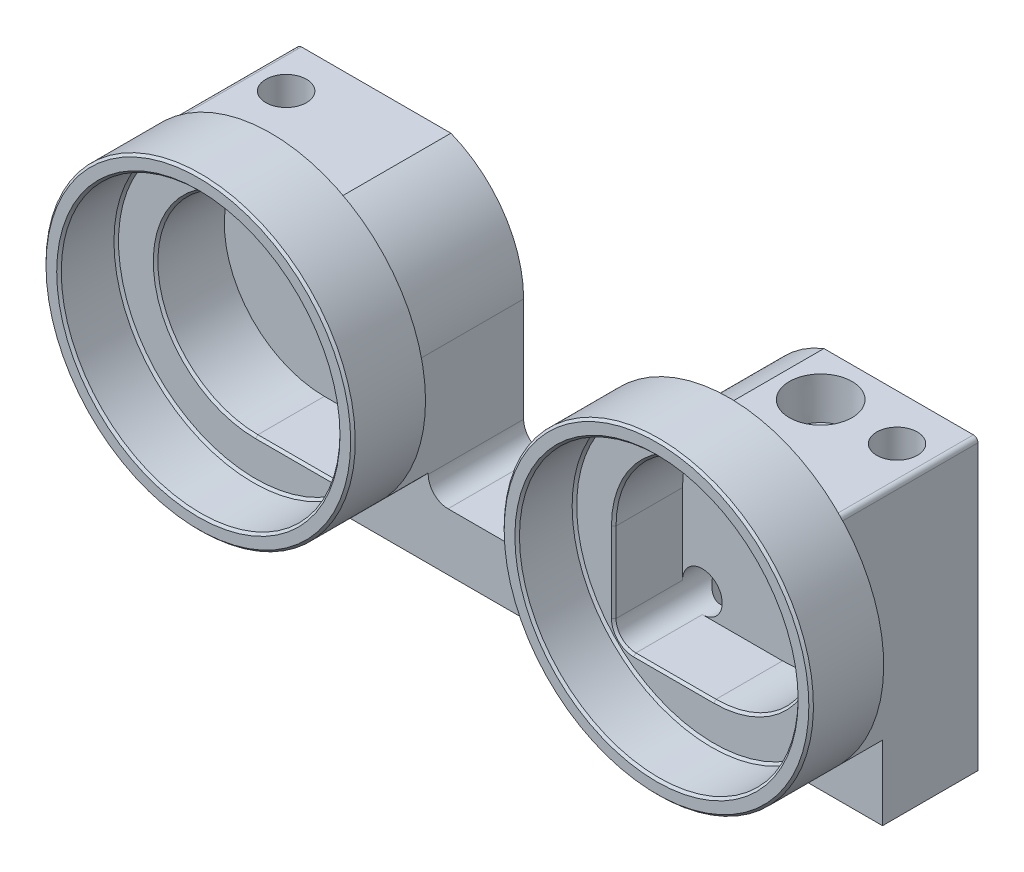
ISO-10303-21;
HEADER;
FILE_DESCRIPTION(('STEP AP214'),'2;1');
FILE_NAME('part.step','',(''),(''),'','','');
FILE_SCHEMA(('AUTOMOTIVE_DESIGN { 1 0 10303 214 1 1 1 1 }'));
ENDSEC;
DATA;
#1=APPLICATION_CONTEXT('core data for automotive mechanical design processes');
#2=APPLICATION_PROTOCOL_DEFINITION('international standard','automotive_design',2000,#1);
#3=PRODUCT_CONTEXT('',#1,'mechanical');
#4=PRODUCT('Part','Part','',(#3));
#5=PRODUCT_RELATED_PRODUCT_CATEGORY('part','',(#4));
#6=PRODUCT_DEFINITION_FORMATION('','',#4);
#7=PRODUCT_DEFINITION_CONTEXT('part definition',#1,'design');
#8=PRODUCT_DEFINITION('design','',#6,#7);
#9=PRODUCT_DEFINITION_SHAPE('','',#8);
#10=(LENGTH_UNIT() NAMED_UNIT(*) SI_UNIT(.MILLI.,.METRE.));
#11=(NAMED_UNIT(*) PLANE_ANGLE_UNIT() SI_UNIT($,.RADIAN.));
#12=(NAMED_UNIT(*) SI_UNIT($,.STERADIAN.) SOLID_ANGLE_UNIT());
#13=UNCERTAINTY_MEASURE_WITH_UNIT(LENGTH_MEASURE(1.E-05),#10,'distance_accuracy_value','');
#14=(GEOMETRIC_REPRESENTATION_CONTEXT(3) GLOBAL_UNCERTAINTY_ASSIGNED_CONTEXT((#13)) GLOBAL_UNIT_ASSIGNED_CONTEXT((#10,
#11,#12)) REPRESENTATION_CONTEXT('',''));
#15=CARTESIAN_POINT('',(0.,0.,0.));
#16=DIRECTION('',(0.,0.,1.));
#17=DIRECTION('',(1.,0.,0.));
#18=AXIS2_PLACEMENT_3D('',#15,#16,#17);
#19=CARTESIAN_POINT('',(94.615,9.525,7.62));
#20=DIRECTION('',(0.,-1.,0.));
#21=DIRECTION('',(0.,0.,-1.));
#22=AXIS2_PLACEMENT_3D('',#19,#20,#21);
#23=CYLINDRICAL_SURFACE('',#22,3.97509999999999);
#24=CARTESIAN_POINT('',(94.615,9.525,7.62));
#25=DIRECTION('',(0.,-1.,0.));
#26=DIRECTION('',(0.,0.,-1.));
#27=AXIS2_PLACEMENT_3D('',#24,#25,#26);
#28=CIRCLE('',#27,3.97509999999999);
#29=CARTESIAN_POINT('',(94.615,9.525,3.64490000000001));
#30=VERTEX_POINT('',#29);
#31=EDGE_CURVE('E1159',#30,#30,#28,.T.);
#32=CARTESIAN_POINT('',(94.615,1.3716,7.62));
#33=DIRECTION('',(0.,-1.,0.));
#34=DIRECTION('',(0.,0.,-1.));
#35=AXIS2_PLACEMENT_3D('',#32,#33,#34);
#36=CIRCLE('',#35,3.97509999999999);
#37=CARTESIAN_POINT('',(94.615,1.3716,3.64490000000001));
#38=VERTEX_POINT('',#37);
#39=EDGE_CURVE('E1142',#38,#38,#36,.F.);
#40=CARTESIAN_POINT('',(94.615,9.525,3.64490000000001));
#41=CARTESIAN_POINT('',(94.615,9.44006875,3.64490000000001));
#42=CARTESIAN_POINT('',(94.615,9.3551375,3.64490000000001));
#43=CARTESIAN_POINT('',(94.615,9.185275,3.64490000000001));
#44=CARTESIAN_POINT('',(94.615,9.10034375,3.64490000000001));
#45=CARTESIAN_POINT('',(94.615,8.93048125,3.64490000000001));
#46=CARTESIAN_POINT('',(94.615,8.84555,3.64490000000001));
#47=CARTESIAN_POINT('',(94.615,8.6756875,3.64490000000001));
#48=CARTESIAN_POINT('',(94.615,8.59075625,3.64490000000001));
#49=CARTESIAN_POINT('',(94.615,8.42089375,3.64490000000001));
#50=CARTESIAN_POINT('',(94.615,8.3359625,3.64490000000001));
#51=CARTESIAN_POINT('',(94.615,8.1661,3.64490000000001));
#52=CARTESIAN_POINT('',(94.615,8.08116875,3.64490000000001));
#53=CARTESIAN_POINT('',(94.615,7.91130625,3.64490000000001));
#54=CARTESIAN_POINT('',(94.615,7.826375,3.64490000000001));
#55=CARTESIAN_POINT('',(94.615,7.6565125,3.64490000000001));
#56=CARTESIAN_POINT('',(94.615,7.57158125,3.64490000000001));
#57=CARTESIAN_POINT('',(94.615,7.40171875,3.64490000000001));
#58=CARTESIAN_POINT('',(94.615,7.3167875,3.64490000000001));
#59=CARTESIAN_POINT('',(94.615,7.146925,3.64490000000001));
#60=CARTESIAN_POINT('',(94.615,7.06199375,3.64490000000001));
#61=CARTESIAN_POINT('',(94.615,6.89213125,3.64490000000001));
#62=CARTESIAN_POINT('',(94.615,6.8072,3.64490000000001));
#63=CARTESIAN_POINT('',(94.615,6.6373375,3.64490000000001));
#64=CARTESIAN_POINT('',(94.615,6.55240625,3.64490000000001));
#65=CARTESIAN_POINT('',(94.615,6.38254375,3.64490000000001));
#66=CARTESIAN_POINT('',(94.615,6.2976125,3.64490000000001));
#67=CARTESIAN_POINT('',(94.615,6.12775,3.64490000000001));
#68=CARTESIAN_POINT('',(94.615,6.04281875,3.64490000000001));
#69=CARTESIAN_POINT('',(94.615,5.87295625,3.64490000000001));
#70=CARTESIAN_POINT('',(94.615,5.788025,3.64490000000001));
#71=CARTESIAN_POINT('',(94.615,5.6181625,3.64490000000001));
#72=CARTESIAN_POINT('',(94.615,5.53323125,3.64490000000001));
#73=CARTESIAN_POINT('',(94.615,5.36336875,3.64490000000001));
#74=CARTESIAN_POINT('',(94.615,5.2784375,3.64490000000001));
#75=CARTESIAN_POINT('',(94.615,5.108575,3.64490000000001));
#76=CARTESIAN_POINT('',(94.615,5.02364375,3.64490000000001));
#77=CARTESIAN_POINT('',(94.615,4.85378125,3.64490000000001));
#78=CARTESIAN_POINT('',(94.615,4.76885,3.64490000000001));
#79=CARTESIAN_POINT('',(94.615,4.5989875,3.64490000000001));
#80=CARTESIAN_POINT('',(94.615,4.51405625,3.64490000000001));
#81=CARTESIAN_POINT('',(94.615,4.34419375,3.64490000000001));
#82=CARTESIAN_POINT('',(94.615,4.2592625,3.64490000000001));
#83=CARTESIAN_POINT('',(94.615,4.0894,3.64490000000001));
#84=CARTESIAN_POINT('',(94.615,4.00446875,3.64490000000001));
#85=CARTESIAN_POINT('',(94.615,3.83460625,3.64490000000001));
#86=CARTESIAN_POINT('',(94.615,3.749675,3.64490000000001));
#87=CARTESIAN_POINT('',(94.615,3.5798125,3.64490000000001));
#88=CARTESIAN_POINT('',(94.615,3.49488125,3.64490000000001));
#89=CARTESIAN_POINT('',(94.615,3.32501875,3.64490000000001));
#90=CARTESIAN_POINT('',(94.615,3.2400875,3.64490000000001));
#91=CARTESIAN_POINT('',(94.615,3.070225,3.64490000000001));
#92=CARTESIAN_POINT('',(94.615,2.98529375,3.64490000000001));
#93=CARTESIAN_POINT('',(94.615,2.81543125,3.64490000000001));
#94=CARTESIAN_POINT('',(94.615,2.7305,3.64490000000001));
#95=CARTESIAN_POINT('',(94.615,2.5606375,3.64490000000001));
#96=CARTESIAN_POINT('',(94.615,2.47570625,3.64490000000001));
#97=CARTESIAN_POINT('',(94.615,2.30584375,3.64490000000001));
#98=CARTESIAN_POINT('',(94.615,2.2209125,3.64490000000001));
#99=CARTESIAN_POINT('',(94.615,2.05105,3.64490000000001));
#100=CARTESIAN_POINT('',(94.615,1.96611875,3.64490000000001));
#101=CARTESIAN_POINT('',(94.615,1.79625625,3.64490000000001));
#102=CARTESIAN_POINT('',(94.615,1.711325,3.64490000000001));
#103=CARTESIAN_POINT('',(94.615,1.5414625,3.64490000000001));
#104=CARTESIAN_POINT('',(94.615,1.45653125,3.64490000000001));
#105=CARTESIAN_POINT('',(94.615,1.3716,3.64490000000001));
#106=B_SPLINE_CURVE_WITH_KNOTS('',3,(#40,#41,#42,#43,#44,#45,#46,#47,#48,#49,#50,#51,#52,#53,
#54,#55,#56,#57,#58,#59,#60,#61,#62,#63,#64,#65,#66,#67,#68,#69,#70,#71,#72,#73,#74,#75,#76,#77,
#78,#79,#80,#81,#82,#83,#84,#85,#86,#87,#88,#89,#90,#91,#92,#93,#94,#95,#96,#97,#98,#99,#100,
#101,#102,#103,#104,#105),.UNSPECIFIED.,.F.,.F.,(4,2,2,2,2,2,2,2,2,2,2,2,2,2,2,2,2,2,2,2,2,2,2,
2,2,2,2,2,2,2,2,2,4),(0.,0.254793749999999,0.509587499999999,0.76438125,1.019175,1.27396875,
1.5287625,1.78355625,2.03835,2.29314375,2.5479375,2.80273125,3.057525,3.31231875,3.5671125,
3.82190625,4.0767,4.33149375,4.5862875,4.84108125,5.095875,5.35066875,5.6054625,5.86025625,
6.11505,6.36984375,6.6246375,6.87943125,7.134225,7.38901875,7.6438125,7.89860625,8.1534),.UNSPECIFIED.);
#107=EDGE_CURVE('BSEAM40',#30,#38,#106,.T.);
#108=ORIENTED_EDGE('',*,*,#31,.F.);
#109=ORIENTED_EDGE('',*,*,#39,.F.);
#110=ORIENTED_EDGE('',*,*,#107,.T.);
#111=ORIENTED_EDGE('',*,*,#107,.F.);
#112=EDGE_LOOP('',(#108,#110,#109,#111));
#113=FACE_BOUND('',#112,.T.);
#114=ADVANCED_FACE('F40',(#113),#23,.F.);
#115=CARTESIAN_POINT('',(45.085,9.525,7.62));
#116=DIRECTION('',(0.,-1.,0.));
#117=DIRECTION('',(0.,0.,-1.));
#118=AXIS2_PLACEMENT_3D('',#115,#116,#117);
#119=CYLINDRICAL_SURFACE('',#118,3.97510000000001);
#120=CARTESIAN_POINT('',(45.085,9.525,7.62));
#121=DIRECTION('',(0.,-1.,0.));
#122=DIRECTION('',(0.,0.,-1.));
#123=AXIS2_PLACEMENT_3D('',#120,#121,#122);
#124=CIRCLE('',#123,3.97510000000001);
#125=CARTESIAN_POINT('',(45.085,9.525,3.64489999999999));
#126=VERTEX_POINT('',#125);
#127=EDGE_CURVE('E1163',#126,#126,#124,.T.);
#128=CARTESIAN_POINT('',(45.085,1.3716,7.62));
#129=DIRECTION('',(0.,-1.,0.));
#130=DIRECTION('',(0.,0.,-1.));
#131=AXIS2_PLACEMENT_3D('',#128,#129,#130);
#132=CIRCLE('',#131,3.97510000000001);
#133=CARTESIAN_POINT('',(45.085,1.3716,3.64489999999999));
#134=VERTEX_POINT('',#133);
#135=EDGE_CURVE('E1148',#134,#134,#132,.F.);
#136=CARTESIAN_POINT('',(45.085,9.525,3.64489999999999));
#137=CARTESIAN_POINT('',(45.085,9.44006875,3.64489999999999));
#138=CARTESIAN_POINT('',(45.085,9.3551375,3.64489999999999));
#139=CARTESIAN_POINT('',(45.085,9.185275,3.64489999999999));
#140=CARTESIAN_POINT('',(45.085,9.10034375,3.64489999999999));
#141=CARTESIAN_POINT('',(45.085,8.93048125,3.64489999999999));
#142=CARTESIAN_POINT('',(45.085,8.84555,3.64489999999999));
#143=CARTESIAN_POINT('',(45.085,8.6756875,3.64489999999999));
#144=CARTESIAN_POINT('',(45.085,8.59075625,3.64489999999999));
#145=CARTESIAN_POINT('',(45.085,8.42089375,3.64489999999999));
#146=CARTESIAN_POINT('',(45.085,8.3359625,3.64489999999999));
#147=CARTESIAN_POINT('',(45.085,8.1661,3.64489999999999));
#148=CARTESIAN_POINT('',(45.085,8.08116875,3.64489999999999));
#149=CARTESIAN_POINT('',(45.085,7.91130625,3.64489999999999));
#150=CARTESIAN_POINT('',(45.085,7.826375,3.64489999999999));
#151=CARTESIAN_POINT('',(45.085,7.6565125,3.64489999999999));
#152=CARTESIAN_POINT('',(45.085,7.57158125,3.64489999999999));
#153=CARTESIAN_POINT('',(45.085,7.40171875,3.64489999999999));
#154=CARTESIAN_POINT('',(45.085,7.3167875,3.64489999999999));
#155=CARTESIAN_POINT('',(45.085,7.146925,3.64489999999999));
#156=CARTESIAN_POINT('',(45.085,7.06199375,3.64489999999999));
#157=CARTESIAN_POINT('',(45.085,6.89213125,3.64489999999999));
#158=CARTESIAN_POINT('',(45.085,6.8072,3.64489999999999));
#159=CARTESIAN_POINT('',(45.085,6.6373375,3.64489999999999));
#160=CARTESIAN_POINT('',(45.085,6.55240625,3.64489999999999));
#161=CARTESIAN_POINT('',(45.085,6.38254375,3.64489999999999));
#162=CARTESIAN_POINT('',(45.085,6.2976125,3.64489999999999));
#163=CARTESIAN_POINT('',(45.085,6.12775,3.64489999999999));
#164=CARTESIAN_POINT('',(45.085,6.04281875,3.64489999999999));
#165=CARTESIAN_POINT('',(45.085,5.87295625,3.64489999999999));
#166=CARTESIAN_POINT('',(45.085,5.788025,3.64489999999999));
#167=CARTESIAN_POINT('',(45.085,5.6181625,3.64489999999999));
#168=CARTESIAN_POINT('',(45.085,5.53323125,3.64489999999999));
#169=CARTESIAN_POINT('',(45.085,5.36336875,3.64489999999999));
#170=CARTESIAN_POINT('',(45.085,5.2784375,3.64489999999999));
#171=CARTESIAN_POINT('',(45.085,5.108575,3.64489999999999));
#172=CARTESIAN_POINT('',(45.085,5.02364375,3.64489999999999));
#173=CARTESIAN_POINT('',(45.085,4.85378125,3.64489999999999));
#174=CARTESIAN_POINT('',(45.085,4.76885,3.64489999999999));
#175=CARTESIAN_POINT('',(45.085,4.5989875,3.64489999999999));
#176=CARTESIAN_POINT('',(45.085,4.51405625,3.64489999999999));
#177=CARTESIAN_POINT('',(45.085,4.34419375,3.64489999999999));
#178=CARTESIAN_POINT('',(45.085,4.2592625,3.64489999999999));
#179=CARTESIAN_POINT('',(45.085,4.0894,3.64489999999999));
#180=CARTESIAN_POINT('',(45.085,4.00446875,3.64489999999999));
#181=CARTESIAN_POINT('',(45.085,3.83460625,3.64489999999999));
#182=CARTESIAN_POINT('',(45.085,3.749675,3.64489999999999));
#183=CARTESIAN_POINT('',(45.085,3.5798125,3.64489999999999));
#184=CARTESIAN_POINT('',(45.085,3.49488125,3.64489999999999));
#185=CARTESIAN_POINT('',(45.085,3.32501875,3.64489999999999));
#186=CARTESIAN_POINT('',(45.085,3.2400875,3.64489999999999));
#187=CARTESIAN_POINT('',(45.085,3.070225,3.64489999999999));
#188=CARTESIAN_POINT('',(45.085,2.98529375,3.64489999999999));
#189=CARTESIAN_POINT('',(45.085,2.81543125,3.64489999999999));
#190=CARTESIAN_POINT('',(45.085,2.7305,3.64489999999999));
#191=CARTESIAN_POINT('',(45.085,2.5606375,3.64489999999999));
#192=CARTESIAN_POINT('',(45.085,2.47570625,3.64489999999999));
#193=CARTESIAN_POINT('',(45.085,2.30584375,3.64489999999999));
#194=CARTESIAN_POINT('',(45.085,2.2209125,3.64489999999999));
#195=CARTESIAN_POINT('',(45.085,2.05105,3.64489999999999));
#196=CARTESIAN_POINT('',(45.085,1.96611875,3.64489999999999));
#197=CARTESIAN_POINT('',(45.085,1.79625625,3.64489999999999));
#198=CARTESIAN_POINT('',(45.085,1.711325,3.64489999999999));
#199=CARTESIAN_POINT('',(45.085,1.5414625,3.64489999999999));
#200=CARTESIAN_POINT('',(45.085,1.45653125,3.64489999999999));
#201=CARTESIAN_POINT('',(45.085,1.3716,3.64489999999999));
#202=B_SPLINE_CURVE_WITH_KNOTS('',3,(#136,#137,#138,#139,#140,#141,#142,#143,#144,#145,#146,
#147,#148,#149,#150,#151,#152,#153,#154,#155,#156,#157,#158,#159,#160,#161,#162,#163,#164,#165,
#166,#167,#168,#169,#170,#171,#172,#173,#174,#175,#176,#177,#178,#179,#180,#181,#182,#183,#184,
#185,#186,#187,#188,#189,#190,#191,#192,#193,#194,#195,#196,#197,#198,#199,#200,#201),
.UNSPECIFIED.,.F.,.F.,(4,2,2,2,2,2,2,2,2,2,2,2,2,2,2,2,2,2,2,2,2,2,2,2,2,2,2,2,2,2,2,2,4),(0.,
0.254793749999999,0.509587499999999,0.76438125,1.019175,1.27396875,1.5287625,1.78355625,2.03835,
2.29314375,2.5479375,2.80273125,3.057525,3.31231875,3.5671125,3.82190625,4.0767,4.33149375,
4.5862875,4.84108125,5.095875,5.35066875,5.6054625,5.86025625,6.11505,6.36984375,6.6246375,
6.87943125,7.134225,7.38901875,7.6438125,7.89860625,8.1534),.UNSPECIFIED.);
#203=EDGE_CURVE('BSEAM377',#126,#134,#202,.T.);
#204=ORIENTED_EDGE('',*,*,#127,.F.);
#205=ORIENTED_EDGE('',*,*,#135,.F.);
#206=ORIENTED_EDGE('',*,*,#203,.T.);
#207=ORIENTED_EDGE('',*,*,#203,.F.);
#208=EDGE_LOOP('',(#204,#206,#205,#207));
#209=FACE_BOUND('',#208,.T.);
#210=ADVANCED_FACE('F377',(#209),#119,.F.);
#211=CARTESIAN_POINT('',(31.75,9.525,7.61999999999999));
#212=DIRECTION('',(0.,-1.,0.));
#213=DIRECTION('',(0.,0.,-1.));
#214=AXIS2_PLACEMENT_3D('',#211,#212,#213);
#215=CYLINDRICAL_SURFACE('',#214,3.97510000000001);
#216=CARTESIAN_POINT('',(31.75,9.525,7.61999999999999));
#217=DIRECTION('',(0.,-1.,0.));
#218=DIRECTION('',(0.,0.,-1.));
#219=AXIS2_PLACEMENT_3D('',#216,#217,#218);
#220=CIRCLE('',#219,3.97510000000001);
#221=CARTESIAN_POINT('',(31.75,9.525,3.64489999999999));
#222=VERTEX_POINT('',#221);
#223=EDGE_CURVE('E1167',#222,#222,#220,.T.);
#224=CARTESIAN_POINT('',(31.75,1.3716,7.61999999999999));
#225=DIRECTION('',(0.,-1.,0.));
#226=DIRECTION('',(0.,0.,-1.));
#227=AXIS2_PLACEMENT_3D('',#224,#225,#226);
#228=CIRCLE('',#227,3.97510000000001);
#229=CARTESIAN_POINT('',(31.75,1.3716,3.64489999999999));
#230=VERTEX_POINT('',#229);
#231=EDGE_CURVE('E1155',#230,#230,#228,.F.);
#232=CARTESIAN_POINT('',(31.75,9.525,3.64489999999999));
#233=CARTESIAN_POINT('',(31.75,9.44006875,3.64489999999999));
#234=CARTESIAN_POINT('',(31.75,9.3551375,3.64489999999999));
#235=CARTESIAN_POINT('',(31.75,9.185275,3.64489999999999));
#236=CARTESIAN_POINT('',(31.75,9.10034375,3.64489999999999));
#237=CARTESIAN_POINT('',(31.75,8.93048125,3.64489999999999));
#238=CARTESIAN_POINT('',(31.75,8.84555,3.64489999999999));
#239=CARTESIAN_POINT('',(31.75,8.6756875,3.64489999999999));
#240=CARTESIAN_POINT('',(31.75,8.59075625,3.64489999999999));
#241=CARTESIAN_POINT('',(31.75,8.42089375,3.64489999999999));
#242=CARTESIAN_POINT('',(31.75,8.3359625,3.64489999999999));
#243=CARTESIAN_POINT('',(31.75,8.1661,3.64489999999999));
#244=CARTESIAN_POINT('',(31.75,8.08116875,3.64489999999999));
#245=CARTESIAN_POINT('',(31.75,7.91130625,3.64489999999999));
#246=CARTESIAN_POINT('',(31.75,7.826375,3.64489999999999));
#247=CARTESIAN_POINT('',(31.75,7.6565125,3.64489999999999));
#248=CARTESIAN_POINT('',(31.75,7.57158125,3.64489999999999));
#249=CARTESIAN_POINT('',(31.75,7.40171875,3.64489999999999));
#250=CARTESIAN_POINT('',(31.75,7.3167875,3.64489999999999));
#251=CARTESIAN_POINT('',(31.75,7.146925,3.64489999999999));
#252=CARTESIAN_POINT('',(31.75,7.06199375,3.64489999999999));
#253=CARTESIAN_POINT('',(31.75,6.89213125,3.64489999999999));
#254=CARTESIAN_POINT('',(31.75,6.8072,3.64489999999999));
#255=CARTESIAN_POINT('',(31.75,6.6373375,3.64489999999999));
#256=CARTESIAN_POINT('',(31.75,6.55240625,3.64489999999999));
#257=CARTESIAN_POINT('',(31.75,6.38254375,3.64489999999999));
#258=CARTESIAN_POINT('',(31.75,6.2976125,3.64489999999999));
#259=CARTESIAN_POINT('',(31.75,6.12775,3.64489999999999));
#260=CARTESIAN_POINT('',(31.75,6.04281875,3.64489999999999));
#261=CARTESIAN_POINT('',(31.75,5.87295625,3.64489999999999));
#262=CARTESIAN_POINT('',(31.75,5.788025,3.64489999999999));
#263=CARTESIAN_POINT('',(31.75,5.6181625,3.64489999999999));
#264=CARTESIAN_POINT('',(31.75,5.53323125,3.64489999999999));
#265=CARTESIAN_POINT('',(31.75,5.36336875,3.64489999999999));
#266=CARTESIAN_POINT('',(31.75,5.2784375,3.64489999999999));
#267=CARTESIAN_POINT('',(31.75,5.108575,3.64489999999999));
#268=CARTESIAN_POINT('',(31.75,5.02364375,3.64489999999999));
#269=CARTESIAN_POINT('',(31.75,4.85378125,3.64489999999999));
#270=CARTESIAN_POINT('',(31.75,4.76885,3.64489999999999));
#271=CARTESIAN_POINT('',(31.75,4.5989875,3.64489999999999));
#272=CARTESIAN_POINT('',(31.75,4.51405625,3.64489999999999));
#273=CARTESIAN_POINT('',(31.75,4.34419375,3.64489999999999));
#274=CARTESIAN_POINT('',(31.75,4.2592625,3.64489999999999));
#275=CARTESIAN_POINT('',(31.75,4.0894,3.64489999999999));
#276=CARTESIAN_POINT('',(31.75,4.00446875,3.64489999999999));
#277=CARTESIAN_POINT('',(31.75,3.83460625,3.64489999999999));
#278=CARTESIAN_POINT('',(31.75,3.749675,3.64489999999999));
#279=CARTESIAN_POINT('',(31.75,3.5798125,3.64489999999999));
#280=CARTESIAN_POINT('',(31.75,3.49488125,3.64489999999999));
#281=CARTESIAN_POINT('',(31.75,3.32501875,3.64489999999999));
#282=CARTESIAN_POINT('',(31.75,3.2400875,3.64489999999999));
#283=CARTESIAN_POINT('',(31.75,3.070225,3.64489999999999));
#284=CARTESIAN_POINT('',(31.75,2.98529375,3.64489999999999));
#285=CARTESIAN_POINT('',(31.75,2.81543125,3.64489999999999));
#286=CARTESIAN_POINT('',(31.75,2.7305,3.64489999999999));
#287=CARTESIAN_POINT('',(31.75,2.5606375,3.64489999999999));
#288=CARTESIAN_POINT('',(31.75,2.47570625,3.64489999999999));
#289=CARTESIAN_POINT('',(31.75,2.30584375,3.64489999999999));
#290=CARTESIAN_POINT('',(31.75,2.2209125,3.64489999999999));
#291=CARTESIAN_POINT('',(31.75,2.05105,3.64489999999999));
#292=CARTESIAN_POINT('',(31.75,1.96611875,3.64489999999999));
#293=CARTESIAN_POINT('',(31.75,1.79625625,3.64489999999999));
#294=CARTESIAN_POINT('',(31.75,1.711325,3.64489999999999));
#295=CARTESIAN_POINT('',(31.75,1.5414625,3.64489999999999));
#296=CARTESIAN_POINT('',(31.75,1.45653125,3.64489999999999));
#297=CARTESIAN_POINT('',(31.75,1.3716,3.64489999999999));
#298=B_SPLINE_CURVE_WITH_KNOTS('',3,(#232,#233,#234,#235,#236,#237,#238,#239,#240,#241,#242,
#243,#244,#245,#246,#247,#248,#249,#250,#251,#252,#253,#254,#255,#256,#257,#258,#259,#260,#261,
#262,#263,#264,#265,#266,#267,#268,#269,#270,#271,#272,#273,#274,#275,#276,#277,#278,#279,#280,
#281,#282,#283,#284,#285,#286,#287,#288,#289,#290,#291,#292,#293,#294,#295,#296,#297),
.UNSPECIFIED.,.F.,.F.,(4,2,2,2,2,2,2,2,2,2,2,2,2,2,2,2,2,2,2,2,2,2,2,2,2,2,2,2,2,2,2,2,4),(0.,
0.254793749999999,0.509587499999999,0.76438125,1.019175,1.27396875,1.5287625,1.78355625,2.03835,
2.29314375,2.5479375,2.80273125,3.057525,3.31231875,3.5671125,3.82190625,4.0767,4.33149375,
4.5862875,4.84108125,5.095875,5.35066875,5.6054625,5.86025625,6.11505,6.36984375,6.6246375,
6.87943125,7.134225,7.38901875,7.6438125,7.89860625,8.1534),.UNSPECIFIED.);
#299=EDGE_CURVE('BSEAM385',#222,#230,#298,.T.);
#300=ORIENTED_EDGE('',*,*,#223,.F.);
#301=ORIENTED_EDGE('',*,*,#231,.F.);
#302=ORIENTED_EDGE('',*,*,#299,.T.);
#303=ORIENTED_EDGE('',*,*,#299,.F.);
#304=EDGE_LOOP('',(#300,#302,#301,#303));
#305=FACE_BOUND('',#304,.T.);
#306=ADVANCED_FACE('F385',(#305),#215,.F.);
#307=CARTESIAN_POINT('',(94.615,19.05,7.62000000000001));
#308=DIRECTION('',(0.,-1.,0.));
#309=DIRECTION('',(0.,0.,-1.));
#310=AXIS2_PLACEMENT_3D('',#307,#308,#309);
#311=CYLINDRICAL_SURFACE('',#310,3.37819999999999);
#312=CARTESIAN_POINT('',(94.615,19.05,7.62000000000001));
#313=DIRECTION('',(0.,-1.,0.));
#314=DIRECTION('',(0.,0.,-1.));
#315=AXIS2_PLACEMENT_3D('',#312,#313,#314);
#316=CIRCLE('',#315,3.37819999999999);
#317=CARTESIAN_POINT('',(92.1729316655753,19.05,9.95421024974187));
#318=VERTEX_POINT('',#317);
#319=CARTESIAN_POINT('',(97.0570683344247,19.05,9.95421024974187));
#320=VERTEX_POINT('',#319);
#321=EDGE_CURVE('E548',#318,#320,#316,.T.);
#322=ORIENTED_EDGE('',*,*,#321,.F.);
#323=CARTESIAN_POINT('',(97.0570683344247,19.05,9.95421024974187));
#324=CARTESIAN_POINT('',(97.095727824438,19.0075175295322,9.91376224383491));
#325=CARTESIAN_POINT('',(97.1330046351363,18.964335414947,9.87275317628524));
#326=CARTESIAN_POINT('',(97.2048468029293,18.8766733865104,9.78977942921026));
#327=CARTESIAN_POINT('',(97.2394126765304,18.8321937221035,9.7478149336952));
#328=CARTESIAN_POINT('',(97.3391284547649,18.6969596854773,9.62073686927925));
#329=CARTESIAN_POINT('',(97.4003169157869,18.6043876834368,9.5344171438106));
#330=CARTESIAN_POINT('',(97.5122850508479,18.415259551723,9.36030253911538));
#331=CARTESIAN_POINT('',(97.5631016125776,18.3187190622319,9.272514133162));
#332=CARTESIAN_POINT('',(97.6549332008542,18.121286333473,9.09676374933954));
#333=CARTESIAN_POINT('',(97.695952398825,18.0203959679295,9.00880186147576));
#334=CARTESIAN_POINT('',(97.757246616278,17.8449787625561,8.86208302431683));
#335=CARTESIAN_POINT('',(97.7800230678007,17.7718752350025,8.80265612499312));
#336=CARTESIAN_POINT('',(97.8209738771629,17.6218639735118,8.68664126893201));
#337=CARTESIAN_POINT('',(97.8391391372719,17.5449490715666,8.63005909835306));
#338=CARTESIAN_POINT('',(97.866467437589,17.4061129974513,8.53754558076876));
#339=CARTESIAN_POINT('',(97.8767436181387,17.3454612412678,8.50005891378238));
#340=CARTESIAN_POINT('',(97.894230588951,17.2197434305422,8.43245327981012));
#341=CARTESIAN_POINT('',(97.9014531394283,17.1546954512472,8.40230624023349));
#342=CARTESIAN_POINT('',(97.9099965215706,17.0462723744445,8.36528471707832));
#343=CARTESIAN_POINT('',(97.9125222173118,17.0045875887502,8.3539234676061));
#344=CARTESIAN_POINT('',(97.9159770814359,16.9198990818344,8.33822939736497));
#345=CARTESIAN_POINT('',(97.9169111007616,16.8768997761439,8.33387522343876));
#346=CARTESIAN_POINT('',(97.9170769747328,16.7906509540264,8.33310847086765));
#347=CARTESIAN_POINT('',(97.9163020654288,16.7474011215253,8.33672744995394));
#348=CARTESIAN_POINT('',(97.9131347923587,16.6621417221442,8.35115862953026));
#349=CARTESIAN_POINT('',(97.9107380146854,16.6201358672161,8.36199045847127));
#350=CARTESIAN_POINT('',(97.902483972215,16.5106791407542,8.39794304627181));
#351=CARTESIAN_POINT('',(97.8953849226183,16.4449374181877,8.42777559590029));
#352=CARTESIAN_POINT('',(97.8780713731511,16.3178765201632,8.49511501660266));
#353=CARTESIAN_POINT('',(97.8678405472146,16.2565826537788,8.53266175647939));
#354=CARTESIAN_POINT('',(97.8460854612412,16.1447892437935,8.60672476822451));
#355=CARTESIAN_POINT('',(97.8348899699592,16.0939068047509,8.64276743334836));
#356=CARTESIAN_POINT('',(97.8104768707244,15.9939670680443,8.71666863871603));
#357=CARTESIAN_POINT('',(97.7972583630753,15.9449105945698,8.75452798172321));
#358=CARTESIAN_POINT('',(97.7545898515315,15.7996886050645,8.8697613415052));
#359=CARTESIAN_POINT('',(97.7221569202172,15.705620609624,8.9486841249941));
#360=CARTESIAN_POINT('',(97.649269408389,15.5212734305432,9.10766525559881));
#361=CARTESIAN_POINT('',(97.6087961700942,15.431003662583,9.18772583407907));
#362=CARTESIAN_POINT('',(97.5197239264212,15.2541012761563,9.34717957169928));
#363=CARTESIAN_POINT('',(97.4711318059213,15.1674656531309,9.42657323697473));
#364=CARTESIAN_POINT('',(97.3616563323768,14.9915891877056,9.58937076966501));
#365=CARTESIAN_POINT('',(97.300134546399,14.9026200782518,9.67264411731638));
#366=CARTESIAN_POINT('',(97.1670465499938,14.7293524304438,9.83594759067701));
#367=CARTESIAN_POINT('',(97.0954757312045,14.6450560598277,9.91597620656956));
#368=CARTESIAN_POINT('',(96.8655526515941,14.4009928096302,10.1487447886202));
#369=CARTESIAN_POINT('',(96.6913869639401,14.2490518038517,10.2951053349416));
#370=CARTESIAN_POINT('',(96.3779552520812,14.0318277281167,10.5052064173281));
#371=CARTESIAN_POINT('',(96.2523010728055,13.9560942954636,10.57867385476));
#372=CARTESIAN_POINT('',(95.9857286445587,13.8197413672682,10.7111772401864));
#373=CARTESIAN_POINT('',(95.8448166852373,13.7591156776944,10.7702191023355));
#374=CARTESIAN_POINT('',(95.6231532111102,13.6821749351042,10.8452239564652));
#375=CARTESIAN_POINT('',(95.5470888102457,13.6587689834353,10.8680559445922));
#376=CARTESIAN_POINT('',(95.3922026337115,13.617270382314,10.9085535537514));
#377=CARTESIAN_POINT('',(95.31338243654,13.5991747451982,10.9262220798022));
#378=CARTESIAN_POINT('',(95.1536580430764,13.5687190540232,10.9559667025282));
#379=CARTESIAN_POINT('',(95.0727554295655,13.5563547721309,10.9680469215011));
#380=CARTESIAN_POINT('',(94.9096315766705,13.5376445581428,10.9863297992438));
#381=CARTESIAN_POINT('',(94.8274105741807,13.5312975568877,10.9925335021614));
#382=CARTESIAN_POINT('',(94.6040404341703,13.52252240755,11.0011100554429));
#383=CARTESIAN_POINT('',(94.4623431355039,13.5260410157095,10.9976700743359));
#384=CARTESIAN_POINT('',(94.1821722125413,13.55096356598,10.9733141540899));
#385=CARTESIAN_POINT('',(94.0436985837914,13.5723674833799,10.9523982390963));
#386=CARTESIAN_POINT('',(93.7799174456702,13.6301184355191,10.8960102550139));
#387=CARTESIAN_POINT('',(93.6542976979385,13.6657453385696,10.8612398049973));
#388=CARTESIAN_POINT('',(93.4118031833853,13.7498350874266,10.7792665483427));
#389=CARTESIAN_POINT('',(93.2949306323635,13.7983011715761,10.7320606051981));
#390=CARTESIAN_POINT('',(93.0226818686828,13.9293297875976,10.6046432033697));
#391=CARTESIAN_POINT('',(92.872578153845,14.0175651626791,10.518995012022));
#392=CARTESIAN_POINT('',(92.5940039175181,14.2106952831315,10.3322104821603));
#393=CARTESIAN_POINT('',(92.4655968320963,14.315637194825,10.2310303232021));
#394=CARTESIAN_POINT('',(92.2670236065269,14.5031509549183,10.0512875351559));
#395=CARTESIAN_POINT('',(92.1911775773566,14.5825033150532,9.97550199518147));
#396=CARTESIAN_POINT('',(92.0493094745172,14.746115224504,9.82012106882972));
#397=CARTESIAN_POINT('',(91.9832879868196,14.8303750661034,9.7405254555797));
#398=CARTESIAN_POINT('',(91.8608391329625,15.0029513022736,9.57885125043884));
#399=CARTESIAN_POINT('',(91.804394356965,15.0912599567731,9.49677749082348));
#400=CARTESIAN_POINT('',(91.7006272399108,15.2717135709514,9.33119732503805));
#401=CARTESIAN_POINT('',(91.6533008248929,15.3638567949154,9.247691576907));
#402=CARTESIAN_POINT('',(91.5735146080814,15.5389070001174,9.09245177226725));
#403=CARTESIAN_POINT('',(91.5398999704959,15.6212894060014,9.02071456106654));
#404=CARTESIAN_POINT('',(91.4789594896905,15.7899304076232,8.87835933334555));
#405=CARTESIAN_POINT('',(91.4516584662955,15.8762027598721,8.80774671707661));
#406=CARTESIAN_POINT('',(91.4154709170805,16.0099598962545,8.70471463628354));
#407=CARTESIAN_POINT('',(91.404152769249,16.0555374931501,8.67066975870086));
#408=CARTESIAN_POINT('',(91.3832362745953,16.1484007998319,8.60444818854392));
#409=CARTESIAN_POINT('',(91.3736371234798,16.195685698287,8.57227062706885));
#410=CARTESIAN_POINT('',(91.3562994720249,16.2922702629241,8.51112752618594));
#411=CARTESIAN_POINT('',(91.3485508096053,16.3415571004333,8.48214493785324));
#412=CARTESIAN_POINT('',(91.33506342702,16.4430122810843,8.42931383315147));
#413=CARTESIAN_POINT('',(91.3293191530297,16.4951721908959,8.40545120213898));
#414=CARTESIAN_POINT('',(91.3207750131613,16.5961751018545,8.36875372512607));
#415=CARTESIAN_POINT('',(91.3176950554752,16.6446060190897,8.35490724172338));
#416=CARTESIAN_POINT('',(91.3137154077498,16.7431253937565,8.33683547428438));
#417=CARTESIAN_POINT('',(91.3128009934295,16.793200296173,8.33254522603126));
#418=CARTESIAN_POINT('',(91.3132738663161,16.8932447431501,8.33472968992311));
#419=CARTESIAN_POINT('',(91.3146686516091,16.9432134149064,8.34123947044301));
#420=CARTESIAN_POINT('',(91.3195537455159,17.0412318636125,8.36322582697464));
#421=CARTESIAN_POINT('',(91.323058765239,17.089265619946,8.37876532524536));
#422=CARTESIAN_POINT('',(91.3321469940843,17.186145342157,8.41719837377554));
#423=CARTESIAN_POINT('',(91.3378652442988,17.2347865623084,8.44055248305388));
#424=CARTESIAN_POINT('',(91.3510443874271,17.3295828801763,8.49151069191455));
#425=CARTESIAN_POINT('',(91.3585087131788,17.3757328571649,8.51912312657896));
#426=CARTESIAN_POINT('',(91.3833521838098,17.5117687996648,8.60604812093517));
#427=CARTESIAN_POINT('',(91.4031278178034,17.5987206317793,8.66919581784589));
#428=CARTESIAN_POINT('',(91.4565263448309,17.7976694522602,8.82208186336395));
#429=CARTESIAN_POINT('',(91.4925732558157,17.9077542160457,8.91337834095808));
#430=CARTESIAN_POINT('',(91.5754109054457,18.1226145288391,9.09763265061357));
#431=CARTESIAN_POINT('',(91.6222165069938,18.2273824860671,9.19059261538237));
#432=CARTESIAN_POINT('',(91.7265767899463,18.4316521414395,9.37511765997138));
#433=CARTESIAN_POINT('',(91.7840780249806,18.5311769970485,9.46668732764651));
#434=CARTESIAN_POINT('',(91.9103478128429,18.7252442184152,9.64711696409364));
#435=CARTESIAN_POINT('',(91.9791026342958,18.8197924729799,9.73598008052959));
#436=CARTESIAN_POINT('',(92.0728090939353,18.9349590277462,9.84494018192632));
#437=CARTESIAN_POINT('',(92.0922894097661,18.9582423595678,9.86700739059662));
#438=CARTESIAN_POINT('',(92.1320253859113,19.0044172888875,9.9108397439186));
#439=CARTESIAN_POINT('',(92.1522809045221,19.0273089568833,9.93260494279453));
#440=CARTESIAN_POINT('',(92.1729316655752,19.05,9.95421024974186));
#441=B_SPLINE_CURVE_WITH_KNOTS('',3,(#323,#324,#325,#326,#327,#328,#329,#330,#331,#332,#333,
#334,#335,#336,#337,#338,#339,#340,#341,#342,#343,#344,#345,#346,#347,#348,#349,#350,#351,#352,
#353,#354,#355,#356,#357,#358,#359,#360,#361,#362,#363,#364,#365,#366,#367,#368,#369,#370,#371,
#372,#373,#374,#375,#376,#377,#378,#379,#380,#381,#382,#383,#384,#385,#386,#387,#388,#389,#390,
#391,#392,#393,#394,#395,#396,#397,#398,#399,#400,#401,#402,#403,#404,#405,#406,#407,#408,#409,
#410,#411,#412,#413,#414,#415,#416,#417,#418,#419,#420,#421,#422,#423,#424,#425,#426,#427,#428,
#429,#430,#431,#432,#433,#434,#435,#436,#437,#438,#439,#440),.UNSPECIFIED.,.F.,.F.,(4,2,2,2,2,2,
2,2,2,2,2,2,2,2,2,2,2,2,2,2,2,2,2,2,2,2,2,2,2,2,2,2,2,2,2,2,2,2,2,2,2,2,2,2,2,2,2,2,2,2,2,2,2,2,
2,2,2,2,4),(0.,0.210711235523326,0.421382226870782,0.842612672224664,1.26231785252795,
1.68184401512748,1.97248022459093,2.26368546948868,2.47954757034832,2.69457059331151,
2.82392697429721,2.95288840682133,3.08236118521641,3.21218774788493,3.42857904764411,
3.64611818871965,3.83605839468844,4.02608331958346,4.40669078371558,4.78819199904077,
5.16937132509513,5.57838557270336,5.98758800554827,6.80155510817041,7.29224400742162,
7.78273139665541,8.03080153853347,8.27873184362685,8.52647896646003,8.77418206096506,
9.19708010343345,9.6199775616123,10.0237356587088,10.4275956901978,11.0065347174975,
11.5871381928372,11.9868160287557,12.3865176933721,12.7854847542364,13.1842731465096,
13.5269519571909,13.8709558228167,14.0449130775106,14.2187887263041,14.3916863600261,
14.5641010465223,14.7147577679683,14.8643871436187,15.0145033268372,15.1656783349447,
15.3280838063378,15.4908112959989,15.8179917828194,16.2599264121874,16.7024752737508,
17.1428693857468,17.5827300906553,17.6953147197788,17.8078788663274),.UNSPECIFIED.);
#442=EDGE_CURVE('E725',#320,#318,#441,.T.);
#443=ORIENTED_EDGE('',*,*,#442,.F.);
#444=EDGE_LOOP('',(#322,#443));
#445=FACE_BOUND('',#444,.T.);
#446=CARTESIAN_POINT('',(94.615,9.525,7.62000000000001));
#447=DIRECTION('',(0.,-1.,0.));
#448=DIRECTION('',(0.,0.,-1.));
#449=AXIS2_PLACEMENT_3D('',#446,#447,#448);
#450=CIRCLE('',#449,3.37819999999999);
#451=CARTESIAN_POINT('',(94.615,9.525,4.24180000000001));
#452=VERTEX_POINT('',#451);
#453=EDGE_CURVE('E1162',#452,#452,#450,.F.);
#454=ORIENTED_EDGE('',*,*,#453,.F.);
#455=EDGE_LOOP('',(#454));
#456=FACE_BOUND('',#455,.T.);
#457=ADVANCED_FACE('F393',(#445,#456),#311,.F.);
#458=CARTESIAN_POINT('',(45.085,19.05,7.62));
#459=DIRECTION('',(0.,-1.,0.));
#460=DIRECTION('',(0.,0.,-1.));
#461=AXIS2_PLACEMENT_3D('',#458,#459,#460);
#462=CYLINDRICAL_SURFACE('',#461,3.3782);
#463=CARTESIAN_POINT('',(45.085,19.05,7.62));
#464=DIRECTION('',(0.,-1.,0.));
#465=DIRECTION('',(0.,0.,-1.));
#466=AXIS2_PLACEMENT_3D('',#463,#464,#465);
#467=CIRCLE('',#466,3.3782);
#468=CARTESIAN_POINT('',(42.6429316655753,19.05,9.95421024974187));
#469=VERTEX_POINT('',#468);
#470=CARTESIAN_POINT('',(47.5270683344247,19.05,9.95421024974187));
#471=VERTEX_POINT('',#470);
#472=EDGE_CURVE('E555',#469,#471,#467,.T.);
#473=ORIENTED_EDGE('',*,*,#472,.F.);
#474=CARTESIAN_POINT('',(47.5270683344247,19.05,9.95421024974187));
#475=CARTESIAN_POINT('',(47.565727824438,19.0075175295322,9.91376224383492));
#476=CARTESIAN_POINT('',(47.6030046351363,18.964335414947,9.87275317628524));
#477=CARTESIAN_POINT('',(47.6748468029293,18.8766733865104,9.78977942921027));
#478=CARTESIAN_POINT('',(47.7094126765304,18.8321937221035,9.7478149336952));
#479=CARTESIAN_POINT('',(47.8091284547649,18.6969596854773,9.62073686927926));
#480=CARTESIAN_POINT('',(47.8703169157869,18.6043876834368,9.53441714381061));
#481=CARTESIAN_POINT('',(47.9822850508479,18.415259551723,9.36030253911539));
#482=CARTESIAN_POINT('',(48.0331016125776,18.3187190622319,9.272514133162));
#483=CARTESIAN_POINT('',(48.1249332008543,18.121286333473,9.09676374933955));
#484=CARTESIAN_POINT('',(48.165952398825,18.0203959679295,9.00880186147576));
#485=CARTESIAN_POINT('',(48.227246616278,17.8449787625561,8.86208302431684));
#486=CARTESIAN_POINT('',(48.2500230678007,17.7718752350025,8.80265612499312));
#487=CARTESIAN_POINT('',(48.2909738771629,17.6218639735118,8.68664126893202));
#488=CARTESIAN_POINT('',(48.3091391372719,17.5449490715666,8.63005909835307));
#489=CARTESIAN_POINT('',(48.336467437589,17.4061129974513,8.53754558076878));
#490=CARTESIAN_POINT('',(48.3467436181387,17.3454612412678,8.50005891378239));
#491=CARTESIAN_POINT('',(48.364230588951,17.2197434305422,8.43245327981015));
#492=CARTESIAN_POINT('',(48.3714531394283,17.1546954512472,8.40230624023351));
#493=CARTESIAN_POINT('',(48.3799965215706,17.0462723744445,8.36528471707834));
#494=CARTESIAN_POINT('',(48.3825222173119,17.0045875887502,8.35392346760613));
#495=CARTESIAN_POINT('',(48.3859770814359,16.9198990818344,8.338229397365));
#496=CARTESIAN_POINT('',(48.3869111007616,16.8768997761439,8.33387522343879));
#497=CARTESIAN_POINT('',(48.3870769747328,16.7906509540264,8.33310847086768));
#498=CARTESIAN_POINT('',(48.3863020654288,16.7474011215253,8.33672744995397));
#499=CARTESIAN_POINT('',(48.3831347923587,16.6621417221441,8.35115862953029));
#500=CARTESIAN_POINT('',(48.3807380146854,16.6201358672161,8.3619904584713));
#501=CARTESIAN_POINT('',(48.372483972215,16.5106791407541,8.39794304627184));
#502=CARTESIAN_POINT('',(48.3653849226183,16.4449374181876,8.42777559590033));
#503=CARTESIAN_POINT('',(48.3480713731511,16.3178765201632,8.49511501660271));
#504=CARTESIAN_POINT('',(48.3378405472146,16.2565826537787,8.53266175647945));
#505=CARTESIAN_POINT('',(48.3160854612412,16.1447892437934,8.60672476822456));
#506=CARTESIAN_POINT('',(48.3048899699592,16.0939068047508,8.64276743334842));
#507=CARTESIAN_POINT('',(48.2804768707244,15.9939670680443,8.71666863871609));
#508=CARTESIAN_POINT('',(48.2672583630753,15.9449105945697,8.75452798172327));
#509=CARTESIAN_POINT('',(48.2245898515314,15.7996886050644,8.86976134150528));
#510=CARTESIAN_POINT('',(48.1921569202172,15.7056206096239,8.94868412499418));
#511=CARTESIAN_POINT('',(48.119269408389,15.5212734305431,9.10766525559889));
#512=CARTESIAN_POINT('',(48.0787961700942,15.4310036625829,9.18772583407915));
#513=CARTESIAN_POINT('',(47.9897239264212,15.2541012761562,9.34717957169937));
#514=CARTESIAN_POINT('',(47.9411318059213,15.1674656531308,9.42657323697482));
#515=CARTESIAN_POINT('',(47.8316563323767,14.9915891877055,9.5893707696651));
#516=CARTESIAN_POINT('',(47.7701345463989,14.9026200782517,9.67264411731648));
#517=CARTESIAN_POINT('',(47.6370465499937,14.7293524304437,9.83594759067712));
#518=CARTESIAN_POINT('',(47.5654757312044,14.6450560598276,9.91597620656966));
#519=CARTESIAN_POINT('',(47.335552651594,14.4009928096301,10.1487447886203));
#520=CARTESIAN_POINT('',(47.1613869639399,14.2490518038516,10.2951053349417));
#521=CARTESIAN_POINT('',(46.847955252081,14.0318277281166,10.5052064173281));
#522=CARTESIAN_POINT('',(46.7223010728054,13.9560942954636,10.5786738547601));
#523=CARTESIAN_POINT('',(46.4557286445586,13.8197413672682,10.7111772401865));
#524=CARTESIAN_POINT('',(46.3148166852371,13.7591156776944,10.7702191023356));
#525=CARTESIAN_POINT('',(46.0931532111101,13.6821749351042,10.8452239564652));
#526=CARTESIAN_POINT('',(46.0170888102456,13.6587689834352,10.8680559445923));
#527=CARTESIAN_POINT('',(45.8622026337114,13.617270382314,10.9085535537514));
#528=CARTESIAN_POINT('',(45.7833824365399,13.5991747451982,10.9262220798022));
#529=CARTESIAN_POINT('',(45.6236580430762,13.5687190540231,10.9559667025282));
#530=CARTESIAN_POINT('',(45.5427554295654,13.5563547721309,10.9680469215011));
#531=CARTESIAN_POINT('',(45.3796315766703,13.5376445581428,10.9863297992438));
#532=CARTESIAN_POINT('',(45.2974105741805,13.5312975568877,10.9925335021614));
#533=CARTESIAN_POINT('',(45.0740404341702,13.52252240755,11.0011100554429));
#534=CARTESIAN_POINT('',(44.9323431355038,13.5260410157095,10.9976700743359));
#535=CARTESIAN_POINT('',(44.6521722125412,13.55096356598,10.9733141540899));
#536=CARTESIAN_POINT('',(44.5136985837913,13.5723674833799,10.9523982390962));
#537=CARTESIAN_POINT('',(44.2499174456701,13.6301184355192,10.8960102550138));
#538=CARTESIAN_POINT('',(44.1242976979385,13.6657453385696,10.8612398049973));
#539=CARTESIAN_POINT('',(43.8818031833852,13.7498350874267,10.7792665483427));
#540=CARTESIAN_POINT('',(43.7649306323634,13.7983011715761,10.7320606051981));
#541=CARTESIAN_POINT('',(43.4926818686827,13.9293297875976,10.6046432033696));
#542=CARTESIAN_POINT('',(43.342578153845,14.0175651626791,10.518995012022));
#543=CARTESIAN_POINT('',(43.0640039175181,14.2106952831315,10.3322104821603));
#544=CARTESIAN_POINT('',(42.9355968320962,14.3156371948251,10.2310303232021));
#545=CARTESIAN_POINT('',(42.7370236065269,14.5031509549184,10.0512875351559));
#546=CARTESIAN_POINT('',(42.6611775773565,14.5825033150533,9.97550199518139));
#547=CARTESIAN_POINT('',(42.5193094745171,14.7461152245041,9.82012106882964));
#548=CARTESIAN_POINT('',(42.4532879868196,14.8303750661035,9.74052545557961));
#549=CARTESIAN_POINT('',(42.3308391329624,15.0029513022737,9.57885125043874));
#550=CARTESIAN_POINT('',(42.2743943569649,15.0912599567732,9.49677749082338));
#551=CARTESIAN_POINT('',(42.1706272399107,15.2717135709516,9.33119732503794));
#552=CARTESIAN_POINT('',(42.1233008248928,15.3638567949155,9.24769157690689));
#553=CARTESIAN_POINT('',(42.0435146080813,15.5389070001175,9.09245177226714));
#554=CARTESIAN_POINT('',(42.0098999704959,15.6212894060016,9.02071456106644));
#555=CARTESIAN_POINT('',(41.9489594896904,15.7899304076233,8.87835933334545));
#556=CARTESIAN_POINT('',(41.9216584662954,15.8762027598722,8.80774671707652));
#557=CARTESIAN_POINT('',(41.8854709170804,16.0099598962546,8.70471463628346));
#558=CARTESIAN_POINT('',(41.874152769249,16.0555374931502,8.67066975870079));
#559=CARTESIAN_POINT('',(41.8532362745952,16.148400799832,8.60444818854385));
#560=CARTESIAN_POINT('',(41.8436371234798,16.1956856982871,8.57227062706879));
#561=CARTESIAN_POINT('',(41.8262994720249,16.2922702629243,8.51112752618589));
#562=CARTESIAN_POINT('',(41.8185508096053,16.3415571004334,8.48214493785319));
#563=CARTESIAN_POINT('',(41.80506342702,16.4430122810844,8.42931383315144));
#564=CARTESIAN_POINT('',(41.7993191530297,16.495172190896,8.40545120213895));
#565=CARTESIAN_POINT('',(41.7907750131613,16.5961751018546,8.36875372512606));
#566=CARTESIAN_POINT('',(41.7876950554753,16.6446060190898,8.35490724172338));
#567=CARTESIAN_POINT('',(41.7837154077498,16.7431253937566,8.3368354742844));
#568=CARTESIAN_POINT('',(41.7828009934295,16.7932002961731,8.33254522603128));
#569=CARTESIAN_POINT('',(41.7832738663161,16.8932447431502,8.33472968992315));
#570=CARTESIAN_POINT('',(41.7846686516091,16.9432134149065,8.34123947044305));
#571=CARTESIAN_POINT('',(41.7895537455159,17.0412318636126,8.36322582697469));
#572=CARTESIAN_POINT('',(41.793058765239,17.089265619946,8.3787653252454));
#573=CARTESIAN_POINT('',(41.8021469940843,17.186145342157,8.41719837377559));
#574=CARTESIAN_POINT('',(41.8078652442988,17.2347865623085,8.44055248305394));
#575=CARTESIAN_POINT('',(41.8210443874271,17.3295828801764,8.49151069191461));
#576=CARTESIAN_POINT('',(41.8285087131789,17.375732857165,8.51912312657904));
#577=CARTESIAN_POINT('',(41.8533521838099,17.5117687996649,8.60604812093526));
#578=CARTESIAN_POINT('',(41.8731278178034,17.5987206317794,8.669195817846));
#579=CARTESIAN_POINT('',(41.9265263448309,17.7976694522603,8.82208186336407));
#580=CARTESIAN_POINT('',(41.9625732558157,17.9077542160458,8.91337834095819));
#581=CARTESIAN_POINT('',(42.0454109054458,18.1226145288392,9.09763265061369));
#582=CARTESIAN_POINT('',(42.0922165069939,18.2273824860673,9.19059261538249));
#583=CARTESIAN_POINT('',(42.1965767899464,18.4316521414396,9.3751176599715));
#584=CARTESIAN_POINT('',(42.2540780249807,18.5311769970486,9.46668732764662));
#585=CARTESIAN_POINT('',(42.380347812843,18.7252442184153,9.64711696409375));
#586=CARTESIAN_POINT('',(42.4491026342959,18.81979247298,9.73598008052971));
#587=CARTESIAN_POINT('',(42.5428090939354,18.9349590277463,9.84494018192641));
#588=CARTESIAN_POINT('',(42.5622894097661,18.9582423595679,9.8670073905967));
#589=CARTESIAN_POINT('',(42.6020253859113,19.0044172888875,9.91083974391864));
#590=CARTESIAN_POINT('',(42.6222809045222,19.0273089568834,9.93260494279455));
#591=CARTESIAN_POINT('',(42.6429316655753,19.05,9.95421024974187));
#592=B_SPLINE_CURVE_WITH_KNOTS('',3,(#474,#475,#476,#477,#478,#479,#480,#481,#482,#483,#484,
#485,#486,#487,#488,#489,#490,#491,#492,#493,#494,#495,#496,#497,#498,#499,#500,#501,#502,#503,
#504,#505,#506,#507,#508,#509,#510,#511,#512,#513,#514,#515,#516,#517,#518,#519,#520,#521,#522,
#523,#524,#525,#526,#527,#528,#529,#530,#531,#532,#533,#534,#535,#536,#537,#538,#539,#540,#541,
#542,#543,#544,#545,#546,#547,#548,#549,#550,#551,#552,#553,#554,#555,#556,#557,#558,#559,#560,
#561,#562,#563,#564,#565,#566,#567,#568,#569,#570,#571,#572,#573,#574,#575,#576,#577,#578,#579,
#580,#581,#582,#583,#584,#585,#586,#587,#588,#589,#590,#591),.UNSPECIFIED.,.F.,.F.,(4,2,2,2,2,2,
2,2,2,2,2,2,2,2,2,2,2,2,2,2,2,2,2,2,2,2,2,2,2,2,2,2,2,2,2,2,2,2,2,2,2,2,2,2,2,2,2,2,2,2,2,2,2,2,
2,2,2,2,4),(0.,0.210711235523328,0.421382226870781,0.842612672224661,1.26231785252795,
1.68184401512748,1.97248022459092,2.26368546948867,2.4795475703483,2.69457059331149,
2.82392697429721,2.95288840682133,3.08236118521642,3.21218774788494,3.42857904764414,
3.6461181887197,3.83605839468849,4.02608331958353,4.40669078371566,4.78819199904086,
5.16937132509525,5.5783855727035,5.98758800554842,6.80155510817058,7.29224400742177,
7.78273139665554,8.03080153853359,8.27873184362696,8.52647896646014,8.77418206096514,
9.19708010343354,9.61997756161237,10.0237356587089,10.4275956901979,11.0065347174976,
11.5871381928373,11.9868160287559,12.3865176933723,12.7854847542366,13.1842731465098,
13.526951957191,13.8709558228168,14.0449130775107,14.2187887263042,14.3916863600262,
14.5641010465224,14.7147577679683,14.8643871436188,15.0145033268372,15.1656783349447,
15.3280838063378,15.490811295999,15.8179917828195,16.2599264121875,16.7024752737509,
17.142869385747,17.5827300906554,17.6953147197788,17.8078788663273),.UNSPECIFIED.);
#593=EDGE_CURVE('E699',#471,#469,#592,.T.);
#594=ORIENTED_EDGE('',*,*,#593,.F.);
#595=EDGE_LOOP('',(#473,#594));
#596=FACE_BOUND('',#595,.T.);
#597=CARTESIAN_POINT('',(45.085,9.525,7.62));
#598=DIRECTION('',(0.,-1.,0.));
#599=DIRECTION('',(0.,0.,-1.));
#600=AXIS2_PLACEMENT_3D('',#597,#598,#599);
#601=CIRCLE('',#600,3.3782);
#602=CARTESIAN_POINT('',(45.085,9.525,4.2418));
#603=VERTEX_POINT('',#602);
#604=EDGE_CURVE('E1166',#603,#603,#601,.F.);
#605=ORIENTED_EDGE('',*,*,#604,.F.);
#606=EDGE_LOOP('',(#605));
#607=FACE_BOUND('',#606,.T.);
#608=ADVANCED_FACE('F590',(#596,#607),#462,.F.);
#609=CARTESIAN_POINT('',(31.75,34.925,7.61999999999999));
#610=DIRECTION('',(0.,-1.,0.));
#611=DIRECTION('',(0.,0.,-1.));
#612=AXIS2_PLACEMENT_3D('',#609,#610,#611);
#613=CYLINDRICAL_SURFACE('',#612,3.3782);
#614=DIRECTION('',(0.,-1.,0.));
#615=VECTOR('',#614,1.);
#616=CARTESIAN_POINT('',(28.3718,34.925,7.62));
#617=LINE('',#616,#615);
#618=CARTESIAN_POINT('',(28.3718,33.5194585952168,7.62));
#619=VERTEX_POINT('',#618);
#620=CARTESIAN_POINT('',(28.3718,26.8055414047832,7.62));
#621=VERTEX_POINT('',#620);
#622=EDGE_CURVE('E694',#619,#621,#617,.T.);
#623=ORIENTED_EDGE('',*,*,#622,.T.);
#624=CARTESIAN_POINT('',(35.1282,26.8055414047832,7.62));
#625=CARTESIAN_POINT('',(35.1282236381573,26.8055952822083,7.7013525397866));
#626=CARTESIAN_POINT('',(35.1252624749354,26.8025855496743,7.78266996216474));
#627=CARTESIAN_POINT('',(35.113562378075,26.7908570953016,7.94434207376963));
#628=CARTESIAN_POINT('',(35.1048330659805,26.7821478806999,8.0246981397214));
#629=CARTESIAN_POINT('',(35.0819173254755,26.7595642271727,8.18293334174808));
#630=CARTESIAN_POINT('',(35.0677935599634,26.7457491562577,8.26083019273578));
#631=CARTESIAN_POINT('',(35.034372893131,26.7136100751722,8.41455793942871));
#632=CARTESIAN_POINT('',(35.0150740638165,26.6952843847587,8.49038805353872));
#633=CARTESIAN_POINT('',(34.9501573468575,26.6349136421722,8.71317416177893));
#634=CARTESIAN_POINT('',(34.897344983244,26.5872909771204,8.85657949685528));
#635=CARTESIAN_POINT('',(34.7744821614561,26.4827676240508,9.1325096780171));
#636=CARTESIAN_POINT('',(34.7043756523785,26.4258369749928,9.26499723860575));
#637=CARTESIAN_POINT('',(34.5343957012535,26.2970294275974,9.54097484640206));
#638=CARTESIAN_POINT('',(34.4314377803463,26.2243041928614,9.6821697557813));
#639=CARTESIAN_POINT('',(34.2048520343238,26.079215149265,9.94730263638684));
#640=CARTESIAN_POINT('',(34.0812129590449,26.0068515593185,10.0712311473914));
#641=CARTESIAN_POINT('',(33.8695015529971,25.8967126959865,10.2526001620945));
#642=CARTESIAN_POINT('',(33.7877974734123,25.8569834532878,10.3163789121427));
#643=CARTESIAN_POINT('',(33.6179163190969,25.780610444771,10.436727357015));
#644=CARTESIAN_POINT('',(33.5297421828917,25.7439652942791,10.4933002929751));
#645=CARTESIAN_POINT('',(33.3473903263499,25.6748233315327,10.5985299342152));
#646=CARTESIAN_POINT('',(33.2532200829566,25.6423214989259,10.6471962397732));
#647=CARTESIAN_POINT('',(33.059423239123,25.5824223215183,10.7359282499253));
#648=CARTESIAN_POINT('',(32.9597991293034,25.5550226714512,10.7759978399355));
#649=CARTESIAN_POINT('',(32.7100165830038,25.4952972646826,10.8626856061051));
#650=CARTESIAN_POINT('',(32.5572213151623,25.466267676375,10.9041896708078));
#651=CARTESIAN_POINT('',(32.2453816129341,25.4232222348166,10.9654533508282));
#652=CARTESIAN_POINT('',(32.0863424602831,25.4091939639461,10.9852309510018));
#653=CARTESIAN_POINT('',(31.7661045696,25.3973289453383,11.0019701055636));
#654=CARTESIAN_POINT('',(31.6049020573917,25.3995256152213,10.9988845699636));
#655=CARTESIAN_POINT('',(31.2855862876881,25.4199959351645,10.9699664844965));
#656=CARTESIAN_POINT('',(31.127473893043,25.438274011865,10.9441276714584));
#657=CARTESIAN_POINT('',(30.8226108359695,25.4886729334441,10.8720960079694));
#658=CARTESIAN_POINT('',(30.6756753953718,25.5204381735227,10.8264253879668));
#659=CARTESIAN_POINT('',(30.3919056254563,25.5953836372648,10.716929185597));
#660=CARTESIAN_POINT('',(30.2550732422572,25.6385660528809,10.6531001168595));
#661=CARTESIAN_POINT('',(29.9787683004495,25.7389160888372,10.5014100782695));
#662=CARTESIAN_POINT('',(29.8407110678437,25.7971075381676,10.4116600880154));
#663=CARTESIAN_POINT('',(29.5808031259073,25.9202459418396,10.2148874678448));
#664=CARTESIAN_POINT('',(29.4589693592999,25.9851998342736,10.1078470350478));
#665=CARTESIAN_POINT('',(29.2117677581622,26.129781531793,9.85740816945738));
#666=CARTESIAN_POINT('',(29.0898051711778,26.2099256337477,9.71093901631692));
#667=CARTESIAN_POINT('',(28.8712405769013,26.3661640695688,9.39803071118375));
#668=CARTESIAN_POINT('',(28.7746423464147,26.442257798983,9.2315885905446));
#669=CARTESIAN_POINT('',(28.6282908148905,26.5648204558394,8.9198830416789));
#670=CARTESIAN_POINT('',(28.572881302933,26.6140931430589,8.7783890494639));
#671=CARTESIAN_POINT('',(28.4810357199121,26.69851503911,8.48570490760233));
#672=CARTESIAN_POINT('',(28.4445240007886,26.7337204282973,8.33455618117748));
#673=CARTESIAN_POINT('',(28.4031646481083,26.7741997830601,8.0885589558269));
#674=CARTESIAN_POINT('',(28.3914769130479,26.7858247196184,7.9958668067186));
#675=CARTESIAN_POINT('',(28.375762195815,26.8015529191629,7.80882102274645));
#676=CARTESIAN_POINT('',(28.3717674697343,26.8056245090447,7.71446205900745));
#677=CARTESIAN_POINT('',(28.3718,26.8055414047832,7.62));
#678=B_SPLINE_CURVE_WITH_KNOTS('',3,(#624,#625,#626,#627,#628,#629,#630,#631,#632,#633,#634,
#635,#636,#637,#638,#639,#640,#641,#642,#643,#644,#645,#646,#647,#648,#649,#650,#651,#652,#653,
#654,#655,#656,#657,#658,#659,#660,#661,#662,#663,#664,#665,#666,#667,#668,#669,#670,#671,#672,
#673,#674,#675,#676,#677),.UNSPECIFIED.,.F.,.F.,(4,2,2,2,2,2,2,2,2,2,2,2,2,2,2,2,2,2,2,2,2,2,2,
2,2,2,4),(0.,0.243891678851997,0.48737755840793,0.728117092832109,0.968946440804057,
1.44710766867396,1.92683947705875,2.4927002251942,3.05886979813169,3.39148102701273,
3.72394211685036,4.0559964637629,4.38790041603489,4.86856234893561,5.34882609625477,
5.83007929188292,6.31146500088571,6.78087767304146,7.25038053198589,7.77237711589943,
8.29491463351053,8.91271804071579,9.53061338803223,10.0082419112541,10.4839434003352,
10.7658000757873,11.0488359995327),.UNSPECIFIED.);
#679=CARTESIAN_POINT('',(35.1282,26.8055414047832,7.62));
#680=VERTEX_POINT('',#679);
#681=EDGE_CURVE('E575',#680,#621,#678,.T.);
#682=ORIENTED_EDGE('',*,*,#681,.F.);
#683=DIRECTION('',(0.,-1.,0.));
#684=VECTOR('',#683,1.);
#685=CARTESIAN_POINT('',(35.1282,34.925,7.62));
#686=LINE('',#685,#684);
#687=CARTESIAN_POINT('',(35.1282,33.5194585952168,7.62));
#688=VERTEX_POINT('',#687);
#689=EDGE_CURVE('E692',#680,#688,#686,.F.);
#690=ORIENTED_EDGE('',*,*,#689,.T.);
#691=CARTESIAN_POINT('',(28.3718,33.5194585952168,7.62));
#692=CARTESIAN_POINT('',(28.3717763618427,33.5194047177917,7.7013525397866));
#693=CARTESIAN_POINT('',(28.3747375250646,33.5224144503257,7.78266996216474));
#694=CARTESIAN_POINT('',(28.386437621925,33.5341429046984,7.94434207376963));
#695=CARTESIAN_POINT('',(28.3951669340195,33.5428521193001,8.0246981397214));
#696=CARTESIAN_POINT('',(28.4180826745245,33.5654357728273,8.18293334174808));
#697=CARTESIAN_POINT('',(28.4322064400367,33.5792508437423,8.26083019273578));
#698=CARTESIAN_POINT('',(28.465627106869,33.6113899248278,8.41455793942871));
#699=CARTESIAN_POINT('',(28.4849259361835,33.6297156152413,8.49038805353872));
#700=CARTESIAN_POINT('',(28.5498426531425,33.6900863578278,8.71317416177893));
#701=CARTESIAN_POINT('',(28.602655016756,33.7377090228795,8.85657949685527));
#702=CARTESIAN_POINT('',(28.7255178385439,33.8422323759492,9.1325096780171));
#703=CARTESIAN_POINT('',(28.7956243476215,33.8991630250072,9.26499723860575));
#704=CARTESIAN_POINT('',(28.9656042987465,34.0279705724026,9.54097484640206));
#705=CARTESIAN_POINT('',(29.0685622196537,34.1006958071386,9.6821697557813));
#706=CARTESIAN_POINT('',(29.2951479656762,34.2457848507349,9.94730263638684));
#707=CARTESIAN_POINT('',(29.4187870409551,34.3181484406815,10.0712311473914));
#708=CARTESIAN_POINT('',(29.6304984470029,34.4282873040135,10.2526001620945));
#709=CARTESIAN_POINT('',(29.7122025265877,34.4680165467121,10.3163789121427));
#710=CARTESIAN_POINT('',(29.8820836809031,34.544389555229,10.436727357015));
#711=CARTESIAN_POINT('',(29.9702578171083,34.5810347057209,10.4933002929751));
#712=CARTESIAN_POINT('',(30.1526096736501,34.6501766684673,10.5985299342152));
#713=CARTESIAN_POINT('',(30.2467799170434,34.6826785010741,10.6471962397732));
#714=CARTESIAN_POINT('',(30.440576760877,34.7425776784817,10.7359282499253));
#715=CARTESIAN_POINT('',(30.5402008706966,34.7699773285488,10.7759978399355));
#716=CARTESIAN_POINT('',(30.7899834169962,34.8297027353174,10.8626856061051));
#717=CARTESIAN_POINT('',(30.9427786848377,34.858732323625,10.9041896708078));
#718=CARTESIAN_POINT('',(31.2546183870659,34.9017777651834,10.9654533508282));
#719=CARTESIAN_POINT('',(31.4136575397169,34.9158060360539,10.9852309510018));
#720=CARTESIAN_POINT('',(31.7338954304,34.9276710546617,11.0019701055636));
#721=CARTESIAN_POINT('',(31.8950979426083,34.9254743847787,10.9988845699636));
#722=CARTESIAN_POINT('',(32.2144137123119,34.9050040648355,10.9699664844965));
#723=CARTESIAN_POINT('',(32.372526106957,34.886725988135,10.9441276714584));
#724=CARTESIAN_POINT('',(32.6773891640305,34.8363270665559,10.8720960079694));
#725=CARTESIAN_POINT('',(32.8243246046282,34.8045618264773,10.8264253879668));
#726=CARTESIAN_POINT('',(33.1080943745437,34.7296163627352,10.716929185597));
#727=CARTESIAN_POINT('',(33.2449267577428,34.6864339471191,10.6531001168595));
#728=CARTESIAN_POINT('',(33.5212316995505,34.5860839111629,10.5014100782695));
#729=CARTESIAN_POINT('',(33.6592889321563,34.5278924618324,10.4116600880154));
#730=CARTESIAN_POINT('',(33.9191968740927,34.4047540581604,10.2148874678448));
#731=CARTESIAN_POINT('',(34.0410306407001,34.3398001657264,10.1078470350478));
#732=CARTESIAN_POINT('',(34.2882322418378,34.195218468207,9.85740816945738));
#733=CARTESIAN_POINT('',(34.4101948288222,34.1150743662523,9.71093901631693));
#734=CARTESIAN_POINT('',(34.6287594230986,33.9588359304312,9.39803071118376));
#735=CARTESIAN_POINT('',(34.7253576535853,33.882742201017,9.23158859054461));
#736=CARTESIAN_POINT('',(34.8717091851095,33.7601795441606,8.91988304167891));
#737=CARTESIAN_POINT('',(34.927118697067,33.7109068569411,8.77838904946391));
#738=CARTESIAN_POINT('',(35.0189642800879,33.62648496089,8.48570490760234));
#739=CARTESIAN_POINT('',(35.0554759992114,33.5912795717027,8.33455618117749));
#740=CARTESIAN_POINT('',(35.0968353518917,33.5508002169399,8.08855895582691));
#741=CARTESIAN_POINT('',(35.1085230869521,33.5391752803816,7.99586680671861));
#742=CARTESIAN_POINT('',(35.124237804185,33.5234470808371,7.80882102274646));
#743=CARTESIAN_POINT('',(35.1282325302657,33.5193754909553,7.71446205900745));
#744=CARTESIAN_POINT('',(35.1282,33.5194585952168,7.62));
#745=B_SPLINE_CURVE_WITH_KNOTS('',3,(#691,#692,#693,#694,#695,#696,#697,#698,#699,#700,#701,
#702,#703,#704,#705,#706,#707,#708,#709,#710,#711,#712,#713,#714,#715,#716,#717,#718,#719,#720,
#721,#722,#723,#724,#725,#726,#727,#728,#729,#730,#731,#732,#733,#734,#735,#736,#737,#738,#739,
#740,#741,#742,#743,#744),.UNSPECIFIED.,.F.,.F.,(4,2,2,2,2,2,2,2,2,2,2,2,2,2,2,2,2,2,2,2,2,2,2,
2,2,2,4),(0.,0.243891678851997,0.487377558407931,0.72811709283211,0.968946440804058,
1.44710766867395,1.92683947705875,2.49270022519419,3.05886979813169,3.39148102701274,
3.72394211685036,4.05599646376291,4.38790041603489,4.8685623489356,5.34882609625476,
5.83007929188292,6.31146500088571,6.78087767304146,7.25038053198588,7.77237711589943,
8.29491463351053,8.91271804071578,9.53061338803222,10.008241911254,10.4839434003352,
10.7658000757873,11.0488359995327),.UNSPECIFIED.);
#746=CARTESIAN_POINT('',(31.75,34.925,10.9982));
#747=VERTEX_POINT('',#746);
#748=EDGE_CURVE('E565',#747,#688,#745,.T.);
#749=ORIENTED_EDGE('',*,*,#748,.F.);
#750=CARTESIAN_POINT('',(31.75,34.925,7.61999999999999));
#751=DIRECTION('',(0.,-1.,0.));
#752=DIRECTION('',(0.,0.,-1.));
#753=AXIS2_PLACEMENT_3D('',#750,#751,#752);
#754=CIRCLE('',#753,3.3782);
#755=EDGE_CURVE('E562',#747,#747,#754,.T.);
#756=ORIENTED_EDGE('',*,*,#755,.F.);
#757=EDGE_CURVE('E574',#619,#747,#745,.T.);
#758=ORIENTED_EDGE('',*,*,#757,.F.);
#759=EDGE_LOOP('',(#623,#682,#690,#749,#756,#758));
#760=FACE_BOUND('',#759,.T.);
#761=CARTESIAN_POINT('',(31.75,9.525,7.61999999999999));
#762=DIRECTION('',(0.,-1.,0.));
#763=DIRECTION('',(0.,0.,-1.));
#764=AXIS2_PLACEMENT_3D('',#761,#762,#763);
#765=CIRCLE('',#764,3.3782);
#766=CARTESIAN_POINT('',(31.75,9.525,4.2418));
#767=VERTEX_POINT('',#766);
#768=EDGE_CURVE('E1170',#767,#767,#765,.F.);
#769=ORIENTED_EDGE('',*,*,#768,.F.);
#770=EDGE_LOOP('',(#769));
#771=FACE_BOUND('',#770,.T.);
#772=ADVANCED_FACE('F584',(#760,#771),#613,.F.);
#773=CARTESIAN_POINT('',(107.95,30.1625,7.62));
#774=DIRECTION('',(0.,0.,1.));
#775=DIRECTION('',(1.,0.,0.));
#776=AXIS2_PLACEMENT_3D('',#773,#774,#775);
#777=PLANE('',#776);
#778=DIRECTION('',(0.,1.,0.));
#779=VECTOR('',#778,1.);
#780=CARTESIAN_POINT('',(111.76,25.1233878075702,7.62));
#781=LINE('',#780,#779);
#782=CARTESIAN_POINT('',(111.76,27.305,7.62));
#783=VERTEX_POINT('',#782);
#784=CARTESIAN_POINT('',(111.76,33.02,7.62));
#785=VERTEX_POINT('',#784);
#786=EDGE_CURVE('E421',#783,#785,#781,.T.);
#787=ORIENTED_EDGE('',*,*,#786,.F.);
#788=CARTESIAN_POINT('',(107.95,30.1625,7.62));
#789=DIRECTION('',(0.,0.,1.));
#790=DIRECTION('',(1.,0.,0.));
#791=AXIS2_PLACEMENT_3D('',#788,#789,#790);
#792=CIRCLE('',#791,4.7625);
#793=EDGE_CURVE('E628',#783,#785,#792,.T.);
#794=ORIENTED_EDGE('',*,*,#793,.T.);
#795=EDGE_LOOP('',(#787,#794));
#796=FACE_BOUND('',#795,.T.);
#797=ADVANCED_FACE('F589',(#796),#777,.T.);
#798=CARTESIAN_POINT('',(0.,0.,34.925));
#799=DIRECTION('',(0.,1.,0.));
#800=DIRECTION('',(0.,0.,1.));
#801=AXIS2_PLACEMENT_3D('',#798,#799,#800);
#802=PLANE('',#801);
#803=CARTESIAN_POINT('',(94.615,0.,7.62));
#804=DIRECTION('',(0.,-1.,0.));
#805=DIRECTION('',(0.,0.,-1.));
#806=AXIS2_PLACEMENT_3D('',#803,#804,#805);
#807=CIRCLE('',#806,6.0071);
#808=CARTESIAN_POINT('',(94.615,0.,1.6129));
#809=VERTEX_POINT('',#808);
#810=EDGE_CURVE('E845',#809,#809,#807,.T.);
#811=ORIENTED_EDGE('',*,*,#810,.F.);
#812=EDGE_LOOP('',(#811));
#813=FACE_BOUND('',#812,.T.);
#814=CARTESIAN_POINT('',(45.085,0.,7.62));
#815=DIRECTION('',(0.,-1.,0.));
#816=DIRECTION('',(0.,0.,-1.));
#817=AXIS2_PLACEMENT_3D('',#814,#815,#816);
#818=CIRCLE('',#817,6.0071);
#819=CARTESIAN_POINT('',(45.085,0.,1.6129));
#820=VERTEX_POINT('',#819);
#821=EDGE_CURVE('E1149',#820,#820,#818,.T.);
#822=ORIENTED_EDGE('',*,*,#821,.F.);
#823=EDGE_LOOP('',(#822));
#824=FACE_BOUND('',#823,.T.);
#825=CARTESIAN_POINT('',(31.75,0.,7.61999999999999));
#826=DIRECTION('',(0.,-1.,0.));
#827=DIRECTION('',(0.,0.,-1.));
#828=AXIS2_PLACEMENT_3D('',#825,#826,#827);
#829=CIRCLE('',#828,6.00710000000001);
#830=CARTESIAN_POINT('',(31.75,0.,1.61289999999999));
#831=VERTEX_POINT('',#830);
#832=EDGE_CURVE('E1156',#831,#831,#829,.T.);
#833=ORIENTED_EDGE('',*,*,#832,.F.);
#834=EDGE_LOOP('',(#833));
#835=FACE_BOUND('',#834,.T.);
#836=CARTESIAN_POINT('',(19.05,0.,7.61999999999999));
#837=DIRECTION('',(0.,-1.,0.));
#838=DIRECTION('',(0.,0.,-1.));
#839=AXIS2_PLACEMENT_3D('',#836,#837,#838);
#840=CIRCLE('',#839,3.3782);
#841=CARTESIAN_POINT('',(19.05,0.,4.2418));
#842=VERTEX_POINT('',#841);
#843=EDGE_CURVE('E545',#842,#842,#840,.T.);
#844=ORIENTED_EDGE('',*,*,#843,.F.);
#845=EDGE_LOOP('',(#844));
#846=FACE_BOUND('',#845,.T.);
#847=CARTESIAN_POINT('',(120.65,0.,7.61999999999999));
#848=DIRECTION('',(0.,-1.,0.));
#849=DIRECTION('',(0.,0.,-1.));
#850=AXIS2_PLACEMENT_3D('',#847,#848,#849);
#851=CIRCLE('',#850,3.37819999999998);
#852=CARTESIAN_POINT('',(120.65,0.,4.24180000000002));
#853=VERTEX_POINT('',#852);
#854=EDGE_CURVE('E542',#853,#853,#851,.T.);
#855=ORIENTED_EDGE('',*,*,#854,.F.);
#856=EDGE_LOOP('',(#855));
#857=FACE_BOUND('',#856,.T.);
#858=DIRECTION('',(1.,0.,0.));
#859=VECTOR('',#858,1.);
#860=CARTESIAN_POINT('',(0.,0.,15.875));
#861=LINE('',#860,#859);
#862=CARTESIAN_POINT('',(13.208,0.,15.875));
#863=VERTEX_POINT('',#862);
#864=CARTESIAN_POINT('',(126.492,0.,15.875));
#865=VERTEX_POINT('',#864);
#866=EDGE_CURVE('E540',#863,#865,#861,.T.);
#867=ORIENTED_EDGE('',*,*,#866,.F.);
#868=DIRECTION('',(0.,0.,-1.));
#869=VECTOR('',#868,1.);
#870=CARTESIAN_POINT('',(13.208,0.,22.86));
#871=LINE('',#870,#869);
#872=CARTESIAN_POINT('',(13.208,0.,0.));
#873=VERTEX_POINT('',#872);
#874=EDGE_CURVE('E456',#863,#873,#871,.T.);
#875=ORIENTED_EDGE('',*,*,#874,.T.);
#876=DIRECTION('',(1.,0.,0.));
#877=VECTOR('',#876,1.);
#878=CARTESIAN_POINT('',(0.,0.,0.));
#879=LINE('',#878,#877);
#880=CARTESIAN_POINT('',(126.492,0.,0.));
#881=VERTEX_POINT('',#880);
#882=EDGE_CURVE('E681',#873,#881,#879,.T.);
#883=ORIENTED_EDGE('',*,*,#882,.T.);
#884=DIRECTION('',(0.,0.,-1.));
#885=VECTOR('',#884,1.);
#886=CARTESIAN_POINT('',(126.492,0.,22.86));
#887=LINE('',#886,#885);
#888=EDGE_CURVE('E491',#865,#881,#887,.T.);
#889=ORIENTED_EDGE('',*,*,#888,.F.);
#890=EDGE_LOOP('',(#867,#875,#883,#889));
#891=FACE_BOUND('',#890,.T.);
#892=ADVANCED_FACE('F617',(#813,#824,#835,#846,#857,#891),#802,.F.);
#893=CARTESIAN_POINT('',(0.,0.,34.925));
#894=DIRECTION('',(0.,0.,-1.));
#895=DIRECTION('',(-1.,0.,0.));
#896=AXIS2_PLACEMENT_3D('',#893,#894,#895);
#897=PLANE('',#896);
#898=CARTESIAN_POINT('',(107.95,30.1625,34.925));
#899=DIRECTION('',(0.,0.,-1.));
#900=DIRECTION('',(-1.,0.,0.));
#901=AXIS2_PLACEMENT_3D('',#898,#899,#900);
#902=CIRCLE('',#901,25.3365);
#903=CARTESIAN_POINT('',(82.6134999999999,30.1625,34.925));
#904=VERTEX_POINT('',#903);
#905=EDGE_CURVE('E825',#904,#904,#902,.F.);
#906=ORIENTED_EDGE('',*,*,#905,.T.);
#907=EDGE_LOOP('',(#906));
#908=FACE_BOUND('',#907,.T.);
#909=CARTESIAN_POINT('',(107.95,30.1625,34.925));
#910=DIRECTION('',(0.,0.,-1.));
#911=DIRECTION('',(-1.,0.,0.));
#912=AXIS2_PLACEMENT_3D('',#909,#910,#911);
#913=CIRCLE('',#912,23.5585);
#914=CARTESIAN_POINT('',(131.5085,30.1625,34.925));
#915=VERTEX_POINT('',#914);
#916=EDGE_CURVE('E826',#915,#915,#913,.T.);
#917=ORIENTED_EDGE('',*,*,#916,.T.);
#918=EDGE_LOOP('',(#917));
#919=FACE_BOUND('',#918,.T.);
#920=ADVANCED_FACE('F622',(#908,#919),#897,.F.);
#921=CARTESIAN_POINT('',(31.75,30.1625,34.925));
#922=DIRECTION('',(0.,0.,-1.));
#923=DIRECTION('',(-1.,0.,0.));
#924=AXIS2_PLACEMENT_3D('',#921,#922,#923);
#925=CIRCLE('',#924,25.3365);
#926=CARTESIAN_POINT('',(6.41349999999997,30.1625,34.925));
#927=VERTEX_POINT('',#926);
#928=EDGE_CURVE('E1224',#927,#927,#925,.F.);
#929=ORIENTED_EDGE('',*,*,#928,.T.);
#930=EDGE_LOOP('',(#929));
#931=FACE_BOUND('',#930,.T.);
#932=CARTESIAN_POINT('',(31.75,30.1625,34.925));
#933=DIRECTION('',(0.,0.,-1.));
#934=DIRECTION('',(-1.,0.,0.));
#935=AXIS2_PLACEMENT_3D('',#932,#933,#934);
#936=CIRCLE('',#935,23.5585000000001);
#937=CARTESIAN_POINT('',(8.19149999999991,30.1625,34.925));
#938=VERTEX_POINT('',#937);
#939=EDGE_CURVE('E1221',#938,#938,#936,.T.);
#940=ORIENTED_EDGE('',*,*,#939,.T.);
#941=EDGE_LOOP('',(#940));
#942=FACE_BOUND('',#941,.T.);
#943=ADVANCED_FACE('F739',(#931,#942),#897,.F.);
#944=CARTESIAN_POINT('',(94.615,16.8275,13.97));
#945=DIRECTION('',(0.,0.,1.));
#946=DIRECTION('',(1.,0.,0.));
#947=AXIS2_PLACEMENT_3D('',#944,#945,#946);
#948=CYLINDRICAL_SURFACE('',#947,3.302);
#949=DIRECTION('',(0.,0.,1.));
#950=VECTOR('',#949,1.);
#951=CARTESIAN_POINT('',(91.313,16.8275,13.97));
#952=LINE('',#951,#950);
#953=CARTESIAN_POINT('',(91.313,16.8275,13.97));
#954=VERTEX_POINT('',#953);
#955=CARTESIAN_POINT('',(91.313,16.8275,25.019));
#956=VERTEX_POINT('',#955);
#957=EDGE_CURVE('E679',#954,#956,#952,.T.);
#958=ORIENTED_EDGE('',*,*,#957,.T.);
#959=CARTESIAN_POINT('',(94.615,16.8275,25.019));
#960=DIRECTION('',(0.,0.,1.));
#961=DIRECTION('',(1.,0.,0.));
#962=AXIS2_PLACEMENT_3D('',#959,#960,#961);
#963=CIRCLE('',#962,3.302);
#964=CARTESIAN_POINT('',(94.615,13.5255,25.019));
#965=VERTEX_POINT('',#964);
#966=EDGE_CURVE('E830',#956,#965,#963,.T.);
#967=ORIENTED_EDGE('',*,*,#966,.T.);
#968=DIRECTION('',(0.,0.,1.));
#969=VECTOR('',#968,1.);
#970=CARTESIAN_POINT('',(94.615,13.5255,13.97));
#971=LINE('',#970,#969);
#972=CARTESIAN_POINT('',(94.615,13.5255,13.97));
#973=VERTEX_POINT('',#972);
#974=EDGE_CURVE('E678',#973,#965,#971,.T.);
#975=ORIENTED_EDGE('',*,*,#974,.F.);
#976=CARTESIAN_POINT('',(94.615,16.8275,13.97));
#977=DIRECTION('',(0.,0.,1.));
#978=DIRECTION('',(1.,0.,0.));
#979=AXIS2_PLACEMENT_3D('',#976,#977,#978);
#980=CIRCLE('',#979,3.30200000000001);
#981=EDGE_CURVE('E690',#973,#954,#980,.T.);
#982=ORIENTED_EDGE('',*,*,#981,.T.);
#983=EDGE_LOOP('',(#958,#967,#975,#982));
#984=FACE_BOUND('',#983,.T.);
#985=DIRECTION('',(0.,0.,1.));
#986=VECTOR('',#985,1.);
#987=CARTESIAN_POINT('',(97.0570683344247,19.05,13.97));
#988=LINE('',#987,#986);
#989=CARTESIAN_POINT('',(97.0570683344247,19.05,7.62));
#990=VERTEX_POINT('',#989);
#991=EDGE_CURVE('E553',#320,#990,#988,.F.);
#992=ORIENTED_EDGE('',*,*,#991,.F.);
#993=ORIENTED_EDGE('',*,*,#442,.T.);
#994=DIRECTION('',(0.,0.,1.));
#995=VECTOR('',#994,1.);
#996=CARTESIAN_POINT('',(92.1729316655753,19.05,13.97));
#997=LINE('',#996,#995);
#998=CARTESIAN_POINT('',(92.1729316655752,19.05,7.62));
#999=VERTEX_POINT('',#998);
#1000=EDGE_CURVE('E551',#999,#318,#997,.T.);
#1001=ORIENTED_EDGE('',*,*,#1000,.F.);
#1002=CARTESIAN_POINT('',(94.615,16.8275,7.62));
#1003=DIRECTION('',(0.,0.,1.));
#1004=DIRECTION('',(1.,0.,0.));
#1005=AXIS2_PLACEMENT_3D('',#1002,#1003,#1004);
#1006=CIRCLE('',#1005,3.30200000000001);
#1007=EDGE_CURVE('E637',#990,#999,#1006,.T.);
#1008=ORIENTED_EDGE('',*,*,#1007,.F.);
#1009=EDGE_LOOP('',(#992,#993,#1001,#1008));
#1010=FACE_BOUND('',#1009,.T.);
#1011=ADVANCED_FACE('F603',(#984,#1010),#948,.F.);
#1012=CARTESIAN_POINT('',(94.615,16.8275,7.62));
#1013=DIRECTION('',(0.,0.,1.));
#1014=DIRECTION('',(1.,0.,0.));
#1015=AXIS2_PLACEMENT_3D('',#1012,#1013,#1014);
#1016=PLANE('',#1015);
#1017=ORIENTED_EDGE('',*,*,#1007,.T.);
#1018=DIRECTION('',(1.,0.,0.));
#1019=VECTOR('',#1018,1.);
#1020=CARTESIAN_POINT('',(94.615,19.05,7.62));
#1021=LINE('',#1020,#1019);
#1022=EDGE_CURVE('E707',#999,#990,#1021,.T.);
#1023=ORIENTED_EDGE('',*,*,#1022,.T.);
#1024=EDGE_LOOP('',(#1017,#1023));
#1025=FACE_BOUND('',#1024,.T.);
#1026=ADVANCED_FACE('F601',(#1025),#1016,.T.);
#1027=CARTESIAN_POINT('',(45.085,16.8275,13.97));
#1028=DIRECTION('',(0.,0.,1.));
#1029=DIRECTION('',(1.,0.,0.));
#1030=AXIS2_PLACEMENT_3D('',#1027,#1028,#1029);
#1031=CYLINDRICAL_SURFACE('',#1030,3.302);
#1032=DIRECTION('',(0.,0.,1.));
#1033=VECTOR('',#1032,1.);
#1034=CARTESIAN_POINT('',(45.085,13.5255,13.97));
#1035=LINE('',#1034,#1033);
#1036=CARTESIAN_POINT('',(45.085,13.5255,13.97));
#1037=VERTEX_POINT('',#1036);
#1038=CARTESIAN_POINT('',(45.085,13.5255,25.019));
#1039=VERTEX_POINT('',#1038);
#1040=EDGE_CURVE('E665',#1037,#1039,#1035,.T.);
#1041=ORIENTED_EDGE('',*,*,#1040,.T.);
#1042=CARTESIAN_POINT('',(45.085,16.8275,25.019));
#1043=DIRECTION('',(0.,0.,1.));
#1044=DIRECTION('',(1.,0.,0.));
#1045=AXIS2_PLACEMENT_3D('',#1042,#1043,#1044);
#1046=CIRCLE('',#1045,3.302);
#1047=CARTESIAN_POINT('',(48.387,16.8275,25.019));
#1048=VERTEX_POINT('',#1047);
#1049=EDGE_CURVE('E1215',#1039,#1048,#1046,.T.);
#1050=ORIENTED_EDGE('',*,*,#1049,.T.);
#1051=DIRECTION('',(0.,0.,1.));
#1052=VECTOR('',#1051,1.);
#1053=CARTESIAN_POINT('',(48.387,16.8275,13.97));
#1054=LINE('',#1053,#1052);
#1055=CARTESIAN_POINT('',(48.387,16.8275,13.97));
#1056=VERTEX_POINT('',#1055);
#1057=EDGE_CURVE('E662',#1056,#1048,#1054,.T.);
#1058=ORIENTED_EDGE('',*,*,#1057,.F.);
#1059=CARTESIAN_POINT('',(45.085,16.8275,13.97));
#1060=DIRECTION('',(0.,0.,1.));
#1061=DIRECTION('',(1.,0.,0.));
#1062=AXIS2_PLACEMENT_3D('',#1059,#1060,#1061);
#1063=CIRCLE('',#1062,3.302);
#1064=EDGE_CURVE('E1620',#1056,#1037,#1063,.T.);
#1065=ORIENTED_EDGE('',*,*,#1064,.T.);
#1066=EDGE_LOOP('',(#1041,#1050,#1058,#1065));
#1067=FACE_BOUND('',#1066,.T.);
#1068=DIRECTION('',(0.,0.,1.));
#1069=VECTOR('',#1068,1.);
#1070=CARTESIAN_POINT('',(47.5270683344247,19.05,13.97));
#1071=LINE('',#1070,#1069);
#1072=CARTESIAN_POINT('',(47.5270683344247,19.05,7.62));
#1073=VERTEX_POINT('',#1072);
#1074=EDGE_CURVE('E560',#471,#1073,#1071,.F.);
#1075=ORIENTED_EDGE('',*,*,#1074,.F.);
#1076=ORIENTED_EDGE('',*,*,#593,.T.);
#1077=DIRECTION('',(0.,0.,1.));
#1078=VECTOR('',#1077,1.);
#1079=CARTESIAN_POINT('',(42.6429316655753,19.05,13.97));
#1080=LINE('',#1079,#1078);
#1081=CARTESIAN_POINT('',(42.6429316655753,19.05,7.62));
#1082=VERTEX_POINT('',#1081);
#1083=EDGE_CURVE('E558',#1082,#469,#1080,.T.);
#1084=ORIENTED_EDGE('',*,*,#1083,.F.);
#1085=CARTESIAN_POINT('',(45.085,16.8275,7.62));
#1086=DIRECTION('',(0.,0.,1.));
#1087=DIRECTION('',(1.,0.,0.));
#1088=AXIS2_PLACEMENT_3D('',#1085,#1086,#1087);
#1089=CIRCLE('',#1088,3.302);
#1090=EDGE_CURVE('E1618',#1073,#1082,#1089,.T.);
#1091=ORIENTED_EDGE('',*,*,#1090,.F.);
#1092=EDGE_LOOP('',(#1075,#1076,#1084,#1091));
#1093=FACE_BOUND('',#1092,.T.);
#1094=ADVANCED_FACE('F599',(#1067,#1093),#1031,.F.);
#1095=CARTESIAN_POINT('',(45.085,16.8275,7.62));
#1096=DIRECTION('',(0.,0.,1.));
#1097=DIRECTION('',(1.,0.,0.));
#1098=AXIS2_PLACEMENT_3D('',#1095,#1096,#1097);
#1099=PLANE('',#1098);
#1100=ORIENTED_EDGE('',*,*,#1090,.T.);
#1101=DIRECTION('',(1.,0.,0.));
#1102=VECTOR('',#1101,1.);
#1103=CARTESIAN_POINT('',(45.085,19.05,7.62));
#1104=LINE('',#1103,#1102);
#1105=EDGE_CURVE('E696',#1082,#1073,#1104,.T.);
#1106=ORIENTED_EDGE('',*,*,#1105,.T.);
#1107=EDGE_LOOP('',(#1100,#1106));
#1108=FACE_BOUND('',#1107,.T.);
#1109=ADVANCED_FACE('F594',(#1108),#1099,.T.);
#1110=CARTESIAN_POINT('',(31.75,30.1625,7.62));
#1111=DIRECTION('',(0.,0.,1.));
#1112=DIRECTION('',(1.,0.,0.));
#1113=AXIS2_PLACEMENT_3D('',#1110,#1111,#1112);
#1114=PLANE('',#1113);
#1115=ORIENTED_EDGE('',*,*,#622,.F.);
#1116=CARTESIAN_POINT('',(31.75,30.1625,7.62));
#1117=DIRECTION('',(0.,0.,1.));
#1118=DIRECTION('',(1.,0.,0.));
#1119=AXIS2_PLACEMENT_3D('',#1116,#1117,#1118);
#1120=CIRCLE('',#1119,4.7625);
#1121=EDGE_CURVE('E645',#619,#621,#1120,.T.);
#1122=ORIENTED_EDGE('',*,*,#1121,.T.);
#1123=EDGE_LOOP('',(#1115,#1122));
#1124=FACE_BOUND('',#1123,.T.);
#1125=ADVANCED_FACE('F598',(#1124),#1114,.T.);
#1126=CARTESIAN_POINT('',(0.,0.,0.));
#1127=DIRECTION('',(0.,0.,-1.));
#1128=DIRECTION('',(-1.,0.,0.));
#1129=AXIS2_PLACEMENT_3D('',#1126,#1127,#1128);
#1130=PLANE('',#1129);
#1131=DIRECTION('',(0.,-1.,0.));
#1132=VECTOR('',#1131,1.);
#1133=CARTESIAN_POINT('',(13.208,0.,0.));
#1134=LINE('',#1133,#1132);
#1135=CARTESIAN_POINT('',(13.2080000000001,47.2213878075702,0.));
#1136=VERTEX_POINT('',#1135);
#1137=EDGE_CURVE('E428',#1136,#873,#1134,.T.);
#1138=ORIENTED_EDGE('',*,*,#1137,.F.);
#1139=CARTESIAN_POINT('',(13.9700000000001,47.2213878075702,0.));
#1140=DIRECTION('',(0.,0.,1.));
#1141=DIRECTION('',(1.,0.,0.));
#1142=AXIS2_PLACEMENT_3D('',#1139,#1140,#1141);
#1143=CIRCLE('',#1142,0.762000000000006);
#1144=CARTESIAN_POINT('',(13.9700000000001,47.9833878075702,0.));
#1145=VERTEX_POINT('',#1144);
#1146=EDGE_CURVE('E452',#1145,#1136,#1143,.T.);
#1147=ORIENTED_EDGE('',*,*,#1146,.F.);
#1148=DIRECTION('',(-1.,0.,0.));
#1149=VECTOR('',#1148,1.);
#1150=CARTESIAN_POINT('',(13.9700000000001,47.9833878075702,0.));
#1151=LINE('',#1150,#1149);
#1152=CARTESIAN_POINT('',(38.8333104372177,47.9833878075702,0.));
#1153=VERTEX_POINT('',#1152);
#1154=EDGE_CURVE('E449',#1153,#1145,#1151,.T.);
#1155=ORIENTED_EDGE('',*,*,#1154,.F.);
#1156=CARTESIAN_POINT('',(31.75,30.1625,0.));
#1157=DIRECTION('',(0.,0.,1.));
#1158=DIRECTION('',(1.,0.,0.));
#1159=AXIS2_PLACEMENT_3D('',#1156,#1157,#1158);
#1160=CIRCLE('',#1159,19.177);
#1161=CARTESIAN_POINT('',(50.927,30.1625,0.));
#1162=VERTEX_POINT('',#1161);
#1163=EDGE_CURVE('E446',#1162,#1153,#1160,.T.);
#1164=ORIENTED_EDGE('',*,*,#1163,.F.);
#1165=DIRECTION('',(0.,1.,0.));
#1166=VECTOR('',#1165,1.);
#1167=CARTESIAN_POINT('',(50.927,30.1625,0.));
#1168=LINE('',#1167,#1166);
#1169=CARTESIAN_POINT('',(50.927,12.827,0.));
#1170=VERTEX_POINT('',#1169);
#1171=EDGE_CURVE('E443',#1170,#1162,#1168,.T.);
#1172=ORIENTED_EDGE('',*,*,#1171,.F.);
#1173=CARTESIAN_POINT('',(54.229,12.827,0.));
#1174=DIRECTION('',(0.,0.,-1.));
#1175=DIRECTION('',(-1.,0.,0.));
#1176=AXIS2_PLACEMENT_3D('',#1173,#1174,#1175);
#1177=CIRCLE('',#1176,3.302);
#1178=CARTESIAN_POINT('',(54.229,9.525,0.));
#1179=VERTEX_POINT('',#1178);
#1180=EDGE_CURVE('E424',#1179,#1170,#1177,.T.);
#1181=ORIENTED_EDGE('',*,*,#1180,.F.);
#1182=DIRECTION('',(1.,0.,0.));
#1183=VECTOR('',#1182,1.);
#1184=CARTESIAN_POINT('',(55.0225550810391,9.525,0.));
#1185=LINE('',#1184,#1183);
#1186=CARTESIAN_POINT('',(85.471,9.525,0.));
#1187=VERTEX_POINT('',#1186);
#1188=EDGE_CURVE('E530',#1179,#1187,#1185,.T.);
#1189=ORIENTED_EDGE('',*,*,#1188,.T.);
#1190=CARTESIAN_POINT('',(85.471,12.827,0.));
#1191=DIRECTION('',(0.,0.,-1.));
#1192=DIRECTION('',(1.,0.,0.));
#1193=AXIS2_PLACEMENT_3D('',#1190,#1191,#1192);
#1194=CIRCLE('',#1193,3.302);
#1195=CARTESIAN_POINT('',(88.773,12.827,0.));
#1196=VERTEX_POINT('',#1195);
#1197=EDGE_CURVE('E479',#1196,#1187,#1194,.T.);
#1198=ORIENTED_EDGE('',*,*,#1197,.F.);
#1199=DIRECTION('',(0.,-1.,0.));
#1200=VECTOR('',#1199,1.);
#1201=CARTESIAN_POINT('',(88.773,30.1625,0.));
#1202=LINE('',#1201,#1200);
#1203=CARTESIAN_POINT('',(88.773,30.1625,0.));
#1204=VERTEX_POINT('',#1203);
#1205=EDGE_CURVE('E504',#1204,#1196,#1202,.T.);
#1206=ORIENTED_EDGE('',*,*,#1205,.F.);
#1207=CARTESIAN_POINT('',(107.95,30.1625,0.));
#1208=DIRECTION('',(0.,0.,1.));
#1209=DIRECTION('',(-1.,0.,0.));
#1210=AXIS2_PLACEMENT_3D('',#1207,#1208,#1209);
#1211=CIRCLE('',#1210,19.177);
#1212=CARTESIAN_POINT('',(100.866689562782,47.9833878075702,0.));
#1213=VERTEX_POINT('',#1212);
#1214=EDGE_CURVE('E501',#1213,#1204,#1211,.T.);
#1215=ORIENTED_EDGE('',*,*,#1214,.F.);
#1216=DIRECTION('',(-1.,0.,0.));
#1217=VECTOR('',#1216,1.);
#1218=CARTESIAN_POINT('',(125.73,47.9833878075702,0.));
#1219=LINE('',#1218,#1217);
#1220=CARTESIAN_POINT('',(125.73,47.9833878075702,0.));
#1221=VERTEX_POINT('',#1220);
#1222=EDGE_CURVE('E498',#1221,#1213,#1219,.T.);
#1223=ORIENTED_EDGE('',*,*,#1222,.F.);
#1224=CARTESIAN_POINT('',(125.73,47.2213878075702,0.));
#1225=DIRECTION('',(0.,0.,1.));
#1226=DIRECTION('',(-1.,0.,0.));
#1227=AXIS2_PLACEMENT_3D('',#1224,#1225,#1226);
#1228=CIRCLE('',#1227,0.762000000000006);
#1229=CARTESIAN_POINT('',(126.492,47.2213878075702,0.));
#1230=VERTEX_POINT('',#1229);
#1231=EDGE_CURVE('E495',#1230,#1221,#1228,.T.);
#1232=ORIENTED_EDGE('',*,*,#1231,.F.);
#1233=DIRECTION('',(0.,1.,0.));
#1234=VECTOR('',#1233,1.);
#1235=CARTESIAN_POINT('',(126.492,0.,0.));
#1236=LINE('',#1235,#1234);
#1237=EDGE_CURVE('E492',#881,#1230,#1236,.T.);
#1238=ORIENTED_EDGE('',*,*,#1237,.F.);
#1239=ORIENTED_EDGE('',*,*,#882,.F.);
#1240=EDGE_LOOP('',(#1138,#1147,#1155,#1164,#1172,#1181,#1189,#1198,#1206,#1215,#1223,#1232,
#1238,#1239));
#1241=FACE_BOUND('',#1240,.T.);
#1242=ADVANCED_FACE('F759',(#1241),#1130,.T.);
#1243=CARTESIAN_POINT('',(31.75,30.1625,25.4));
#1244=DIRECTION('',(0.,0.,1.));
#1245=DIRECTION('',(1.,0.,0.));
#1246=AXIS2_PLACEMENT_3D('',#1243,#1244,#1245);
#1247=CYLINDRICAL_SURFACE('',#1246,23.1775);
#1248=CARTESIAN_POINT('',(31.75,30.1625,25.7809999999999));
#1249=DIRECTION('',(0.,0.,1.));
#1250=DIRECTION('',(1.,0.,0.));
#1251=AXIS2_PLACEMENT_3D('',#1248,#1249,#1250);
#1252=CIRCLE('',#1251,23.1775);
#1253=CARTESIAN_POINT('',(54.9275,30.1625,25.7809999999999));
#1254=VERTEX_POINT('',#1253);
#1255=EDGE_CURVE('E1209',#1254,#1254,#1252,.F.);
#1256=CARTESIAN_POINT('',(31.75,30.1625,34.5439999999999));
#1257=DIRECTION('',(0.,0.,-1.));
#1258=DIRECTION('',(-1.,0.,0.));
#1259=AXIS2_PLACEMENT_3D('',#1256,#1257,#1258);
#1260=CIRCLE('',#1259,23.1775);
#1261=CARTESIAN_POINT('',(54.9275,30.1625,34.5439999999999));
#1262=VERTEX_POINT('',#1261);
#1263=EDGE_CURVE('E1206',#1262,#1262,#1260,.F.);
#1264=CARTESIAN_POINT('',(54.9275,30.1625,25.7809999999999));
#1265=CARTESIAN_POINT('',(54.9275,30.1625,25.8722812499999));
#1266=CARTESIAN_POINT('',(54.9275,30.1625,25.9635624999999));
#1267=CARTESIAN_POINT('',(54.9275,30.1625,26.1461249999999));
#1268=CARTESIAN_POINT('',(54.9275,30.1625,26.2374062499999));
#1269=CARTESIAN_POINT('',(54.9275,30.1625,26.4199687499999));
#1270=CARTESIAN_POINT('',(54.9275,30.1625,26.5112499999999));
#1271=CARTESIAN_POINT('',(54.9275,30.1625,26.6938124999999));
#1272=CARTESIAN_POINT('',(54.9275,30.1625,26.7850937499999));
#1273=CARTESIAN_POINT('',(54.9275,30.1625,26.9676562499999));
#1274=CARTESIAN_POINT('',(54.9275,30.1625,27.0589374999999));
#1275=CARTESIAN_POINT('',(54.9275,30.1625,27.2414999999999));
#1276=CARTESIAN_POINT('',(54.9275,30.1625,27.3327812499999));
#1277=CARTESIAN_POINT('',(54.9275,30.1625,27.5153437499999));
#1278=CARTESIAN_POINT('',(54.9275,30.1625,27.6066249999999));
#1279=CARTESIAN_POINT('',(54.9275,30.1625,27.7891874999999));
#1280=CARTESIAN_POINT('',(54.9275,30.1625,27.8804687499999));
#1281=CARTESIAN_POINT('',(54.9275,30.1625,28.0630312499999));
#1282=CARTESIAN_POINT('',(54.9275,30.1625,28.1543124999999));
#1283=CARTESIAN_POINT('',(54.9275,30.1625,28.3368749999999));
#1284=CARTESIAN_POINT('',(54.9275,30.1625,28.4281562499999));
#1285=CARTESIAN_POINT('',(54.9275,30.1625,28.6107187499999));
#1286=CARTESIAN_POINT('',(54.9275,30.1625,28.7019999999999));
#1287=CARTESIAN_POINT('',(54.9275,30.1625,28.8845624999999));
#1288=CARTESIAN_POINT('',(54.9275,30.1625,28.9758437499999));
#1289=CARTESIAN_POINT('',(54.9275,30.1625,29.1584062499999));
#1290=CARTESIAN_POINT('',(54.9275,30.1625,29.2496874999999));
#1291=CARTESIAN_POINT('',(54.9275,30.1625,29.4322499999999));
#1292=CARTESIAN_POINT('',(54.9275,30.1625,29.5235312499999));
#1293=CARTESIAN_POINT('',(54.9275,30.1625,29.7060937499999));
#1294=CARTESIAN_POINT('',(54.9275,30.1625,29.7973749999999));
#1295=CARTESIAN_POINT('',(54.9275,30.1625,29.9799374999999));
#1296=CARTESIAN_POINT('',(54.9275,30.1625,30.0712187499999));
#1297=CARTESIAN_POINT('',(54.9275,30.1625,30.2537812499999));
#1298=CARTESIAN_POINT('',(54.9275,30.1625,30.3450624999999));
#1299=CARTESIAN_POINT('',(54.9275,30.1625,30.5276249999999));
#1300=CARTESIAN_POINT('',(54.9275,30.1625,30.6189062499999));
#1301=CARTESIAN_POINT('',(54.9275,30.1625,30.8014687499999));
#1302=CARTESIAN_POINT('',(54.9275,30.1625,30.8927499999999));
#1303=CARTESIAN_POINT('',(54.9275,30.1625,31.0753124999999));
#1304=CARTESIAN_POINT('',(54.9275,30.1625,31.1665937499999));
#1305=CARTESIAN_POINT('',(54.9275,30.1625,31.3491562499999));
#1306=CARTESIAN_POINT('',(54.9275,30.1625,31.4404374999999));
#1307=CARTESIAN_POINT('',(54.9275,30.1625,31.6229999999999));
#1308=CARTESIAN_POINT('',(54.9275,30.1625,31.7142812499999));
#1309=CARTESIAN_POINT('',(54.9275,30.1625,31.8968437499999));
#1310=CARTESIAN_POINT('',(54.9275,30.1625,31.9881249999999));
#1311=CARTESIAN_POINT('',(54.9275,30.1625,32.1706874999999));
#1312=CARTESIAN_POINT('',(54.9275,30.1625,32.2619687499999));
#1313=CARTESIAN_POINT('',(54.9275,30.1625,32.4445312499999));
#1314=CARTESIAN_POINT('',(54.9275,30.1625,32.5358124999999));
#1315=CARTESIAN_POINT('',(54.9275,30.1625,32.7183749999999));
#1316=CARTESIAN_POINT('',(54.9275,30.1625,32.8096562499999));
#1317=CARTESIAN_POINT('',(54.9275,30.1625,32.9922187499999));
#1318=CARTESIAN_POINT('',(54.9275,30.1625,33.0834999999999));
#1319=CARTESIAN_POINT('',(54.9275,30.1625,33.2660624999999));
#1320=CARTESIAN_POINT('',(54.9275,30.1625,33.3573437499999));
#1321=CARTESIAN_POINT('',(54.9275,30.1625,33.5399062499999));
#1322=CARTESIAN_POINT('',(54.9275,30.1625,33.6311874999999));
#1323=CARTESIAN_POINT('',(54.9275,30.1625,33.8137499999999));
#1324=CARTESIAN_POINT('',(54.9275,30.1625,33.9050312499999));
#1325=CARTESIAN_POINT('',(54.9275,30.1625,34.0875937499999));
#1326=CARTESIAN_POINT('',(54.9275,30.1625,34.1788749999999));
#1327=CARTESIAN_POINT('',(54.9275,30.1625,34.3614374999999));
#1328=CARTESIAN_POINT('',(54.9275,30.1625,34.4527187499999));
#1329=CARTESIAN_POINT('',(54.9275,30.1625,34.5439999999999));
#1330=B_SPLINE_CURVE_WITH_KNOTS('',3,(#1264,#1265,#1266,#1267,#1268,#1269,#1270,#1271,#1272,
#1273,#1274,#1275,#1276,#1277,#1278,#1279,#1280,#1281,#1282,#1283,#1284,#1285,#1286,#1287,#1288,
#1289,#1290,#1291,#1292,#1293,#1294,#1295,#1296,#1297,#1298,#1299,#1300,#1301,#1302,#1303,#1304,
#1305,#1306,#1307,#1308,#1309,#1310,#1311,#1312,#1313,#1314,#1315,#1316,#1317,#1318,#1319,#1320,
#1321,#1322,#1323,#1324,#1325,#1326,#1327,#1328,#1329),.UNSPECIFIED.,.F.,.F.,(4,2,2,2,2,2,2,2,2,
2,2,2,2,2,2,2,2,2,2,2,2,2,2,2,2,2,2,2,2,2,2,2,4),(0.,0.273843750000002,0.547687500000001,
0.821531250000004,1.095375,1.36921875,1.6430625,1.91690625,2.19075,2.46459375,2.7384375,
3.01228125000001,3.286125,3.55996875,3.83381250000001,4.10765625,4.38150000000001,
4.65534375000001,4.9291875,5.20303125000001,5.476875,5.75071875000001,6.02456250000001,
6.29840625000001,6.57225,6.84609375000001,7.11993750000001,7.39378125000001,7.66762500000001,
7.94146875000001,8.2153125,8.48915625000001,8.76300000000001),.UNSPECIFIED.);
#1331=EDGE_CURVE('BSEAM755',#1254,#1262,#1330,.T.);
#1332=ORIENTED_EDGE('',*,*,#1255,.T.);
#1333=ORIENTED_EDGE('',*,*,#1263,.T.);
#1334=ORIENTED_EDGE('',*,*,#1331,.T.);
#1335=ORIENTED_EDGE('',*,*,#1331,.F.);
#1336=EDGE_LOOP('',(#1332,#1334,#1333,#1335));
#1337=FACE_BOUND('',#1336,.T.);
#1338=ADVANCED_FACE('F755',(#1337),#1247,.F.);
#1339=CARTESIAN_POINT('',(31.75,30.1625,25.4));
#1340=DIRECTION('',(0.,0.,1.));
#1341=DIRECTION('',(1.,0.,0.));
#1342=AXIS2_PLACEMENT_3D('',#1339,#1340,#1341);
#1343=PLANE('',#1342);
#1344=CARTESIAN_POINT('',(31.75,30.1625,25.4));
#1345=DIRECTION('',(0.,0.,1.));
#1346=DIRECTION('',(1.,0.,0.));
#1347=AXIS2_PLACEMENT_3D('',#1344,#1345,#1346);
#1348=CIRCLE('',#1347,22.7965000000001);
#1349=CARTESIAN_POINT('',(54.5465000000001,30.1625,25.4));
#1350=VERTEX_POINT('',#1349);
#1351=EDGE_CURVE('E1203',#1350,#1350,#1348,.T.);
#1352=ORIENTED_EDGE('',*,*,#1351,.T.);
#1353=EDGE_LOOP('',(#1352));
#1354=FACE_BOUND('',#1353,.T.);
#1355=CARTESIAN_POINT('',(45.085,16.8275,25.4));
#1356=DIRECTION('',(0.,0.,1.));
#1357=DIRECTION('',(1.,0.,0.));
#1358=AXIS2_PLACEMENT_3D('',#1355,#1356,#1357);
#1359=CIRCLE('',#1358,3.68300000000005);
#1360=CARTESIAN_POINT('',(48.7680000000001,16.8275,25.4));
#1361=VERTEX_POINT('',#1360);
#1362=CARTESIAN_POINT('',(45.085,13.1445,25.4));
#1363=VERTEX_POINT('',#1362);
#1364=EDGE_CURVE('E1198',#1361,#1363,#1359,.F.);
#1365=ORIENTED_EDGE('',*,*,#1364,.T.);
#1366=DIRECTION('',(-1.,0.,0.));
#1367=VECTOR('',#1366,1.);
#1368=CARTESIAN_POINT('',(31.75,13.1445,25.4));
#1369=LINE('',#1368,#1367);
#1370=CARTESIAN_POINT('',(31.75,13.1445,25.4));
#1371=VERTEX_POINT('',#1370);
#1372=EDGE_CURVE('E1200',#1363,#1371,#1369,.T.);
#1373=ORIENTED_EDGE('',*,*,#1372,.T.);
#1374=CARTESIAN_POINT('',(31.75,30.1625,25.4));
#1375=DIRECTION('',(0.,0.,1.));
#1376=DIRECTION('',(1.,0.,0.));
#1377=AXIS2_PLACEMENT_3D('',#1374,#1375,#1376);
#1378=CIRCLE('',#1377,17.018);
#1379=CARTESIAN_POINT('',(48.7680000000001,30.1625,25.4));
#1380=VERTEX_POINT('',#1379);
#1381=EDGE_CURVE('E1193',#1371,#1380,#1378,.F.);
#1382=ORIENTED_EDGE('',*,*,#1381,.T.);
#1383=DIRECTION('',(0.,-1.,0.));
#1384=VECTOR('',#1383,1.);
#1385=CARTESIAN_POINT('',(48.7680000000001,16.8275,25.4));
#1386=LINE('',#1385,#1384);
#1387=EDGE_CURVE('E1195',#1380,#1361,#1386,.T.);
#1388=ORIENTED_EDGE('',*,*,#1387,.T.);
#1389=EDGE_LOOP('',(#1365,#1373,#1382,#1388));
#1390=FACE_BOUND('',#1389,.T.);
#1391=ADVANCED_FACE('F751',(#1354,#1390),#1343,.T.);
#1392=CARTESIAN_POINT('',(107.95,30.1625,25.4));
#1393=DIRECTION('',(0.,0.,1.));
#1394=DIRECTION('',(1.,0.,0.));
#1395=AXIS2_PLACEMENT_3D('',#1392,#1393,#1394);
#1396=CYLINDRICAL_SURFACE('',#1395,23.1775);
#1397=CARTESIAN_POINT('',(107.95,30.1625,25.7809999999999));
#1398=DIRECTION('',(0.,0.,1.));
#1399=DIRECTION('',(1.,0.,0.));
#1400=AXIS2_PLACEMENT_3D('',#1397,#1398,#1399);
#1401=CIRCLE('',#1400,23.1775);
#1402=CARTESIAN_POINT('',(131.1275,30.1625,25.7809999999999));
#1403=VERTEX_POINT('',#1402);
#1404=EDGE_CURVE('E879',#1403,#1403,#1401,.F.);
#1405=CARTESIAN_POINT('',(107.95,30.1625,34.5439999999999));
#1406=DIRECTION('',(0.,0.,-1.));
#1407=DIRECTION('',(-1.,0.,0.));
#1408=AXIS2_PLACEMENT_3D('',#1405,#1406,#1407);
#1409=CIRCLE('',#1408,23.1775);
#1410=CARTESIAN_POINT('',(131.1275,30.1625,34.5439999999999));
#1411=VERTEX_POINT('',#1410);
#1412=EDGE_CURVE('E876',#1411,#1411,#1409,.F.);
#1413=CARTESIAN_POINT('',(131.1275,30.1625,25.7809999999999));
#1414=CARTESIAN_POINT('',(131.1275,30.1625,25.8722812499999));
#1415=CARTESIAN_POINT('',(131.1275,30.1625,25.9635624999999));
#1416=CARTESIAN_POINT('',(131.1275,30.1625,26.1461249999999));
#1417=CARTESIAN_POINT('',(131.1275,30.1625,26.2374062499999));
#1418=CARTESIAN_POINT('',(131.1275,30.1625,26.4199687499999));
#1419=CARTESIAN_POINT('',(131.1275,30.1625,26.5112499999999));
#1420=CARTESIAN_POINT('',(131.1275,30.1625,26.6938124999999));
#1421=CARTESIAN_POINT('',(131.1275,30.1625,26.7850937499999));
#1422=CARTESIAN_POINT('',(131.1275,30.1625,26.9676562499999));
#1423=CARTESIAN_POINT('',(131.1275,30.1625,27.0589374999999));
#1424=CARTESIAN_POINT('',(131.1275,30.1625,27.2414999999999));
#1425=CARTESIAN_POINT('',(131.1275,30.1625,27.3327812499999));
#1426=CARTESIAN_POINT('',(131.1275,30.1625,27.5153437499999));
#1427=CARTESIAN_POINT('',(131.1275,30.1625,27.6066249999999));
#1428=CARTESIAN_POINT('',(131.1275,30.1625,27.7891874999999));
#1429=CARTESIAN_POINT('',(131.1275,30.1625,27.8804687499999));
#1430=CARTESIAN_POINT('',(131.1275,30.1625,28.0630312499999));
#1431=CARTESIAN_POINT('',(131.1275,30.1625,28.1543124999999));
#1432=CARTESIAN_POINT('',(131.1275,30.1625,28.3368749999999));
#1433=CARTESIAN_POINT('',(131.1275,30.1625,28.4281562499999));
#1434=CARTESIAN_POINT('',(131.1275,30.1625,28.6107187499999));
#1435=CARTESIAN_POINT('',(131.1275,30.1625,28.7019999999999));
#1436=CARTESIAN_POINT('',(131.1275,30.1625,28.8845624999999));
#1437=CARTESIAN_POINT('',(131.1275,30.1625,28.9758437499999));
#1438=CARTESIAN_POINT('',(131.1275,30.1625,29.1584062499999));
#1439=CARTESIAN_POINT('',(131.1275,30.1625,29.2496874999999));
#1440=CARTESIAN_POINT('',(131.1275,30.1625,29.4322499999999));
#1441=CARTESIAN_POINT('',(131.1275,30.1625,29.5235312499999));
#1442=CARTESIAN_POINT('',(131.1275,30.1625,29.7060937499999));
#1443=CARTESIAN_POINT('',(131.1275,30.1625,29.7973749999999));
#1444=CARTESIAN_POINT('',(131.1275,30.1625,29.9799374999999));
#1445=CARTESIAN_POINT('',(131.1275,30.1625,30.0712187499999));
#1446=CARTESIAN_POINT('',(131.1275,30.1625,30.2537812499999));
#1447=CARTESIAN_POINT('',(131.1275,30.1625,30.3450624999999));
#1448=CARTESIAN_POINT('',(131.1275,30.1625,30.5276249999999));
#1449=CARTESIAN_POINT('',(131.1275,30.1625,30.6189062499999));
#1450=CARTESIAN_POINT('',(131.1275,30.1625,30.8014687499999));
#1451=CARTESIAN_POINT('',(131.1275,30.1625,30.8927499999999));
#1452=CARTESIAN_POINT('',(131.1275,30.1625,31.0753124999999));
#1453=CARTESIAN_POINT('',(131.1275,30.1625,31.1665937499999));
#1454=CARTESIAN_POINT('',(131.1275,30.1625,31.3491562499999));
#1455=CARTESIAN_POINT('',(131.1275,30.1625,31.4404374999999));
#1456=CARTESIAN_POINT('',(131.1275,30.1625,31.6229999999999));
#1457=CARTESIAN_POINT('',(131.1275,30.1625,31.7142812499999));
#1458=CARTESIAN_POINT('',(131.1275,30.1625,31.8968437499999));
#1459=CARTESIAN_POINT('',(131.1275,30.1625,31.9881249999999));
#1460=CARTESIAN_POINT('',(131.1275,30.1625,32.1706874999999));
#1461=CARTESIAN_POINT('',(131.1275,30.1625,32.2619687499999));
#1462=CARTESIAN_POINT('',(131.1275,30.1625,32.4445312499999));
#1463=CARTESIAN_POINT('',(131.1275,30.1625,32.5358124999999));
#1464=CARTESIAN_POINT('',(131.1275,30.1625,32.7183749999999));
#1465=CARTESIAN_POINT('',(131.1275,30.1625,32.8096562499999));
#1466=CARTESIAN_POINT('',(131.1275,30.1625,32.9922187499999));
#1467=CARTESIAN_POINT('',(131.1275,30.1625,33.0834999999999));
#1468=CARTESIAN_POINT('',(131.1275,30.1625,33.2660624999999));
#1469=CARTESIAN_POINT('',(131.1275,30.1625,33.3573437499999));
#1470=CARTESIAN_POINT('',(131.1275,30.1625,33.5399062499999));
#1471=CARTESIAN_POINT('',(131.1275,30.1625,33.6311874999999));
#1472=CARTESIAN_POINT('',(131.1275,30.1625,33.8137499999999));
#1473=CARTESIAN_POINT('',(131.1275,30.1625,33.9050312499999));
#1474=CARTESIAN_POINT('',(131.1275,30.1625,34.0875937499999));
#1475=CARTESIAN_POINT('',(131.1275,30.1625,34.1788749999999));
#1476=CARTESIAN_POINT('',(131.1275,30.1625,34.3614374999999));
#1477=CARTESIAN_POINT('',(131.1275,30.1625,34.4527187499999));
#1478=CARTESIAN_POINT('',(131.1275,30.1625,34.5439999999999));
#1479=B_SPLINE_CURVE_WITH_KNOTS('',3,(#1413,#1414,#1415,#1416,#1417,#1418,#1419,#1420,#1421,
#1422,#1423,#1424,#1425,#1426,#1427,#1428,#1429,#1430,#1431,#1432,#1433,#1434,#1435,#1436,#1437,
#1438,#1439,#1440,#1441,#1442,#1443,#1444,#1445,#1446,#1447,#1448,#1449,#1450,#1451,#1452,#1453,
#1454,#1455,#1456,#1457,#1458,#1459,#1460,#1461,#1462,#1463,#1464,#1465,#1466,#1467,#1468,#1469,
#1470,#1471,#1472,#1473,#1474,#1475,#1476,#1477,#1478),.UNSPECIFIED.,.F.,.F.,(4,2,2,2,2,2,2,2,2,
2,2,2,2,2,2,2,2,2,2,2,2,2,2,2,2,2,2,2,2,2,2,2,4),(0.,0.273843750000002,0.547687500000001,
0.821531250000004,1.095375,1.36921875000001,1.6430625,1.91690625,2.19075000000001,2.46459375,
2.73843750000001,3.01228125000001,3.286125,3.55996875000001,3.83381250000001,4.10765625,
4.38150000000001,4.65534375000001,4.92918750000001,5.20303125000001,5.47687500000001,
5.75071875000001,6.02456250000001,6.29840625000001,6.57225000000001,6.84609375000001,
7.11993750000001,7.39378125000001,7.66762500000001,7.94146875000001,8.21531250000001,
8.48915625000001,8.76300000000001),.UNSPECIFIED.);
#1480=EDGE_CURVE('BSEAM747',#1403,#1411,#1479,.T.);
#1481=ORIENTED_EDGE('',*,*,#1404,.T.);
#1482=ORIENTED_EDGE('',*,*,#1412,.T.);
#1483=ORIENTED_EDGE('',*,*,#1480,.T.);
#1484=ORIENTED_EDGE('',*,*,#1480,.F.);
#1485=EDGE_LOOP('',(#1481,#1483,#1482,#1484));
#1486=FACE_BOUND('',#1485,.T.);
#1487=ADVANCED_FACE('F747',(#1486),#1396,.F.);
#1488=CARTESIAN_POINT('',(107.95,30.1625,25.4));
#1489=DIRECTION('',(0.,0.,1.));
#1490=DIRECTION('',(1.,0.,0.));
#1491=AXIS2_PLACEMENT_3D('',#1488,#1489,#1490);
#1492=PLANE('',#1491);
#1493=CARTESIAN_POINT('',(107.95,30.1625,25.4));
#1494=DIRECTION('',(0.,0.,1.));
#1495=DIRECTION('',(1.,0.,0.));
#1496=AXIS2_PLACEMENT_3D('',#1493,#1494,#1495);
#1497=CIRCLE('',#1496,22.7965000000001);
#1498=CARTESIAN_POINT('',(130.7465,30.1625,25.4));
#1499=VERTEX_POINT('',#1498);
#1500=EDGE_CURVE('E873',#1499,#1499,#1497,.T.);
#1501=ORIENTED_EDGE('',*,*,#1500,.T.);
#1502=EDGE_LOOP('',(#1501));
#1503=FACE_BOUND('',#1502,.T.);
#1504=CARTESIAN_POINT('',(107.95,30.1625,25.4));
#1505=DIRECTION('',(0.,0.,1.));
#1506=DIRECTION('',(1.,0.,0.));
#1507=AXIS2_PLACEMENT_3D('',#1504,#1505,#1506);
#1508=CIRCLE('',#1507,17.018);
#1509=CARTESIAN_POINT('',(90.932,30.1625,25.4));
#1510=VERTEX_POINT('',#1509);
#1511=CARTESIAN_POINT('',(107.95,13.1445,25.4));
#1512=VERTEX_POINT('',#1511);
#1513=EDGE_CURVE('E864',#1510,#1512,#1508,.F.);
#1514=ORIENTED_EDGE('',*,*,#1513,.T.);
#1515=DIRECTION('',(-1.,0.,0.));
#1516=VECTOR('',#1515,1.);
#1517=CARTESIAN_POINT('',(94.615,13.1445,25.4));
#1518=LINE('',#1517,#1516);
#1519=CARTESIAN_POINT('',(94.615,13.1445,25.4));
#1520=VERTEX_POINT('',#1519);
#1521=EDGE_CURVE('E866',#1512,#1520,#1518,.T.);
#1522=ORIENTED_EDGE('',*,*,#1521,.T.);
#1523=CARTESIAN_POINT('',(94.615,16.8275,25.4));
#1524=DIRECTION('',(0.,0.,1.));
#1525=DIRECTION('',(1.,0.,0.));
#1526=AXIS2_PLACEMENT_3D('',#1523,#1524,#1525);
#1527=CIRCLE('',#1526,3.68300000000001);
#1528=CARTESIAN_POINT('',(90.932,16.8275,25.4));
#1529=VERTEX_POINT('',#1528);
#1530=EDGE_CURVE('E857',#1520,#1529,#1527,.F.);
#1531=ORIENTED_EDGE('',*,*,#1530,.T.);
#1532=DIRECTION('',(0.,1.,0.));
#1533=VECTOR('',#1532,1.);
#1534=CARTESIAN_POINT('',(90.932,30.1625,25.4));
#1535=LINE('',#1534,#1533);
#1536=EDGE_CURVE('E861',#1529,#1510,#1535,.T.);
#1537=ORIENTED_EDGE('',*,*,#1536,.T.);
#1538=EDGE_LOOP('',(#1514,#1522,#1531,#1537));
#1539=FACE_BOUND('',#1538,.T.);
#1540=ADVANCED_FACE('F743',(#1503,#1539),#1492,.T.);
#1541=CARTESIAN_POINT('',(91.313,30.1625,13.97));
#1542=DIRECTION('',(-1.,0.,0.));
#1543=DIRECTION('',(0.,0.,1.));
#1544=AXIS2_PLACEMENT_3D('',#1541,#1542,#1543);
#1545=PLANE('',#1544);
#1546=DIRECTION('',(0.,0.,1.));
#1547=VECTOR('',#1546,1.);
#1548=CARTESIAN_POINT('',(91.313,30.1625,13.97));
#1549=LINE('',#1548,#1547);
#1550=CARTESIAN_POINT('',(91.313,30.1625,13.97));
#1551=VERTEX_POINT('',#1550);
#1552=CARTESIAN_POINT('',(91.313,30.1625,25.019));
#1553=VERTEX_POINT('',#1552);
#1554=EDGE_CURVE('E682',#1551,#1553,#1549,.T.);
#1555=ORIENTED_EDGE('',*,*,#1554,.T.);
#1556=DIRECTION('',(0.,-1.,0.));
#1557=VECTOR('',#1556,1.);
#1558=CARTESIAN_POINT('',(91.313,16.8275,25.019));
#1559=LINE('',#1558,#1557);
#1560=EDGE_CURVE('E69',#1553,#956,#1559,.T.);
#1561=ORIENTED_EDGE('',*,*,#1560,.T.);
#1562=ORIENTED_EDGE('',*,*,#957,.F.);
#1563=DIRECTION('',(0.,-1.,0.));
#1564=VECTOR('',#1563,1.);
#1565=CARTESIAN_POINT('',(91.313,30.1625,13.97));
#1566=LINE('',#1565,#1564);
#1567=EDGE_CURVE('E675',#1551,#954,#1566,.T.);
#1568=ORIENTED_EDGE('',*,*,#1567,.F.);
#1569=EDGE_LOOP('',(#1555,#1561,#1562,#1568));
#1570=FACE_BOUND('',#1569,.T.);
#1571=ADVANCED_FACE('F746',(#1570),#1545,.F.);
#1572=CARTESIAN_POINT('',(107.95,30.1625,13.97));
#1573=DIRECTION('',(0.,0.,1.));
#1574=DIRECTION('',(1.,0.,0.));
#1575=AXIS2_PLACEMENT_3D('',#1572,#1573,#1574);
#1576=CYLINDRICAL_SURFACE('',#1575,16.637);
#1577=DIRECTION('',(0.,0.,1.));
#1578=VECTOR('',#1577,1.);
#1579=CARTESIAN_POINT('',(107.95,13.5255,13.97));
#1580=LINE('',#1579,#1578);
#1581=CARTESIAN_POINT('',(107.95,13.5255,13.97));
#1582=VERTEX_POINT('',#1581);
#1583=CARTESIAN_POINT('',(107.95,13.5255,25.019));
#1584=VERTEX_POINT('',#1583);
#1585=EDGE_CURVE('E684',#1582,#1584,#1580,.T.);
#1586=ORIENTED_EDGE('',*,*,#1585,.T.);
#1587=CARTESIAN_POINT('',(107.95,30.1625,25.019));
#1588=DIRECTION('',(0.,0.,1.));
#1589=DIRECTION('',(1.,0.,0.));
#1590=AXIS2_PLACEMENT_3D('',#1587,#1588,#1589);
#1591=CIRCLE('',#1590,16.637);
#1592=EDGE_CURVE('E885',#1584,#1553,#1591,.T.);
#1593=ORIENTED_EDGE('',*,*,#1592,.T.);
#1594=ORIENTED_EDGE('',*,*,#1554,.F.);
#1595=CARTESIAN_POINT('',(107.95,30.1625,13.97));
#1596=DIRECTION('',(0.,0.,1.));
#1597=DIRECTION('',(1.,0.,0.));
#1598=AXIS2_PLACEMENT_3D('',#1595,#1596,#1597);
#1599=CIRCLE('',#1598,16.637);
#1600=EDGE_CURVE('E672',#1582,#1551,#1599,.T.);
#1601=ORIENTED_EDGE('',*,*,#1600,.F.);
#1602=EDGE_LOOP('',(#1586,#1593,#1594,#1601));
#1603=FACE_BOUND('',#1602,.T.);
#1604=ADVANCED_FACE('F896',(#1603),#1576,.F.);
#1605=CARTESIAN_POINT('',(107.95,13.5255,13.97));
#1606=DIRECTION('',(0.,-1.,0.));
#1607=DIRECTION('',(1.,0.,0.));
#1608=AXIS2_PLACEMENT_3D('',#1605,#1606,#1607);
#1609=PLANE('',#1608);
#1610=ORIENTED_EDGE('',*,*,#974,.T.);
#1611=DIRECTION('',(1.,0.,0.));
#1612=VECTOR('',#1611,1.);
#1613=CARTESIAN_POINT('',(107.95,13.5255,25.019));
#1614=LINE('',#1613,#1612);
#1615=EDGE_CURVE('E882',#965,#1584,#1614,.T.);
#1616=ORIENTED_EDGE('',*,*,#1615,.T.);
#1617=ORIENTED_EDGE('',*,*,#1585,.F.);
#1618=DIRECTION('',(1.,0.,0.));
#1619=VECTOR('',#1618,1.);
#1620=CARTESIAN_POINT('',(107.95,13.5255,13.97));
#1621=LINE('',#1620,#1619);
#1622=EDGE_CURVE('E661',#973,#1582,#1621,.T.);
#1623=ORIENTED_EDGE('',*,*,#1622,.F.);
#1624=EDGE_LOOP('',(#1610,#1616,#1617,#1623));
#1625=FACE_BOUND('',#1624,.T.);
#1626=ADVANCED_FACE('F741',(#1625),#1609,.F.);
#1627=CARTESIAN_POINT('',(94.615,16.8275,13.97));
#1628=DIRECTION('',(0.,0.,1.));
#1629=DIRECTION('',(1.,0.,0.));
#1630=AXIS2_PLACEMENT_3D('',#1627,#1628,#1629);
#1631=PLANE('',#1630);
#1632=ORIENTED_EDGE('',*,*,#981,.F.);
#1633=ORIENTED_EDGE('',*,*,#1622,.T.);
#1634=ORIENTED_EDGE('',*,*,#1600,.T.);
#1635=ORIENTED_EDGE('',*,*,#1567,.T.);
#1636=EDGE_LOOP('',(#1632,#1633,#1634,#1635));
#1637=FACE_BOUND('',#1636,.T.);
#1638=CARTESIAN_POINT('',(107.95,30.1625,13.97));
#1639=DIRECTION('',(0.,0.,1.));
#1640=DIRECTION('',(1.,0.,0.));
#1641=AXIS2_PLACEMENT_3D('',#1638,#1639,#1640);
#1642=CIRCLE('',#1641,4.7625);
#1643=CARTESIAN_POINT('',(112.7125,30.1625,13.97));
#1644=VERTEX_POINT('',#1643);
#1645=EDGE_CURVE('E633',#1644,#1644,#1642,.T.);
#1646=ORIENTED_EDGE('',*,*,#1645,.F.);
#1647=EDGE_LOOP('',(#1646));
#1648=FACE_BOUND('',#1647,.T.);
#1649=ADVANCED_FACE('F900',(#1637,#1648),#1631,.T.);
#1650=CARTESIAN_POINT('',(31.75,30.1625,13.97));
#1651=DIRECTION('',(0.,0.,1.));
#1652=DIRECTION('',(1.,0.,0.));
#1653=AXIS2_PLACEMENT_3D('',#1650,#1651,#1652);
#1654=CYLINDRICAL_SURFACE('',#1653,16.637);
#1655=DIRECTION('',(0.,0.,1.));
#1656=VECTOR('',#1655,1.);
#1657=CARTESIAN_POINT('',(48.387,30.1625,13.97));
#1658=LINE('',#1657,#1656);
#1659=CARTESIAN_POINT('',(48.387,30.1625,13.97));
#1660=VERTEX_POINT('',#1659);
#1661=CARTESIAN_POINT('',(48.387,30.1625,25.019));
#1662=VERTEX_POINT('',#1661);
#1663=EDGE_CURVE('E658',#1660,#1662,#1658,.T.);
#1664=ORIENTED_EDGE('',*,*,#1663,.T.);
#1665=CARTESIAN_POINT('',(31.75,30.1625,25.019));
#1666=DIRECTION('',(0.,0.,1.));
#1667=DIRECTION('',(1.,0.,0.));
#1668=AXIS2_PLACEMENT_3D('',#1665,#1666,#1667);
#1669=CIRCLE('',#1668,16.637);
#1670=CARTESIAN_POINT('',(31.75,13.5255,25.019));
#1671=VERTEX_POINT('',#1670);
#1672=EDGE_CURVE('E1219',#1662,#1671,#1669,.T.);
#1673=ORIENTED_EDGE('',*,*,#1672,.T.);
#1674=DIRECTION('',(0.,0.,1.));
#1675=VECTOR('',#1674,1.);
#1676=CARTESIAN_POINT('',(31.75,13.5255,13.97));
#1677=LINE('',#1676,#1675);
#1678=CARTESIAN_POINT('',(31.75,13.5255,13.97));
#1679=VERTEX_POINT('',#1678);
#1680=EDGE_CURVE('E657',#1679,#1671,#1677,.T.);
#1681=ORIENTED_EDGE('',*,*,#1680,.F.);
#1682=CARTESIAN_POINT('',(31.75,30.1625,13.97));
#1683=DIRECTION('',(0.,0.,1.));
#1684=DIRECTION('',(1.,0.,0.));
#1685=AXIS2_PLACEMENT_3D('',#1682,#1683,#1684);
#1686=CIRCLE('',#1685,16.637);
#1687=EDGE_CURVE('E648',#1660,#1679,#1686,.T.);
#1688=ORIENTED_EDGE('',*,*,#1687,.F.);
#1689=EDGE_LOOP('',(#1664,#1673,#1681,#1688));
#1690=FACE_BOUND('',#1689,.T.);
#1691=ADVANCED_FACE('F903',(#1690),#1654,.F.);
#1692=CARTESIAN_POINT('',(48.387,30.1625,13.97));
#1693=DIRECTION('',(1.,0.,0.));
#1694=DIRECTION('',(0.,0.,-1.));
#1695=AXIS2_PLACEMENT_3D('',#1692,#1693,#1694);
#1696=PLANE('',#1695);
#1697=ORIENTED_EDGE('',*,*,#1057,.T.);
#1698=DIRECTION('',(0.,1.,0.));
#1699=VECTOR('',#1698,1.);
#1700=CARTESIAN_POINT('',(48.387,30.1625,25.019));
#1701=LINE('',#1700,#1699);
#1702=EDGE_CURVE('E1217',#1048,#1662,#1701,.T.);
#1703=ORIENTED_EDGE('',*,*,#1702,.T.);
#1704=ORIENTED_EDGE('',*,*,#1663,.F.);
#1705=DIRECTION('',(0.,1.,0.));
#1706=VECTOR('',#1705,1.);
#1707=CARTESIAN_POINT('',(48.387,30.1625,13.97));
#1708=LINE('',#1707,#1706);
#1709=EDGE_CURVE('E654',#1056,#1660,#1708,.T.);
#1710=ORIENTED_EDGE('',*,*,#1709,.F.);
#1711=EDGE_LOOP('',(#1697,#1703,#1704,#1710));
#1712=FACE_BOUND('',#1711,.T.);
#1713=ADVANCED_FACE('F910',(#1712),#1696,.F.);
#1714=CARTESIAN_POINT('',(31.75,13.5255,13.97));
#1715=DIRECTION('',(0.,-1.,0.));
#1716=DIRECTION('',(0.,0.,-1.));
#1717=AXIS2_PLACEMENT_3D('',#1714,#1715,#1716);
#1718=PLANE('',#1717);
#1719=ORIENTED_EDGE('',*,*,#1680,.T.);
#1720=DIRECTION('',(1.,0.,0.));
#1721=VECTOR('',#1720,1.);
#1722=CARTESIAN_POINT('',(45.085,13.5255,25.019));
#1723=LINE('',#1722,#1721);
#1724=EDGE_CURVE('E1212',#1671,#1039,#1723,.T.);
#1725=ORIENTED_EDGE('',*,*,#1724,.T.);
#1726=ORIENTED_EDGE('',*,*,#1040,.F.);
#1727=DIRECTION('',(1.,0.,0.));
#1728=VECTOR('',#1727,1.);
#1729=CARTESIAN_POINT('',(31.75,13.5255,13.97));
#1730=LINE('',#1729,#1728);
#1731=EDGE_CURVE('E651',#1679,#1037,#1730,.T.);
#1732=ORIENTED_EDGE('',*,*,#1731,.F.);
#1733=EDGE_LOOP('',(#1719,#1725,#1726,#1732));
#1734=FACE_BOUND('',#1733,.T.);
#1735=ADVANCED_FACE('F940',(#1734),#1718,.F.);
#1736=CARTESIAN_POINT('',(31.75,30.1625,13.97));
#1737=DIRECTION('',(0.,0.,1.));
#1738=DIRECTION('',(1.,0.,0.));
#1739=AXIS2_PLACEMENT_3D('',#1736,#1737,#1738);
#1740=PLANE('',#1739);
#1741=ORIENTED_EDGE('',*,*,#1064,.F.);
#1742=ORIENTED_EDGE('',*,*,#1709,.T.);
#1743=ORIENTED_EDGE('',*,*,#1687,.T.);
#1744=ORIENTED_EDGE('',*,*,#1731,.T.);
#1745=EDGE_LOOP('',(#1741,#1742,#1743,#1744));
#1746=FACE_BOUND('',#1745,.T.);
#1747=CARTESIAN_POINT('',(31.75,30.1625,13.97));
#1748=DIRECTION('',(0.,0.,1.));
#1749=DIRECTION('',(1.,0.,0.));
#1750=AXIS2_PLACEMENT_3D('',#1747,#1748,#1749);
#1751=CIRCLE('',#1750,4.7625);
#1752=CARTESIAN_POINT('',(36.5125,30.1625,13.97));
#1753=VERTEX_POINT('',#1752);
#1754=EDGE_CURVE('E635',#1753,#1753,#1751,.T.);
#1755=ORIENTED_EDGE('',*,*,#1754,.F.);
#1756=EDGE_LOOP('',(#1755));
#1757=FACE_BOUND('',#1756,.T.);
#1758=ADVANCED_FACE('F949',(#1746,#1757),#1740,.T.);
#1759=CARTESIAN_POINT('',(31.75,30.1625,7.62));
#1760=DIRECTION('',(0.,0.,1.));
#1761=DIRECTION('',(1.,0.,0.));
#1762=AXIS2_PLACEMENT_3D('',#1759,#1760,#1761);
#1763=CYLINDRICAL_SURFACE('',#1762,4.7625);
#1764=EDGE_CURVE('E642',#680,#688,#1120,.T.);
#1765=ORIENTED_EDGE('',*,*,#1764,.F.);
#1766=ORIENTED_EDGE('',*,*,#681,.T.);
#1767=ORIENTED_EDGE('',*,*,#1121,.F.);
#1768=ORIENTED_EDGE('',*,*,#757,.T.);
#1769=ORIENTED_EDGE('',*,*,#748,.T.);
#1770=EDGE_LOOP('',(#1765,#1766,#1767,#1768,#1769));
#1771=FACE_BOUND('',#1770,.T.);
#1772=ORIENTED_EDGE('',*,*,#1754,.T.);
#1773=EDGE_LOOP('',(#1772));
#1774=FACE_BOUND('',#1773,.T.);
#1775=ADVANCED_FACE('F581',(#1771,#1774),#1763,.F.);
#1776=ORIENTED_EDGE('',*,*,#689,.F.);
#1777=ORIENTED_EDGE('',*,*,#1764,.T.);
#1778=EDGE_LOOP('',(#1776,#1777));
#1779=FACE_BOUND('',#1778,.T.);
#1780=ADVANCED_FACE('F614',(#1779),#1114,.T.);
#1781=CARTESIAN_POINT('',(107.95,30.1625,7.62));
#1782=DIRECTION('',(0.,0.,1.));
#1783=DIRECTION('',(1.,0.,0.));
#1784=AXIS2_PLACEMENT_3D('',#1781,#1782,#1783);
#1785=CYLINDRICAL_SURFACE('',#1784,4.7625);
#1786=CARTESIAN_POINT('',(104.14,33.02,7.62));
#1787=CARTESIAN_POINT('',(104.139983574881,33.019954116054,7.69227946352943));
#1788=CARTESIAN_POINT('',(104.142056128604,33.0227412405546,7.76452957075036));
#1789=CARTESIAN_POINT('',(104.150245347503,33.0336240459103,7.90827904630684));
#1790=CARTESIAN_POINT('',(104.156355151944,33.0417107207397,7.97977947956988));
#1791=CARTESIAN_POINT('',(104.172378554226,33.0626968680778,8.12064329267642));
#1792=CARTESIAN_POINT('',(104.182240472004,33.0755308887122,8.1900224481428));
#1793=CARTESIAN_POINT('',(104.205570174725,33.1054605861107,8.32724460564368));
#1794=CARTESIAN_POINT('',(104.219039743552,33.1225583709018,8.3950868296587));
#1795=CARTESIAN_POINT('',(104.275363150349,33.1928028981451,8.64360855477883));
#1796=CARTESIAN_POINT('',(104.329057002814,33.2575698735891,8.81871436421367));
#1797=CARTESIAN_POINT('',(104.42569064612,33.3660994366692,9.07035969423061));
#1798=CARTESIAN_POINT('',(104.460760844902,33.404352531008,9.15271976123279));
#1799=CARTESIAN_POINT('',(104.536027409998,33.4835197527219,9.31374387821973));
#1800=CARTESIAN_POINT('',(104.576222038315,33.5244329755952,9.39240916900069));
#1801=CARTESIAN_POINT('',(104.67686884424,33.6229333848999,9.57371564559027));
#1802=CARTESIAN_POINT('',(104.73940937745,33.6812280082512,9.67481144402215));
#1803=CARTESIAN_POINT('',(104.873309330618,33.798890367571,9.87035916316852));
#1804=CARTESIAN_POINT('',(104.944671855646,33.8582584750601,9.96480872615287));
#1805=CARTESIAN_POINT('',(105.095918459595,33.9762650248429,10.1467124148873));
#1806=CARTESIAN_POINT('',(105.175784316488,34.0349047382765,10.2341808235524));
#1807=CARTESIAN_POINT('',(105.344071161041,34.1500997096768,10.4019701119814));
#1808=CARTESIAN_POINT('',(105.432493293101,34.2066546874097,10.4822900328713));
#1809=CARTESIAN_POINT('',(105.673904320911,34.3494577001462,10.6814797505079));
#1810=CARTESIAN_POINT('',(105.833624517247,34.4329997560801,10.7943189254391));
#1811=CARTESIAN_POINT('',(106.173676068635,34.585245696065,10.9963521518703));
#1812=CARTESIAN_POINT('',(106.35397866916,34.6539699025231,11.085578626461));
#1813=CARTESIAN_POINT('',(106.701619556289,34.761466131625,11.2237116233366));
#1814=CARTESIAN_POINT('',(106.866337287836,34.8032849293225,11.2768055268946));
#1815=CARTESIAN_POINT('',(107.204792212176,34.8694879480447,11.3604664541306));
#1816=CARTESIAN_POINT('',(107.378524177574,34.8938821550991,11.3910463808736));
#1817=CARTESIAN_POINT('',(107.730833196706,34.9232466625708,11.4278245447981));
#1818=CARTESIAN_POINT('',(107.90942494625,34.9281494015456,11.4339379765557));
#1819=CARTESIAN_POINT('',(108.265119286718,34.9178931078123,11.421114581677));
#1820=CARTESIAN_POINT('',(108.442221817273,34.9027332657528,11.4021767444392));
#1821=CARTESIAN_POINT('',(108.779973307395,34.8550558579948,11.3422411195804));
#1822=CARTESIAN_POINT('',(108.94099289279,34.8235296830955,11.3025023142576));
#1823=CARTESIAN_POINT('',(109.253339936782,34.7460180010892,11.2038885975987));
#1824=CARTESIAN_POINT('',(109.40466447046,34.7000281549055,11.145007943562));
#1825=CARTESIAN_POINT('',(109.709339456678,34.5913549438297,11.0040310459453));
#1826=CARTESIAN_POINT('',(109.861477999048,34.5274894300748,10.9202435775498));
#1827=CARTESIAN_POINT('',(110.149749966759,34.3895667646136,10.735534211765));
#1828=CARTESIAN_POINT('',(110.285878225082,34.3155063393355,10.6346068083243));
#1829=CARTESIAN_POINT('',(110.567902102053,34.1450087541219,10.3955275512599));
#1830=CARTESIAN_POINT('',(110.710054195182,34.0471011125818,10.253988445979));
#1831=CARTESIAN_POINT('',(110.904948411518,33.8983286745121,10.0271449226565));
#1832=CARTESIAN_POINT('',(110.96693550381,33.8483440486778,9.94898157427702));
#1833=CARTESIAN_POINT('',(111.084692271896,33.7487327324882,9.78789241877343));
#1834=CARTESIAN_POINT('',(111.140461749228,33.6991060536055,9.70496645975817));
#1835=CARTESIAN_POINT('',(111.288301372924,33.5616106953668,9.46520806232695));
#1836=CARTESIAN_POINT('',(111.373226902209,33.4752931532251,9.30287192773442));
#1837=CARTESIAN_POINT('',(111.483460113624,33.3560897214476,9.04801964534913));
#1838=CARTESIAN_POINT('',(111.517272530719,33.3181618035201,8.96144248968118));
#1839=CARTESIAN_POINT('',(111.578960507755,33.247018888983,8.78427697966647));
#1840=CARTESIAN_POINT('',(111.606836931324,33.2138032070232,8.69368921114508));
#1841=CARTESIAN_POINT('',(111.651995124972,33.1587794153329,8.52425175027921));
#1842=CARTESIAN_POINT('',(111.670269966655,33.1359923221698,8.44598611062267));
#1843=CARTESIAN_POINT('',(111.702007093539,33.0958427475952,8.28715672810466));
#1844=CARTESIAN_POINT('',(111.715472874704,33.0784763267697,8.20659470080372));
#1845=CARTESIAN_POINT('',(111.737436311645,33.0499010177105,8.04234723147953));
#1846=CARTESIAN_POINT('',(111.745851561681,33.0387944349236,7.95863249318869));
#1847=CARTESIAN_POINT('',(111.757156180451,33.0237919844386,7.78996722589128));
#1848=CARTESIAN_POINT('',(111.760030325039,33.0199159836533,7.70501393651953));
#1849=CARTESIAN_POINT('',(111.76,33.0200000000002,7.61999999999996));
#1850=B_SPLINE_CURVE_WITH_KNOTS('',3,(#1786,#1787,#1788,#1789,#1790,#1791,#1792,#1793,#1794,
#1795,#1796,#1797,#1798,#1799,#1800,#1801,#1802,#1803,#1804,#1805,#1806,#1807,#1808,#1809,#1810,
#1811,#1812,#1813,#1814,#1815,#1816,#1817,#1818,#1819,#1820,#1821,#1822,#1823,#1824,#1825,#1826,
#1827,#1828,#1829,#1830,#1831,#1832,#1833,#1834,#1835,#1836,#1837,#1838,#1839,#1840,#1841,#1842,
#1843,#1844,#1845,#1846,#1847,#1848,#1849),.UNSPECIFIED.,.F.,.F.,(4,2,2,2,2,2,2,2,2,2,2,2,2,2,2,
2,2,2,2,2,2,2,2,2,2,2,2,2,2,2,2,4),(0.,0.216707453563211,0.433047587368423,0.646509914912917,
0.860077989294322,1.43911246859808,1.7310267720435,2.02284233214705,2.41954767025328,
2.81639303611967,3.21240448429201,3.60846897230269,4.24384277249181,4.87833954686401,
5.41020276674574,5.94176093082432,6.47515998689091,7.00858056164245,7.51291943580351,
8.01740975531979,8.57055070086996,9.12386967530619,9.79091951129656,10.1254349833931,
10.4599611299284,11.0651920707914,11.3660828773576,11.6669298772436,11.9172458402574,
12.1673794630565,12.4214905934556,12.6762989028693),.UNSPECIFIED.);
#1851=CARTESIAN_POINT('',(104.14,33.02,7.62));
#1852=VERTEX_POINT('',#1851);
#1853=CARTESIAN_POINT('',(104.567571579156,33.5151980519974,9.37364705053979));
#1854=VERTEX_POINT('',#1853);
#1855=EDGE_CURVE('E407',#1852,#1854,#1850,.T.);
#1856=ORIENTED_EDGE('',*,*,#1855,.T.);
#1857=CARTESIAN_POINT('',(104.421526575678,33.3611374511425,7.19816));
#1858=CARTESIAN_POINT('',(104.418110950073,33.3573664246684,7.27955028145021));
#1859=CARTESIAN_POINT('',(104.415683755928,33.3546804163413,7.36102572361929));
#1860=CARTESIAN_POINT('',(104.412809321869,33.3514961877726,7.52405279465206));
#1861=CARTESIAN_POINT('',(104.412362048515,33.3509979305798,7.60560442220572));
#1862=CARTESIAN_POINT('',(104.413993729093,33.3528102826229,7.85010251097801));
#1863=CARTESIAN_POINT('',(104.419040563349,33.358421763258,8.01302623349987));
#1864=CARTESIAN_POINT('',(104.436854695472,33.3779910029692,8.3350800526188));
#1865=CARTESIAN_POINT('',(104.449486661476,33.3918024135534,8.49422695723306));
#1866=CARTESIAN_POINT('',(104.482272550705,33.4269827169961,8.81091971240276));
#1867=CARTESIAN_POINT('',(104.502427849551,33.4483529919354,8.96846526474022));
#1868=CARTESIAN_POINT('',(104.555158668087,33.5028868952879,9.31397812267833));
#1869=CARTESIAN_POINT('',(104.589447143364,33.5375800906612,9.50144357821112));
#1870=CARTESIAN_POINT('',(104.668875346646,33.6148458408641,9.8724267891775));
#1871=CARTESIAN_POINT('',(104.71401783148,33.6574203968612,10.0559435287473));
#1872=CARTESIAN_POINT('',(104.816483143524,33.7496068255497,10.4223317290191));
#1873=CARTESIAN_POINT('',(104.874050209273,33.7993519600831,10.6051017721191));
#1874=CARTESIAN_POINT('',(104.969488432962,33.8772868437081,10.8749904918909));
#1875=CARTESIAN_POINT('',(105.002808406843,33.9038125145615,10.9642253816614));
#1876=CARTESIAN_POINT('',(105.072611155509,33.9577575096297,11.1411789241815));
#1877=CARTESIAN_POINT('',(105.109094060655,33.9851768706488,11.2288975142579));
#1878=CARTESIAN_POINT('',(105.147222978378,34.0129346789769,11.3158008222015));
#1879=B_SPLINE_CURVE_WITH_KNOTS('',3,(#1857,#1858,#1859,#1860,#1861,#1862,#1863,#1864,#1865,
#1866,#1867,#1868,#1869,#1870,#1871,#1872,#1873,#1874,#1875,#1876,#1877,#1878),.UNSPECIFIED.,
.F.,.F.,(4,2,2,2,2,2,2,2,2,2,4),(0.,0.244620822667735,0.489237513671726,0.978068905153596,
1.45842757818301,1.93887412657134,2.51943826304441,3.10015001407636,3.69353041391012,
3.99010514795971,4.2866921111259),.UNSPECIFIED.);
#1880=CARTESIAN_POINT('',(104.828493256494,33.7593878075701,10.4544707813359));
#1881=VERTEX_POINT('',#1880);
#1882=EDGE_CURVE('E11',#1854,#1881,#1879,.T.);
#1883=ORIENTED_EDGE('',*,*,#1882,.T.);
#1884=CARTESIAN_POINT('',(104.828493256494,33.7593878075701,10.4544707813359));
#1885=CARTESIAN_POINT('',(104.901941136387,33.823132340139,10.5353341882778));
#1886=CARTESIAN_POINT('',(104.978897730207,33.8859685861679,10.6137879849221));
#1887=CARTESIAN_POINT('',(105.139995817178,34.0090005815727,10.765505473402));
#1888=CARTESIAN_POINT('',(105.224147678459,34.0691923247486,10.8387613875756));
#1889=CARTESIAN_POINT('',(105.400325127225,34.1864090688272,10.9800629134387));
#1890=CARTESIAN_POINT('',(105.49241088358,34.2434032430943,11.0480596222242));
#1891=CARTESIAN_POINT('',(105.683662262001,34.3526390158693,11.1773989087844));
#1892=CARTESIAN_POINT('',(105.782823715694,34.4048833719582,11.2387453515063));
#1893=CARTESIAN_POINT('',(106.050365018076,34.5335557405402,11.3889576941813));
#1894=CARTESIAN_POINT('',(106.224348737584,34.6055092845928,11.4720390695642));
#1895=CARTESIAN_POINT('',(106.496678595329,34.6988520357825,11.5792186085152));
#1896=CARTESIAN_POINT('',(106.589248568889,34.727513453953,11.6120137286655));
#1897=CARTESIAN_POINT('',(106.777796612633,34.779521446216,11.6713845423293));
#1898=CARTESIAN_POINT('',(106.873772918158,34.8028707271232,11.6979634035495));
#1899=CARTESIAN_POINT('',(107.069429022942,34.8439620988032,11.7446616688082));
#1900=CARTESIAN_POINT('',(107.169134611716,34.8616511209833,11.7647199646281));
#1901=CARTESIAN_POINT('',(107.370593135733,34.890717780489,11.7976459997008));
#1902=CARTESIAN_POINT('',(107.47234508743,34.9020983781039,11.81051711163));
#1903=CARTESIAN_POINT('',(107.677086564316,34.9182832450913,11.8288139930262));
#1904=CARTESIAN_POINT('',(107.780076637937,34.9230844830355,11.8342363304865));
#1905=CARTESIAN_POINT('',(107.986263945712,34.9259776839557,11.8375043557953));
#1906=CARTESIAN_POINT('',(108.089461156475,34.9240703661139,11.835350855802));
#1907=CARTESIAN_POINT('',(108.282458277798,34.9142401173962,11.8242433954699));
#1908=CARTESIAN_POINT('',(108.372348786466,34.9070837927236,11.8161560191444));
#1909=CARTESIAN_POINT('',(108.550909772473,34.8877930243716,11.7943312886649));
#1910=CARTESIAN_POINT('',(108.639579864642,34.8756570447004,11.7805921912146));
#1911=CARTESIAN_POINT('',(108.902713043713,34.832108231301,11.7312180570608));
#1912=CARTESIAN_POINT('',(109.074560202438,34.7935403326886,11.6874103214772));
#1913=CARTESIAN_POINT('',(109.41129700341,34.6987378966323,11.5791382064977));
#1914=CARTESIAN_POINT('',(109.575908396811,34.642088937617,11.5141884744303));
#1915=CARTESIAN_POINT('',(109.891540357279,34.5146116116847,11.3668471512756));
#1916=CARTESIAN_POINT('',(110.04253249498,34.4437545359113,11.2844202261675));
#1917=CARTESIAN_POINT('',(110.355052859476,34.2775650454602,11.0889346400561));
#1918=CARTESIAN_POINT('',(110.51367906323,34.1801209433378,10.9730353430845));
#1919=CARTESIAN_POINT('',(110.735171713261,34.0267282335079,10.7870331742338));
#1920=CARTESIAN_POINT('',(110.806113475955,33.9745243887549,10.7231716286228));
#1921=CARTESIAN_POINT('',(110.942721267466,33.8682383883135,10.5916327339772));
#1922=CARTESIAN_POINT('',(111.008391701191,33.8141578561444,10.5239586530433));
#1923=CARTESIAN_POINT('',(111.071506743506,33.7593878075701,10.4544707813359));
#1924=B_SPLINE_CURVE_WITH_KNOTS('',3,(#1884,#1885,#1886,#1887,#1888,#1889,#1890,#1891,#1892,
#1893,#1894,#1895,#1896,#1897,#1898,#1899,#1900,#1901,#1902,#1903,#1904,#1905,#1906,#1907,#1908,
#1909,#1910,#1911,#1912,#1913,#1914,#1915,#1916,#1917,#1918,#1919,#1920,#1921,#1922,#1923),
.UNSPECIFIED.,.F.,.F.,(4,2,2,2,2,2,2,2,2,2,2,2,2,2,2,2,2,2,2,4),(0.,0.37941707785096,
0.759390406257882,1.14255358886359,1.52549288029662,2.13994199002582,2.4465489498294,
2.7529993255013,3.06224396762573,3.37134337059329,3.68058514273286,3.98979376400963,
4.26107320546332,4.53243638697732,5.07438644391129,5.62977719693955,6.18630168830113,
6.84180265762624,7.16801890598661,7.49395965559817),.UNSPECIFIED.);
#1925=CARTESIAN_POINT('',(111.071506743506,33.7593878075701,10.4544707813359));
#1926=VERTEX_POINT('',#1925);
#1927=EDGE_CURVE('E54',#1881,#1926,#1924,.T.);
#1928=ORIENTED_EDGE('',*,*,#1927,.T.);
#1929=CARTESIAN_POINT('',(110.752777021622,34.0129346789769,11.3158008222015));
#1930=CARTESIAN_POINT('',(110.794011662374,33.9829150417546,11.2218145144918));
#1931=CARTESIAN_POINT('',(110.833322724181,33.9532912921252,11.1268772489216));
#1932=CARTESIAN_POINT('',(110.908257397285,33.895109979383,10.9352407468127));
#1933=CARTESIAN_POINT('',(110.943881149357,33.866552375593,10.838541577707));
#1934=CARTESIAN_POINT('',(111.045516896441,33.7828446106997,10.5458521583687));
#1935=CARTESIAN_POINT('',(111.106231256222,33.7297059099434,10.347413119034));
#1936=CARTESIAN_POINT('',(111.212941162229,33.6323285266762,9.94974329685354));
#1937=CARTESIAN_POINT('',(111.259247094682,33.5879111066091,9.75063902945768));
#1938=CARTESIAN_POINT('',(111.339213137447,33.5088136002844,9.3480589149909));
#1939=CARTESIAN_POINT('',(111.372879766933,33.4741284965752,9.14458537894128));
#1940=CARTESIAN_POINT('',(111.419096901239,33.4255531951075,8.7974178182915));
#1941=CARTESIAN_POINT('',(111.434957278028,33.4085483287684,8.65458994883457));
#1942=CARTESIAN_POINT('',(111.460520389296,33.3808864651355,8.36778596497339));
#1943=CARTESIAN_POINT('',(111.47022415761,33.3702284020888,8.22381004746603));
#1944=CARTESIAN_POINT('',(111.48352562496,33.3555714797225,7.9328892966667));
#1945=CARTESIAN_POINT('',(111.487022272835,33.3516828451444,7.78593404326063));
#1946=CARTESIAN_POINT('',(111.487438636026,33.3512192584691,7.56546667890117));
#1947=CARTESIAN_POINT('',(111.486771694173,33.35196069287,7.49194888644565));
#1948=CARTESIAN_POINT('',(111.483828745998,33.3552203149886,7.34498417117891));
#1949=CARTESIAN_POINT('',(111.481552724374,33.3577385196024,7.27153724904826));
#1950=CARTESIAN_POINT('',(111.478473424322,33.3611374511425,7.19816));
#1951=B_SPLINE_CURVE_WITH_KNOTS('',3,(#1929,#1930,#1931,#1932,#1933,#1934,#1935,#1936,#1937,
#1938,#1939,#1940,#1941,#1942,#1943,#1944,#1945,#1946,#1947,#1948,#1949,#1950),.UNSPECIFIED.,
.F.,.F.,(4,2,2,2,2,2,2,2,2,2,4),(0.,0.320749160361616,0.641486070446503,1.28344692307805,
1.91042853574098,2.53708631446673,2.97096382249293,3.40476845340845,3.84557275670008,
4.06611245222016,4.2866542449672),.UNSPECIFIED.);
#1952=CARTESIAN_POINT('',(111.332428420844,33.5151980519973,9.37364705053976));
#1953=VERTEX_POINT('',#1952);
#1954=EDGE_CURVE('E306',#1926,#1953,#1951,.T.);
#1955=ORIENTED_EDGE('',*,*,#1954,.T.);
#1956=EDGE_CURVE('E631',#1953,#785,#1850,.T.);
#1957=ORIENTED_EDGE('',*,*,#1956,.T.);
#1958=ORIENTED_EDGE('',*,*,#793,.F.);
#1959=CARTESIAN_POINT('',(111.76,27.305,7.62));
#1960=CARTESIAN_POINT('',(111.760016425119,27.305045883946,7.69227946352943));
#1961=CARTESIAN_POINT('',(111.757943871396,27.3022587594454,7.76452957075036));
#1962=CARTESIAN_POINT('',(111.749754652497,27.2913759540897,7.90827904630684));
#1963=CARTESIAN_POINT('',(111.743644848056,27.2832892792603,7.97977947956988));
#1964=CARTESIAN_POINT('',(111.727621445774,27.2623031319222,8.12064329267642));
#1965=CARTESIAN_POINT('',(111.717759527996,27.2494691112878,8.1900224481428));
#1966=CARTESIAN_POINT('',(111.694429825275,27.2195394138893,8.32724460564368));
#1967=CARTESIAN_POINT('',(111.680960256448,27.2024416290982,8.3950868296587));
#1968=CARTESIAN_POINT('',(111.624636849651,27.1321971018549,8.64360855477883));
#1969=CARTESIAN_POINT('',(111.570942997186,27.0674301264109,8.81871436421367));
#1970=CARTESIAN_POINT('',(111.47430935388,26.9589005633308,9.07035969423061));
#1971=CARTESIAN_POINT('',(111.439239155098,26.920647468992,9.15271976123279));
#1972=CARTESIAN_POINT('',(111.363972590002,26.8414802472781,9.31374387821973));
#1973=CARTESIAN_POINT('',(111.323777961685,26.8005670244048,9.39240916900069));
#1974=CARTESIAN_POINT('',(111.22313115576,26.7020666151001,9.57371564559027));
#1975=CARTESIAN_POINT('',(111.160590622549,26.6437719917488,9.67481144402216));
#1976=CARTESIAN_POINT('',(111.026690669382,26.526109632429,9.87035916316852));
#1977=CARTESIAN_POINT('',(110.955328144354,26.4667415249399,9.96480872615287));
#1978=CARTESIAN_POINT('',(110.804081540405,26.3487349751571,10.1467124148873));
#1979=CARTESIAN_POINT('',(110.724215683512,26.2900952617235,10.2341808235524));
#1980=CARTESIAN_POINT('',(110.555928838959,26.1749002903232,10.4019701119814));
#1981=CARTESIAN_POINT('',(110.467506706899,26.1183453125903,10.4822900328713));
#1982=CARTESIAN_POINT('',(110.226095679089,25.9755422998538,10.6814797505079));
#1983=CARTESIAN_POINT('',(110.066375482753,25.8920002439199,10.794318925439));
#1984=CARTESIAN_POINT('',(109.726323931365,25.739754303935,10.9963521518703));
#1985=CARTESIAN_POINT('',(109.54602133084,25.6710300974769,11.085578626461));
#1986=CARTESIAN_POINT('',(109.198380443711,25.563533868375,11.2237116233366));
#1987=CARTESIAN_POINT('',(109.033662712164,25.5217150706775,11.2768055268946));
#1988=CARTESIAN_POINT('',(108.695207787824,25.4555120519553,11.3604664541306));
#1989=CARTESIAN_POINT('',(108.521475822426,25.4311178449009,11.3910463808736));
#1990=CARTESIAN_POINT('',(108.169166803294,25.4017533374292,11.4278245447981));
#1991=CARTESIAN_POINT('',(107.99057505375,25.3968505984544,11.4339379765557));
#1992=CARTESIAN_POINT('',(107.634880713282,25.4071068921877,11.421114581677));
#1993=CARTESIAN_POINT('',(107.457778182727,25.4222667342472,11.4021767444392));
#1994=CARTESIAN_POINT('',(107.120026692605,25.4699441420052,11.3422411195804));
#1995=CARTESIAN_POINT('',(106.95900710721,25.5014703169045,11.3025023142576));
#1996=CARTESIAN_POINT('',(106.646660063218,25.5789819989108,11.2038885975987));
#1997=CARTESIAN_POINT('',(106.49533552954,25.6249718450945,11.145007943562));
#1998=CARTESIAN_POINT('',(106.190660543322,25.7336450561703,11.0040310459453));
#1999=CARTESIAN_POINT('',(106.038522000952,25.7975105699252,10.9202435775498));
#2000=CARTESIAN_POINT('',(105.750250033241,25.9354332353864,10.735534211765));
#2001=CARTESIAN_POINT('',(105.614121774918,26.0094936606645,10.6346068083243));
#2002=CARTESIAN_POINT('',(105.332097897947,26.1799912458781,10.3955275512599));
#2003=CARTESIAN_POINT('',(105.189945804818,26.2778988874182,10.253988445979));
#2004=CARTESIAN_POINT('',(104.995051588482,26.4266713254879,10.0271449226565));
#2005=CARTESIAN_POINT('',(104.93306449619,26.4766559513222,9.94898157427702));
#2006=CARTESIAN_POINT('',(104.815307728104,26.5762672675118,9.78789241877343));
#2007=CARTESIAN_POINT('',(104.759538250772,26.6258939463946,9.70496645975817));
#2008=CARTESIAN_POINT('',(104.611698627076,26.7633893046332,9.46520806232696));
#2009=CARTESIAN_POINT('',(104.526773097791,26.8497068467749,9.30287192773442));
#2010=CARTESIAN_POINT('',(104.416539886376,26.9689102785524,9.04801964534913));
#2011=CARTESIAN_POINT('',(104.382727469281,27.0068381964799,8.96144248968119));
#2012=CARTESIAN_POINT('',(104.321039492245,27.077981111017,8.78427697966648));
#2013=CARTESIAN_POINT('',(104.293163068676,27.1111967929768,8.6936892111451));
#2014=CARTESIAN_POINT('',(104.248004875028,27.1662205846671,8.52425175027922));
#2015=CARTESIAN_POINT('',(104.229730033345,27.1890076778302,8.44598611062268));
#2016=CARTESIAN_POINT('',(104.197992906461,27.2291572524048,8.28715672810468));
#2017=CARTESIAN_POINT('',(104.184527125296,27.2465236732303,8.20659470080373));
#2018=CARTESIAN_POINT('',(104.162563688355,27.2750989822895,8.04234723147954));
#2019=CARTESIAN_POINT('',(104.154148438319,27.2862055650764,7.9586324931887));
#2020=CARTESIAN_POINT('',(104.142843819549,27.3012080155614,7.78996722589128));
#2021=CARTESIAN_POINT('',(104.139969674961,27.3050840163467,7.70501393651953));
#2022=CARTESIAN_POINT('',(104.14,27.3049999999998,7.61999999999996));
#2023=B_SPLINE_CURVE_WITH_KNOTS('',3,(#1959,#1960,#1961,#1962,#1963,#1964,#1965,#1966,#1967,
#1968,#1969,#1970,#1971,#1972,#1973,#1974,#1975,#1976,#1977,#1978,#1979,#1980,#1981,#1982,#1983,
#1984,#1985,#1986,#1987,#1988,#1989,#1990,#1991,#1992,#1993,#1994,#1995,#1996,#1997,#1998,#1999,
#2000,#2001,#2002,#2003,#2004,#2005,#2006,#2007,#2008,#2009,#2010,#2011,#2012,#2013,#2014,#2015,
#2016,#2017,#2018,#2019,#2020,#2021,#2022),.UNSPECIFIED.,.F.,.F.,(4,2,2,2,2,2,2,2,2,2,2,2,2,2,2,
2,2,2,2,2,2,2,2,2,2,2,2,2,2,2,2,4),(0.,0.216707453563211,0.433047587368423,0.646509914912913,
0.860077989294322,1.43911246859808,1.7310267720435,2.02284233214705,2.41954767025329,
2.81639303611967,3.21240448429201,3.60846897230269,4.24384277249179,4.87833954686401,
5.41020276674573,5.94176093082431,6.47515998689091,7.00858056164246,7.51291943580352,
8.01740975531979,8.57055070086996,9.12386967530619,9.79091951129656,10.1254349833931,
10.4599611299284,11.0651920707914,11.3660828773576,11.6669298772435,11.9172458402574,
12.1673794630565,12.4214905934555,12.6762989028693),.UNSPECIFIED.);
#2024=CARTESIAN_POINT('',(104.14,27.305,7.62));
#2025=VERTEX_POINT('',#2024);
#2026=EDGE_CURVE('E414',#783,#2025,#2023,.T.);
#2027=ORIENTED_EDGE('',*,*,#2026,.T.);
#2028=EDGE_CURVE('E632',#1852,#2025,#792,.T.);
#2029=ORIENTED_EDGE('',*,*,#2028,.F.);
#2030=EDGE_LOOP('',(#1856,#1883,#1928,#1955,#1957,#1958,#2027,#2029));
#2031=FACE_BOUND('',#2030,.T.);
#2032=ORIENTED_EDGE('',*,*,#1645,.T.);
#2033=EDGE_LOOP('',(#2032));
#2034=FACE_BOUND('',#2033,.T.);
#2035=ADVANCED_FACE('F320',(#2031,#2034),#1785,.F.);
#2036=DIRECTION('',(0.,1.,0.));
#2037=VECTOR('',#2036,1.);
#2038=CARTESIAN_POINT('',(104.14,25.1233878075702,7.62));
#2039=LINE('',#2038,#2037);
#2040=EDGE_CURVE('E1173',#1852,#2025,#2039,.F.);
#2041=ORIENTED_EDGE('',*,*,#2040,.F.);
#2042=ORIENTED_EDGE('',*,*,#2028,.T.);
#2043=EDGE_LOOP('',(#2041,#2042));
#2044=FACE_BOUND('',#2043,.T.);
#2045=ADVANCED_FACE('F605',(#2044),#777,.T.);
#2046=CARTESIAN_POINT('',(31.75,34.925,7.61999999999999));
#2047=DIRECTION('',(0.,-1.,0.));
#2048=DIRECTION('',(0.,0.,-1.));
#2049=AXIS2_PLACEMENT_3D('',#2046,#2047,#2048);
#2050=PLANE('',#2049);
#2051=ORIENTED_EDGE('',*,*,#755,.T.);
#2052=EDGE_LOOP('',(#2051));
#2053=FACE_BOUND('',#2052,.T.);
#2054=ADVANCED_FACE('F592',(#2053),#2050,.T.);
#2055=CARTESIAN_POINT('',(45.085,19.05,7.62));
#2056=DIRECTION('',(0.,-1.,0.));
#2057=DIRECTION('',(0.,0.,-1.));
#2058=AXIS2_PLACEMENT_3D('',#2055,#2056,#2057);
#2059=PLANE('',#2058);
#2060=ORIENTED_EDGE('',*,*,#1074,.T.);
#2061=ORIENTED_EDGE('',*,*,#1105,.F.);
#2062=ORIENTED_EDGE('',*,*,#1083,.T.);
#2063=ORIENTED_EDGE('',*,*,#472,.T.);
#2064=EDGE_LOOP('',(#2060,#2061,#2062,#2063));
#2065=FACE_BOUND('',#2064,.T.);
#2066=ADVANCED_FACE('F612',(#2065),#2059,.T.);
#2067=CARTESIAN_POINT('',(94.615,19.05,7.62000000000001));
#2068=DIRECTION('',(0.,-1.,0.));
#2069=DIRECTION('',(0.,0.,-1.));
#2070=AXIS2_PLACEMENT_3D('',#2067,#2068,#2069);
#2071=PLANE('',#2070);
#2072=ORIENTED_EDGE('',*,*,#991,.T.);
#2073=ORIENTED_EDGE('',*,*,#1022,.F.);
#2074=ORIENTED_EDGE('',*,*,#1000,.T.);
#2075=ORIENTED_EDGE('',*,*,#321,.T.);
#2076=EDGE_LOOP('',(#2072,#2073,#2074,#2075));
#2077=FACE_BOUND('',#2076,.T.);
#2078=ADVANCED_FACE('F718',(#2077),#2071,.T.);
#2079=CARTESIAN_POINT('',(19.05,60.325,7.61999999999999));
#2080=DIRECTION('',(0.,-1.,0.));
#2081=DIRECTION('',(0.,0.,-1.));
#2082=AXIS2_PLACEMENT_3D('',#2079,#2080,#2081);
#2083=CYLINDRICAL_SURFACE('',#2082,3.3782);
#2084=CARTESIAN_POINT('',(19.05,47.9833878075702,7.61999999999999));
#2085=DIRECTION('',(0.,-1.,0.));
#2086=DIRECTION('',(0.,0.,-1.));
#2087=AXIS2_PLACEMENT_3D('',#2084,#2085,#2086);
#2088=CIRCLE('',#2087,3.3782);
#2089=CARTESIAN_POINT('',(19.05,47.9833878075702,4.2418));
#2090=VERTEX_POINT('',#2089);
#2091=EDGE_CURVE('E475',#2090,#2090,#2088,.F.);
#2092=CARTESIAN_POINT('',(19.05,47.9833878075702,4.2418));
#2093=CARTESIAN_POINT('',(19.05,47.4835608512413,4.2418));
#2094=CARTESIAN_POINT('',(19.05,46.9837338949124,4.2418));
#2095=CARTESIAN_POINT('',(19.05,45.9840799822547,4.2418));
#2096=CARTESIAN_POINT('',(19.05,45.4842530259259,4.2418));
#2097=CARTESIAN_POINT('',(19.05,44.4845991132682,4.2418));
#2098=CARTESIAN_POINT('',(19.05,43.9847721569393,4.2418));
#2099=CARTESIAN_POINT('',(19.05,42.9851182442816,4.2418));
#2100=CARTESIAN_POINT('',(19.05,42.4852912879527,4.2418));
#2101=CARTESIAN_POINT('',(19.05,41.485637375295,4.2418));
#2102=CARTESIAN_POINT('',(19.05,40.9858104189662,4.2418));
#2103=CARTESIAN_POINT('',(19.05,39.9861565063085,4.2418));
#2104=CARTESIAN_POINT('',(19.05,39.4863295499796,4.2418));
#2105=CARTESIAN_POINT('',(19.05,38.4866756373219,4.2418));
#2106=CARTESIAN_POINT('',(19.05,37.986848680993,4.2418));
#2107=CARTESIAN_POINT('',(19.05,36.9871947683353,4.2418));
#2108=CARTESIAN_POINT('',(19.05,36.4873678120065,4.2418));
#2109=CARTESIAN_POINT('',(19.05,35.4877138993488,4.2418));
#2110=CARTESIAN_POINT('',(19.05,34.9878869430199,4.2418));
#2111=CARTESIAN_POINT('',(19.05,33.9882330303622,4.2418));
#2112=CARTESIAN_POINT('',(19.05,33.4884060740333,4.2418));
#2113=CARTESIAN_POINT('',(19.05,32.4887521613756,4.2418));
#2114=CARTESIAN_POINT('',(19.05,31.9889252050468,4.2418));
#2115=CARTESIAN_POINT('',(19.05,30.9892712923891,4.2418));
#2116=CARTESIAN_POINT('',(19.05,30.4894443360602,4.2418));
#2117=CARTESIAN_POINT('',(19.05,29.4897904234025,4.2418));
#2118=CARTESIAN_POINT('',(19.05,28.9899634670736,4.2418));
#2119=CARTESIAN_POINT('',(19.05,27.9903095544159,4.2418));
#2120=CARTESIAN_POINT('',(19.05,27.4904825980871,4.2418));
#2121=CARTESIAN_POINT('',(19.05,26.4908286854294,4.2418));
#2122=CARTESIAN_POINT('',(19.05,25.9910017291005,4.2418));
#2123=CARTESIAN_POINT('',(19.05,24.9913478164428,4.2418));
#2124=CARTESIAN_POINT('',(19.05,24.4915208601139,4.2418));
#2125=CARTESIAN_POINT('',(19.05,23.4918669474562,4.2418));
#2126=CARTESIAN_POINT('',(19.05,22.9920399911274,4.2418));
#2127=CARTESIAN_POINT('',(19.05,21.9923860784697,4.2418));
#2128=CARTESIAN_POINT('',(19.05,21.4925591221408,4.2418));
#2129=CARTESIAN_POINT('',(19.05,20.4929052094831,4.2418));
#2130=CARTESIAN_POINT('',(19.05,19.9930782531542,4.2418));
#2131=CARTESIAN_POINT('',(19.05,18.9934243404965,4.2418));
#2132=CARTESIAN_POINT('',(19.05,18.4935973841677,4.2418));
#2133=CARTESIAN_POINT('',(19.05,17.49394347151,4.2418));
#2134=CARTESIAN_POINT('',(19.05,16.9941165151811,4.2418));
#2135=CARTESIAN_POINT('',(19.05,15.9944626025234,4.2418));
#2136=CARTESIAN_POINT('',(19.05,15.4946356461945,4.2418));
#2137=CARTESIAN_POINT('',(19.05,14.4949817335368,4.2418));
#2138=CARTESIAN_POINT('',(19.05,13.995154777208,4.2418));
#2139=CARTESIAN_POINT('',(19.05,12.9955008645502,4.2418));
#2140=CARTESIAN_POINT('',(19.05,12.4956739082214,4.2418));
#2141=CARTESIAN_POINT('',(19.05,11.4960199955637,4.2418));
#2142=CARTESIAN_POINT('',(19.05,10.9961930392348,4.2418));
#2143=CARTESIAN_POINT('',(19.05,9.99653912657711,4.2418));
#2144=CARTESIAN_POINT('',(19.05,9.49671217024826,4.2418));
#2145=CARTESIAN_POINT('',(19.05,8.49705825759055,4.2418));
#2146=CARTESIAN_POINT('',(19.05,7.99723130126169,4.2418));
#2147=CARTESIAN_POINT('',(19.05,6.99757738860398,4.2418));
#2148=CARTESIAN_POINT('',(19.05,6.49775043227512,4.2418));
#2149=CARTESIAN_POINT('',(19.05,5.49809651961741,4.2418));
#2150=CARTESIAN_POINT('',(19.05,4.99826956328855,4.2418));
#2151=CARTESIAN_POINT('',(19.05,3.99861565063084,4.2418));
#2152=CARTESIAN_POINT('',(19.05,3.49878869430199,4.2418));
#2153=CARTESIAN_POINT('',(19.05,2.49913478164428,4.2418));
#2154=CARTESIAN_POINT('',(19.05,1.99930782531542,4.2418));
#2155=CARTESIAN_POINT('',(19.05,0.999653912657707,4.2418));
#2156=CARTESIAN_POINT('',(19.05,0.499826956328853,4.2418));
#2157=CARTESIAN_POINT('',(19.05,0.,4.2418));
#2158=B_SPLINE_CURVE_WITH_KNOTS('',3,(#2092,#2093,#2094,#2095,#2096,#2097,#2098,#2099,#2100,
#2101,#2102,#2103,#2104,#2105,#2106,#2107,#2108,#2109,#2110,#2111,#2112,#2113,#2114,#2115,#2116,
#2117,#2118,#2119,#2120,#2121,#2122,#2123,#2124,#2125,#2126,#2127,#2128,#2129,#2130,#2131,#2132,
#2133,#2134,#2135,#2136,#2137,#2138,#2139,#2140,#2141,#2142,#2143,#2144,#2145,#2146,#2147,#2148,
#2149,#2150,#2151,#2152,#2153,#2154,#2155,#2156,#2157),.UNSPECIFIED.,.F.,.F.,(4,2,2,2,2,2,2,2,2,
2,2,2,2,2,2,2,2,2,2,2,2,2,2,2,2,2,2,2,2,2,2,2,4),(0.,1.49948086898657,2.99896173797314,
4.4984426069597,5.99792347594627,7.49740434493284,8.99688521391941,10.496366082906,
11.9958469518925,13.4953278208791,14.9948086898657,16.4942895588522,17.9937704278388,
19.4932512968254,20.9927321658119,22.4922130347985,23.9916939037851,25.4911747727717,
26.9906556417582,28.4901365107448,29.9896173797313,31.4890982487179,32.9885791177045,
34.4880599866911,35.9875408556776,37.4870217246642,38.9865025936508,40.4859834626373,
41.9854643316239,43.4849452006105,44.984426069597,46.4839069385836,47.9833878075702),.UNSPECIFIED.);
#2159=EDGE_CURVE('BSEAM1313',#2090,#842,#2158,.T.);
#2160=ORIENTED_EDGE('',*,*,#2091,.T.);
#2161=ORIENTED_EDGE('',*,*,#843,.T.);
#2162=ORIENTED_EDGE('',*,*,#2159,.T.);
#2163=ORIENTED_EDGE('',*,*,#2159,.F.);
#2164=EDGE_LOOP('',(#2160,#2162,#2161,#2163));
#2165=FACE_BOUND('',#2164,.T.);
#2166=ADVANCED_FACE('F1313',(#2165),#2083,.F.);
#2167=CARTESIAN_POINT('',(120.65,60.325,7.61999999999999));
#2168=DIRECTION('',(0.,-1.,0.));
#2169=DIRECTION('',(0.,0.,-1.));
#2170=AXIS2_PLACEMENT_3D('',#2167,#2168,#2169);
#2171=CYLINDRICAL_SURFACE('',#2170,3.37819999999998);
#2172=CARTESIAN_POINT('',(120.65,47.9833878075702,7.61999999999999));
#2173=DIRECTION('',(0.,-1.,0.));
#2174=DIRECTION('',(0.,0.,-1.));
#2175=AXIS2_PLACEMENT_3D('',#2172,#2173,#2174);
#2176=CIRCLE('',#2175,3.37819999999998);
#2177=CARTESIAN_POINT('',(120.65,47.9833878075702,4.24180000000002));
#2178=VERTEX_POINT('',#2177);
#2179=EDGE_CURVE('E529',#2178,#2178,#2176,.F.);
#2180=CARTESIAN_POINT('',(120.65,47.9833878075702,4.24180000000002));
#2181=CARTESIAN_POINT('',(120.65,47.4835608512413,4.24180000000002));
#2182=CARTESIAN_POINT('',(120.65,46.9837338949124,4.24180000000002));
#2183=CARTESIAN_POINT('',(120.65,45.9840799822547,4.24180000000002));
#2184=CARTESIAN_POINT('',(120.65,45.4842530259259,4.24180000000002));
#2185=CARTESIAN_POINT('',(120.65,44.4845991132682,4.24180000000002));
#2186=CARTESIAN_POINT('',(120.65,43.9847721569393,4.24180000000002));
#2187=CARTESIAN_POINT('',(120.65,42.9851182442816,4.24180000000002));
#2188=CARTESIAN_POINT('',(120.65,42.4852912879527,4.24180000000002));
#2189=CARTESIAN_POINT('',(120.65,41.485637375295,4.24180000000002));
#2190=CARTESIAN_POINT('',(120.65,40.9858104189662,4.24180000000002));
#2191=CARTESIAN_POINT('',(120.65,39.9861565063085,4.24180000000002));
#2192=CARTESIAN_POINT('',(120.65,39.4863295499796,4.24180000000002));
#2193=CARTESIAN_POINT('',(120.65,38.4866756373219,4.24180000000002));
#2194=CARTESIAN_POINT('',(120.65,37.986848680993,4.24180000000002));
#2195=CARTESIAN_POINT('',(120.65,36.9871947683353,4.24180000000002));
#2196=CARTESIAN_POINT('',(120.65,36.4873678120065,4.24180000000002));
#2197=CARTESIAN_POINT('',(120.65,35.4877138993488,4.24180000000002));
#2198=CARTESIAN_POINT('',(120.65,34.9878869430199,4.24180000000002));
#2199=CARTESIAN_POINT('',(120.65,33.9882330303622,4.24180000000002));
#2200=CARTESIAN_POINT('',(120.65,33.4884060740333,4.24180000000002));
#2201=CARTESIAN_POINT('',(120.65,32.4887521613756,4.24180000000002));
#2202=CARTESIAN_POINT('',(120.65,31.9889252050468,4.24180000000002));
#2203=CARTESIAN_POINT('',(120.65,30.9892712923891,4.24180000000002));
#2204=CARTESIAN_POINT('',(120.65,30.4894443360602,4.24180000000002));
#2205=CARTESIAN_POINT('',(120.65,29.4897904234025,4.24180000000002));
#2206=CARTESIAN_POINT('',(120.65,28.9899634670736,4.24180000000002));
#2207=CARTESIAN_POINT('',(120.65,27.9903095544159,4.24180000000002));
#2208=CARTESIAN_POINT('',(120.65,27.4904825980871,4.24180000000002));
#2209=CARTESIAN_POINT('',(120.65,26.4908286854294,4.24180000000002));
#2210=CARTESIAN_POINT('',(120.65,25.9910017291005,4.24180000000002));
#2211=CARTESIAN_POINT('',(120.65,24.9913478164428,4.24180000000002));
#2212=CARTESIAN_POINT('',(120.65,24.4915208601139,4.24180000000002));
#2213=CARTESIAN_POINT('',(120.65,23.4918669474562,4.24180000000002));
#2214=CARTESIAN_POINT('',(120.65,22.9920399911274,4.24180000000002));
#2215=CARTESIAN_POINT('',(120.65,21.9923860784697,4.24180000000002));
#2216=CARTESIAN_POINT('',(120.65,21.4925591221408,4.24180000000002));
#2217=CARTESIAN_POINT('',(120.65,20.4929052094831,4.24180000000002));
#2218=CARTESIAN_POINT('',(120.65,19.9930782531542,4.24180000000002));
#2219=CARTESIAN_POINT('',(120.65,18.9934243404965,4.24180000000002));
#2220=CARTESIAN_POINT('',(120.65,18.4935973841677,4.24180000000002));
#2221=CARTESIAN_POINT('',(120.65,17.49394347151,4.24180000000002));
#2222=CARTESIAN_POINT('',(120.65,16.9941165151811,4.24180000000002));
#2223=CARTESIAN_POINT('',(120.65,15.9944626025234,4.24180000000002));
#2224=CARTESIAN_POINT('',(120.65,15.4946356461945,4.24180000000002));
#2225=CARTESIAN_POINT('',(120.65,14.4949817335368,4.24180000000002));
#2226=CARTESIAN_POINT('',(120.65,13.995154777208,4.24180000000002));
#2227=CARTESIAN_POINT('',(120.65,12.9955008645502,4.24180000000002));
#2228=CARTESIAN_POINT('',(120.65,12.4956739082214,4.24180000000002));
#2229=CARTESIAN_POINT('',(120.65,11.4960199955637,4.24180000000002));
#2230=CARTESIAN_POINT('',(120.65,10.9961930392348,4.24180000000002));
#2231=CARTESIAN_POINT('',(120.65,9.99653912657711,4.24180000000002));
#2232=CARTESIAN_POINT('',(120.65,9.49671217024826,4.24180000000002));
#2233=CARTESIAN_POINT('',(120.65,8.49705825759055,4.24180000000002));
#2234=CARTESIAN_POINT('',(120.65,7.99723130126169,4.24180000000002));
#2235=CARTESIAN_POINT('',(120.65,6.99757738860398,4.24180000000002));
#2236=CARTESIAN_POINT('',(120.65,6.49775043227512,4.24180000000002));
#2237=CARTESIAN_POINT('',(120.65,5.49809651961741,4.24180000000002));
#2238=CARTESIAN_POINT('',(120.65,4.99826956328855,4.24180000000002));
#2239=CARTESIAN_POINT('',(120.65,3.99861565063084,4.24180000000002));
#2240=CARTESIAN_POINT('',(120.65,3.49878869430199,4.24180000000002));
#2241=CARTESIAN_POINT('',(120.65,2.49913478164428,4.24180000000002));
#2242=CARTESIAN_POINT('',(120.65,1.99930782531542,4.24180000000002));
#2243=CARTESIAN_POINT('',(120.65,0.999653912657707,4.24180000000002));
#2244=CARTESIAN_POINT('',(120.65,0.499826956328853,4.24180000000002));
#2245=CARTESIAN_POINT('',(120.65,0.,4.24180000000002));
#2246=B_SPLINE_CURVE_WITH_KNOTS('',3,(#2180,#2181,#2182,#2183,#2184,#2185,#2186,#2187,#2188,
#2189,#2190,#2191,#2192,#2193,#2194,#2195,#2196,#2197,#2198,#2199,#2200,#2201,#2202,#2203,#2204,
#2205,#2206,#2207,#2208,#2209,#2210,#2211,#2212,#2213,#2214,#2215,#2216,#2217,#2218,#2219,#2220,
#2221,#2222,#2223,#2224,#2225,#2226,#2227,#2228,#2229,#2230,#2231,#2232,#2233,#2234,#2235,#2236,
#2237,#2238,#2239,#2240,#2241,#2242,#2243,#2244,#2245),.UNSPECIFIED.,.F.,.F.,(4,2,2,2,2,2,2,2,2,
2,2,2,2,2,2,2,2,2,2,2,2,2,2,2,2,2,2,2,2,2,2,2,4),(0.,1.49948086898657,2.99896173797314,
4.4984426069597,5.99792347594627,7.49740434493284,8.99688521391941,10.496366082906,
11.9958469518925,13.4953278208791,14.9948086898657,16.4942895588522,17.9937704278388,
19.4932512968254,20.9927321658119,22.4922130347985,23.9916939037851,25.4911747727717,
26.9906556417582,28.4901365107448,29.9896173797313,31.4890982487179,32.9885791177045,
34.4880599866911,35.9875408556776,37.4870217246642,38.9865025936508,40.4859834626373,
41.9854643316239,43.4849452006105,44.984426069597,46.4839069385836,47.9833878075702),.UNSPECIFIED.);
#2247=EDGE_CURVE('BSEAM1318',#2178,#853,#2246,.T.);
#2248=ORIENTED_EDGE('',*,*,#2179,.T.);
#2249=ORIENTED_EDGE('',*,*,#854,.T.);
#2250=ORIENTED_EDGE('',*,*,#2247,.T.);
#2251=ORIENTED_EDGE('',*,*,#2247,.F.);
#2252=EDGE_LOOP('',(#2248,#2250,#2249,#2251));
#2253=FACE_BOUND('',#2252,.T.);
#2254=ADVANCED_FACE('F1318',(#2253),#2171,.F.);
#2255=CARTESIAN_POINT('',(0.,0.,15.875));
#2256=DIRECTION('',(0.,0.,1.));
#2257=DIRECTION('',(1.,0.,0.));
#2258=AXIS2_PLACEMENT_3D('',#2255,#2256,#2257);
#2259=PLANE('',#2258);
#2260=DIRECTION('',(0.,1.,0.));
#2261=VECTOR('',#2260,1.);
#2262=CARTESIAN_POINT('',(13.208,0.,15.875));
#2263=LINE('',#2262,#2261);
#2264=CARTESIAN_POINT('',(13.208,12.3416121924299,15.875));
#2265=VERTEX_POINT('',#2264);
#2266=EDGE_CURVE('E473',#863,#2265,#2263,.T.);
#2267=ORIENTED_EDGE('',*,*,#2266,.F.);
#2268=ORIENTED_EDGE('',*,*,#866,.T.);
#2269=DIRECTION('',(0.,-1.,0.));
#2270=VECTOR('',#2269,1.);
#2271=CARTESIAN_POINT('',(126.492,1.48697801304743E-13,15.875));
#2272=LINE('',#2271,#2270);
#2273=CARTESIAN_POINT('',(126.492,12.3416121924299,15.875));
#2274=VERTEX_POINT('',#2273);
#2275=EDGE_CURVE('E512',#2274,#865,#2272,.T.);
#2276=ORIENTED_EDGE('',*,*,#2275,.F.);
#2277=CARTESIAN_POINT('',(107.95,30.1625,15.875));
#2278=DIRECTION('',(0.,0.,1.));
#2279=DIRECTION('',(1.,0.,0.));
#2280=AXIS2_PLACEMENT_3D('',#2277,#2278,#2279);
#2281=CIRCLE('',#2280,25.7175);
#2282=CARTESIAN_POINT('',(88.773,13.0267923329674,15.875));
#2283=VERTEX_POINT('',#2282);
#2284=EDGE_CURVE('E537',#2283,#2274,#2281,.T.);
#2285=ORIENTED_EDGE('',*,*,#2284,.F.);
#2286=DIRECTION('',(0.,1.,0.));
#2287=VECTOR('',#2286,1.);
#2288=CARTESIAN_POINT('',(88.773,0.,15.875));
#2289=LINE('',#2288,#2287);
#2290=CARTESIAN_POINT('',(88.773,12.827,15.875));
#2291=VERTEX_POINT('',#2290);
#2292=EDGE_CURVE('E527',#2291,#2283,#2289,.T.);
#2293=ORIENTED_EDGE('',*,*,#2292,.F.);
#2294=CARTESIAN_POINT('',(85.471,12.827,15.875));
#2295=DIRECTION('',(0.,0.,1.));
#2296=DIRECTION('',(1.,0.,0.));
#2297=AXIS2_PLACEMENT_3D('',#2294,#2295,#2296);
#2298=CIRCLE('',#2297,3.302);
#2299=CARTESIAN_POINT('',(85.471,9.525,15.875));
#2300=VERTEX_POINT('',#2299);
#2301=EDGE_CURVE('E1692',#2300,#2291,#2298,.T.);
#2302=ORIENTED_EDGE('',*,*,#2301,.F.);
#2303=DIRECTION('',(1.,0.,0.));
#2304=VECTOR('',#2303,1.);
#2305=CARTESIAN_POINT('',(55.0225550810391,9.525,15.875));
#2306=LINE('',#2305,#2304);
#2307=CARTESIAN_POINT('',(54.229,9.525,15.875));
#2308=VERTEX_POINT('',#2307);
#2309=EDGE_CURVE('E533',#2308,#2300,#2306,.T.);
#2310=ORIENTED_EDGE('',*,*,#2309,.F.);
#2311=CARTESIAN_POINT('',(54.229,12.827,15.875));
#2312=DIRECTION('',(0.,0.,1.));
#2313=DIRECTION('',(1.,0.,0.));
#2314=AXIS2_PLACEMENT_3D('',#2311,#2312,#2313);
#2315=CIRCLE('',#2314,3.302);
#2316=CARTESIAN_POINT('',(50.927,12.827,15.875));
#2317=VERTEX_POINT('',#2316);
#2318=EDGE_CURVE('E1196',#2317,#2308,#2315,.T.);
#2319=ORIENTED_EDGE('',*,*,#2318,.F.);
#2320=DIRECTION('',(0.,-1.,0.));
#2321=VECTOR('',#2320,1.);
#2322=CARTESIAN_POINT('',(50.927,0.,15.875));
#2323=LINE('',#2322,#2321);
#2324=CARTESIAN_POINT('',(50.927,13.0267923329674,15.875));
#2325=VERTEX_POINT('',#2324);
#2326=EDGE_CURVE('E459',#2325,#2317,#2323,.T.);
#2327=ORIENTED_EDGE('',*,*,#2326,.F.);
#2328=CARTESIAN_POINT('',(31.75,30.1625,15.875));
#2329=DIRECTION('',(0.,0.,1.));
#2330=DIRECTION('',(1.,0.,0.));
#2331=AXIS2_PLACEMENT_3D('',#2328,#2329,#2330);
#2332=CIRCLE('',#2331,25.7175);
#2333=EDGE_CURVE('E532',#2265,#2325,#2332,.T.);
#2334=ORIENTED_EDGE('',*,*,#2333,.F.);
#2335=EDGE_LOOP('',(#2267,#2268,#2276,#2285,#2293,#2302,#2310,#2319,#2327,#2334));
#2336=FACE_BOUND('',#2335,.T.);
#2337=ADVANCED_FACE('F962',(#2336),#2259,.T.);
#2338=CARTESIAN_POINT('',(107.95,30.1625,15.875));
#2339=DIRECTION('',(0.,0.,1.));
#2340=DIRECTION('',(1.,0.,0.));
#2341=AXIS2_PLACEMENT_3D('',#2338,#2339,#2340);
#2342=CYLINDRICAL_SURFACE('',#2341,25.7175);
#2343=CARTESIAN_POINT('',(107.95,30.1625,34.5440000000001));
#2344=DIRECTION('',(0.,0.,-1.));
#2345=DIRECTION('',(-1.,0.,0.));
#2346=AXIS2_PLACEMENT_3D('',#2343,#2344,#2345);
#2347=CIRCLE('',#2346,25.7175);
#2348=CARTESIAN_POINT('',(82.2325,30.1625,34.5440000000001));
#2349=VERTEX_POINT('',#2348);
#2350=EDGE_CURVE('E313',#2349,#2349,#2347,.T.);
#2351=ORIENTED_EDGE('',*,*,#2350,.T.);
#2352=EDGE_LOOP('',(#2351));
#2353=FACE_BOUND('',#2352,.T.);
#2354=DIRECTION('',(0.,0.,1.));
#2355=VECTOR('',#2354,1.);
#2356=CARTESIAN_POINT('',(88.773,13.0267923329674,15.875));
#2357=LINE('',#2356,#2355);
#2358=CARTESIAN_POINT('',(88.773,13.0267923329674,22.86));
#2359=VERTEX_POINT('',#2358);
#2360=EDGE_CURVE('E1733',#2283,#2359,#2357,.T.);
#2361=ORIENTED_EDGE('',*,*,#2360,.F.);
#2362=ORIENTED_EDGE('',*,*,#2284,.T.);
#2363=DIRECTION('',(0.,0.,1.));
#2364=VECTOR('',#2363,1.);
#2365=CARTESIAN_POINT('',(126.492,12.3416121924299,15.875));
#2366=LINE('',#2365,#2364);
#2367=CARTESIAN_POINT('',(126.492,12.3416121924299,22.86));
#2368=VERTEX_POINT('',#2367);
#2369=EDGE_CURVE('E1728',#2368,#2274,#2366,.F.);
#2370=ORIENTED_EDGE('',*,*,#2369,.F.);
#2371=CARTESIAN_POINT('',(107.95,30.1625,22.86));
#2372=DIRECTION('',(0.,0.,-1.));
#2373=DIRECTION('',(-1.,0.,0.));
#2374=AXIS2_PLACEMENT_3D('',#2371,#2372,#2373);
#2375=CIRCLE('',#2374,25.7175);
#2376=EDGE_CURVE('E733',#2368,#2359,#2375,.F.);
#2377=ORIENTED_EDGE('',*,*,#2376,.T.);
#2378=EDGE_LOOP('',(#2361,#2362,#2370,#2377));
#2379=FACE_BOUND('',#2378,.T.);
#2380=ADVANCED_FACE('F956',(#2353,#2379),#2342,.T.);
#2381=CARTESIAN_POINT('',(31.75,30.1625,15.875));
#2382=DIRECTION('',(0.,0.,1.));
#2383=DIRECTION('',(1.,0.,0.));
#2384=AXIS2_PLACEMENT_3D('',#2381,#2382,#2383);
#2385=CYLINDRICAL_SURFACE('',#2384,25.7175);
#2386=CARTESIAN_POINT('',(31.75,30.1625,34.544));
#2387=DIRECTION('',(0.,0.,-1.));
#2388=DIRECTION('',(-1.,0.,0.));
#2389=AXIS2_PLACEMENT_3D('',#2386,#2387,#2388);
#2390=CIRCLE('',#2389,25.7175);
#2391=CARTESIAN_POINT('',(6.0325,30.1625,34.544));
#2392=VERTEX_POINT('',#2391);
#2393=EDGE_CURVE('E868',#2392,#2392,#2390,.T.);
#2394=ORIENTED_EDGE('',*,*,#2393,.T.);
#2395=EDGE_LOOP('',(#2394));
#2396=FACE_BOUND('',#2395,.T.);
#2397=DIRECTION('',(0.,0.,1.));
#2398=VECTOR('',#2397,1.);
#2399=CARTESIAN_POINT('',(13.208,12.3416121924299,15.875));
#2400=LINE('',#2399,#2398);
#2401=CARTESIAN_POINT('',(13.208,12.3416121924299,22.86));
#2402=VERTEX_POINT('',#2401);
#2403=EDGE_CURVE('E1697',#2265,#2402,#2400,.T.);
#2404=ORIENTED_EDGE('',*,*,#2403,.F.);
#2405=ORIENTED_EDGE('',*,*,#2333,.T.);
#2406=DIRECTION('',(0.,0.,1.));
#2407=VECTOR('',#2406,1.);
#2408=CARTESIAN_POINT('',(50.927,13.0267923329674,15.875));
#2409=LINE('',#2408,#2407);
#2410=CARTESIAN_POINT('',(50.927,13.0267923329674,22.86));
#2411=VERTEX_POINT('',#2410);
#2412=EDGE_CURVE('E1691',#2411,#2325,#2409,.F.);
#2413=ORIENTED_EDGE('',*,*,#2412,.F.);
#2414=CARTESIAN_POINT('',(31.75,30.1625,22.86));
#2415=DIRECTION('',(0.,0.,1.));
#2416=DIRECTION('',(1.,0.,0.));
#2417=AXIS2_PLACEMENT_3D('',#2414,#2415,#2416);
#2418=CIRCLE('',#2417,25.7175);
#2419=EDGE_CURVE('E1685',#2402,#2411,#2418,.F.);
#2420=ORIENTED_EDGE('',*,*,#2419,.F.);
#2421=EDGE_LOOP('',(#2404,#2405,#2413,#2420));
#2422=FACE_BOUND('',#2421,.T.);
#2423=ADVANCED_FACE('F961',(#2396,#2422),#2385,.T.);
#2424=CARTESIAN_POINT('',(55.0225550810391,9.525,0.));
#2425=DIRECTION('',(0.,-1.,0.));
#2426=DIRECTION('',(0.,0.,-1.));
#2427=AXIS2_PLACEMENT_3D('',#2424,#2425,#2426);
#2428=PLANE('',#2427);
#2429=ORIENTED_EDGE('',*,*,#2309,.T.);
#2430=DIRECTION('',(0.,0.,-1.));
#2431=VECTOR('',#2430,1.);
#2432=CARTESIAN_POINT('',(85.471,9.525,22.86));
#2433=LINE('',#2432,#2431);
#2434=EDGE_CURVE('E509',#2300,#1187,#2433,.T.);
#2435=ORIENTED_EDGE('',*,*,#2434,.T.);
#2436=ORIENTED_EDGE('',*,*,#1188,.F.);
#2437=DIRECTION('',(0.,0.,-1.));
#2438=VECTOR('',#2437,1.);
#2439=CARTESIAN_POINT('',(54.229,9.525,22.86));
#2440=LINE('',#2439,#2438);
#2441=EDGE_CURVE('E440',#2308,#1179,#2440,.T.);
#2442=ORIENTED_EDGE('',*,*,#2441,.F.);
#2443=EDGE_LOOP('',(#2429,#2435,#2436,#2442));
#2444=FACE_BOUND('',#2443,.T.);
#2445=ADVANCED_FACE('F975',(#2444),#2428,.F.);
#2446=CARTESIAN_POINT('',(125.73,47.9833878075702,22.86));
#2447=DIRECTION('',(0.,-1.,0.));
#2448=DIRECTION('',(0.,0.,-1.));
#2449=AXIS2_PLACEMENT_3D('',#2446,#2447,#2448);
#2450=PLANE('',#2449);
#2451=CARTESIAN_POINT('',(107.95,47.9833878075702,7.62));
#2452=DIRECTION('',(0.,1.,0.));
#2453=DIRECTION('',(0.,0.,1.));
#2454=AXIS2_PLACEMENT_3D('',#2451,#2452,#2453);
#2455=CIRCLE('',#2454,5.21757909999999);
#2456=CARTESIAN_POINT('',(107.95,47.9833878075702,12.8375791));
#2457=VERTEX_POINT('',#2456);
#2458=EDGE_CURVE('E1132',#2457,#2457,#2455,.T.);
#2459=ORIENTED_EDGE('',*,*,#2458,.F.);
#2460=EDGE_LOOP('',(#2459));
#2461=FACE_BOUND('',#2460,.T.);
#2462=ORIENTED_EDGE('',*,*,#1222,.T.);
#2463=DIRECTION('',(0.,0.,-1.));
#2464=VECTOR('',#2463,1.);
#2465=CARTESIAN_POINT('',(100.866689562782,47.9833878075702,22.86));
#2466=LINE('',#2465,#2464);
#2467=CARTESIAN_POINT('',(100.866689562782,47.9833878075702,22.86));
#2468=VERTEX_POINT('',#2467);
#2469=EDGE_CURVE('E517',#2468,#1213,#2466,.T.);
#2470=ORIENTED_EDGE('',*,*,#2469,.F.);
#2471=DIRECTION('',(-1.,0.,0.));
#2472=VECTOR('',#2471,1.);
#2473=CARTESIAN_POINT('',(125.73,47.9833878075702,22.86));
#2474=LINE('',#2473,#2472);
#2475=CARTESIAN_POINT('',(125.73,47.9833878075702,22.86));
#2476=VERTEX_POINT('',#2475);
#2477=EDGE_CURVE('E482',#2476,#2468,#2474,.T.);
#2478=ORIENTED_EDGE('',*,*,#2477,.F.);
#2479=DIRECTION('',(0.,0.,-1.));
#2480=VECTOR('',#2479,1.);
#2481=CARTESIAN_POINT('',(125.73,47.9833878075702,22.86));
#2482=LINE('',#2481,#2480);
#2483=EDGE_CURVE('E519',#2476,#1221,#2482,.T.);
#2484=ORIENTED_EDGE('',*,*,#2483,.T.);
#2485=EDGE_LOOP('',(#2462,#2470,#2478,#2484));
#2486=FACE_BOUND('',#2485,.T.);
#2487=ORIENTED_EDGE('',*,*,#2179,.F.);
#2488=EDGE_LOOP('',(#2487));
#2489=FACE_BOUND('',#2488,.T.);
#2490=ADVANCED_FACE('F1076',(#2461,#2486,#2489),#2450,.F.);
#2491=CARTESIAN_POINT('',(85.471,12.827,22.86));
#2492=DIRECTION('',(0.,0.,-1.));
#2493=DIRECTION('',(-1.,0.,0.));
#2494=AXIS2_PLACEMENT_3D('',#2491,#2492,#2493);
#2495=CYLINDRICAL_SURFACE('',#2494,3.302);
#2496=ORIENTED_EDGE('',*,*,#2301,.T.);
#2497=DIRECTION('',(0.,0.,-1.));
#2498=VECTOR('',#2497,1.);
#2499=CARTESIAN_POINT('',(88.773,12.827,22.86));
#2500=LINE('',#2499,#2498);
#2501=EDGE_CURVE('E513',#2291,#1196,#2500,.T.);
#2502=ORIENTED_EDGE('',*,*,#2501,.T.);
#2503=ORIENTED_EDGE('',*,*,#1197,.T.);
#2504=ORIENTED_EDGE('',*,*,#2434,.F.);
#2505=EDGE_LOOP('',(#2496,#2502,#2503,#2504));
#2506=FACE_BOUND('',#2505,.T.);
#2507=ADVANCED_FACE('F1081',(#2506),#2495,.F.);
#2508=CARTESIAN_POINT('',(88.773,30.1625,22.86));
#2509=DIRECTION('',(1.,0.,0.));
#2510=DIRECTION('',(0.,1.,0.));
#2511=AXIS2_PLACEMENT_3D('',#2508,#2509,#2510);
#2512=PLANE('',#2511);
#2513=ORIENTED_EDGE('',*,*,#2292,.T.);
#2514=ORIENTED_EDGE('',*,*,#2360,.T.);
#2515=DIRECTION('',(0.,-1.,0.));
#2516=VECTOR('',#2515,1.);
#2517=CARTESIAN_POINT('',(88.773,30.1625,22.86));
#2518=LINE('',#2517,#2516);
#2519=CARTESIAN_POINT('',(88.773,30.1625,22.86));
#2520=VERTEX_POINT('',#2519);
#2521=EDGE_CURVE('E488',#2520,#2359,#2518,.T.);
#2522=ORIENTED_EDGE('',*,*,#2521,.F.);
#2523=DIRECTION('',(0.,0.,-1.));
#2524=VECTOR('',#2523,1.);
#2525=CARTESIAN_POINT('',(88.773,30.1625,22.86));
#2526=LINE('',#2525,#2524);
#2527=EDGE_CURVE('E515',#2520,#1204,#2526,.T.);
#2528=ORIENTED_EDGE('',*,*,#2527,.T.);
#2529=ORIENTED_EDGE('',*,*,#1205,.T.);
#2530=ORIENTED_EDGE('',*,*,#2501,.F.);
#2531=EDGE_LOOP('',(#2513,#2514,#2522,#2528,#2529,#2530));
#2532=FACE_BOUND('',#2531,.T.);
#2533=ADVANCED_FACE('F1351',(#2532),#2512,.F.);
#2534=CARTESIAN_POINT('',(107.95,30.1625,22.86));
#2535=DIRECTION('',(0.,0.,-1.));
#2536=DIRECTION('',(-1.,0.,0.));
#2537=AXIS2_PLACEMENT_3D('',#2534,#2535,#2536);
#2538=CYLINDRICAL_SURFACE('',#2537,19.177);
#2539=ORIENTED_EDGE('',*,*,#1214,.T.);
#2540=ORIENTED_EDGE('',*,*,#2527,.F.);
#2541=CARTESIAN_POINT('',(107.95,30.1625,22.86));
#2542=DIRECTION('',(0.,0.,1.));
#2543=DIRECTION('',(-1.,0.,0.));
#2544=AXIS2_PLACEMENT_3D('',#2541,#2542,#2543);
#2545=CIRCLE('',#2544,19.177);
#2546=EDGE_CURVE('E485',#2468,#2520,#2545,.T.);
#2547=ORIENTED_EDGE('',*,*,#2546,.F.);
#2548=ORIENTED_EDGE('',*,*,#2469,.T.);
#2549=EDGE_LOOP('',(#2539,#2540,#2547,#2548));
#2550=FACE_BOUND('',#2549,.T.);
#2551=ADVANCED_FACE('F1361',(#2550),#2538,.T.);
#2552=CARTESIAN_POINT('',(125.73,47.2213878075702,22.86));
#2553=DIRECTION('',(0.,0.,-1.));
#2554=DIRECTION('',(-1.,0.,0.));
#2555=AXIS2_PLACEMENT_3D('',#2552,#2553,#2554);
#2556=CYLINDRICAL_SURFACE('',#2555,0.762000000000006);
#2557=ORIENTED_EDGE('',*,*,#1231,.T.);
#2558=ORIENTED_EDGE('',*,*,#2483,.F.);
#2559=CARTESIAN_POINT('',(125.73,47.2213878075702,22.86));
#2560=DIRECTION('',(0.,0.,1.));
#2561=DIRECTION('',(-1.,0.,0.));
#2562=AXIS2_PLACEMENT_3D('',#2559,#2560,#2561);
#2563=CIRCLE('',#2562,0.762000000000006);
#2564=CARTESIAN_POINT('',(126.492,47.2213878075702,22.86));
#2565=VERTEX_POINT('',#2564);
#2566=EDGE_CURVE('E478',#2565,#2476,#2563,.T.);
#2567=ORIENTED_EDGE('',*,*,#2566,.F.);
#2568=DIRECTION('',(0.,0.,-1.));
#2569=VECTOR('',#2568,1.);
#2570=CARTESIAN_POINT('',(126.492,47.2213878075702,22.86));
#2571=LINE('',#2570,#2569);
#2572=EDGE_CURVE('E521',#2565,#1230,#2571,.T.);
#2573=ORIENTED_EDGE('',*,*,#2572,.T.);
#2574=EDGE_LOOP('',(#2557,#2558,#2567,#2573));
#2575=FACE_BOUND('',#2574,.T.);
#2576=ADVANCED_FACE('F1371',(#2575),#2556,.T.);
#2577=CARTESIAN_POINT('',(126.492,0.,22.86));
#2578=DIRECTION('',(-1.,0.,0.));
#2579=DIRECTION('',(0.,-1.,0.));
#2580=AXIS2_PLACEMENT_3D('',#2577,#2578,#2579);
#2581=PLANE('',#2580);
#2582=ORIENTED_EDGE('',*,*,#2275,.T.);
#2583=ORIENTED_EDGE('',*,*,#888,.T.);
#2584=ORIENTED_EDGE('',*,*,#1237,.T.);
#2585=ORIENTED_EDGE('',*,*,#2572,.F.);
#2586=DIRECTION('',(0.,1.,0.));
#2587=VECTOR('',#2586,1.);
#2588=CARTESIAN_POINT('',(126.492,0.,22.86));
#2589=LINE('',#2588,#2587);
#2590=EDGE_CURVE('E476',#2368,#2565,#2589,.T.);
#2591=ORIENTED_EDGE('',*,*,#2590,.F.);
#2592=ORIENTED_EDGE('',*,*,#2369,.T.);
#2593=EDGE_LOOP('',(#2582,#2583,#2584,#2585,#2591,#2592));
#2594=FACE_BOUND('',#2593,.T.);
#2595=ADVANCED_FACE('F1381',(#2594),#2581,.F.);
#2596=CARTESIAN_POINT('',(133.477,16.3601939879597,22.86));
#2597=DIRECTION('',(0.,0.,-1.));
#2598=DIRECTION('',(-1.,0.,0.));
#2599=AXIS2_PLACEMENT_3D('',#2596,#2597,#2598);
#2600=PLANE('',#2599);
#2601=ORIENTED_EDGE('',*,*,#2521,.T.);
#2602=ORIENTED_EDGE('',*,*,#2376,.F.);
#2603=ORIENTED_EDGE('',*,*,#2590,.T.);
#2604=ORIENTED_EDGE('',*,*,#2566,.T.);
#2605=ORIENTED_EDGE('',*,*,#2477,.T.);
#2606=ORIENTED_EDGE('',*,*,#2546,.T.);
#2607=EDGE_LOOP('',(#2601,#2602,#2603,#2604,#2605,#2606));
#2608=FACE_BOUND('',#2607,.T.);
#2609=ADVANCED_FACE('F1391',(#2608),#2600,.T.);
#2610=CARTESIAN_POINT('',(13.9700000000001,47.9833878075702,22.86));
#2611=DIRECTION('',(0.,-1.,0.));
#2612=DIRECTION('',(0.,0.,-1.));
#2613=AXIS2_PLACEMENT_3D('',#2610,#2611,#2612);
#2614=PLANE('',#2613);
#2615=ORIENTED_EDGE('',*,*,#1154,.T.);
#2616=DIRECTION('',(0.,0.,-1.));
#2617=VECTOR('',#2616,1.);
#2618=CARTESIAN_POINT('',(13.9700000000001,47.9833878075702,22.86));
#2619=LINE('',#2618,#2617);
#2620=CARTESIAN_POINT('',(13.9700000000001,47.9833878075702,22.86));
#2621=VERTEX_POINT('',#2620);
#2622=EDGE_CURVE('E462',#2621,#1145,#2619,.T.);
#2623=ORIENTED_EDGE('',*,*,#2622,.F.);
#2624=DIRECTION('',(-1.,0.,0.));
#2625=VECTOR('',#2624,1.);
#2626=CARTESIAN_POINT('',(13.9700000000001,47.9833878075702,22.86));
#2627=LINE('',#2626,#2625);
#2628=CARTESIAN_POINT('',(38.8333104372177,47.9833878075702,22.86));
#2629=VERTEX_POINT('',#2628);
#2630=EDGE_CURVE('E431',#2629,#2621,#2627,.T.);
#2631=ORIENTED_EDGE('',*,*,#2630,.F.);
#2632=DIRECTION('',(0.,0.,-1.));
#2633=VECTOR('',#2632,1.);
#2634=CARTESIAN_POINT('',(38.8333104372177,47.9833878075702,22.86));
#2635=LINE('',#2634,#2633);
#2636=EDGE_CURVE('E464',#2629,#1153,#2635,.T.);
#2637=ORIENTED_EDGE('',*,*,#2636,.T.);
#2638=EDGE_LOOP('',(#2615,#2623,#2631,#2637));
#2639=FACE_BOUND('',#2638,.T.);
#2640=ORIENTED_EDGE('',*,*,#2091,.F.);
#2641=EDGE_LOOP('',(#2640));
#2642=FACE_BOUND('',#2641,.T.);
#2643=ADVANCED_FACE('F1402',(#2639,#2642),#2614,.F.);
#2644=CARTESIAN_POINT('',(13.208,0.,22.86));
#2645=DIRECTION('',(1.,0.,0.));
#2646=DIRECTION('',(0.,1.,0.));
#2647=AXIS2_PLACEMENT_3D('',#2644,#2645,#2646);
#2648=PLANE('',#2647);
#2649=ORIENTED_EDGE('',*,*,#2266,.T.);
#2650=ORIENTED_EDGE('',*,*,#2403,.T.);
#2651=DIRECTION('',(0.,-1.,0.));
#2652=VECTOR('',#2651,1.);
#2653=CARTESIAN_POINT('',(13.208,0.,22.86));
#2654=LINE('',#2653,#2652);
#2655=CARTESIAN_POINT('',(13.2080000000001,47.2213878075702,22.86));
#2656=VERTEX_POINT('',#2655);
#2657=EDGE_CURVE('E437',#2656,#2402,#2654,.T.);
#2658=ORIENTED_EDGE('',*,*,#2657,.F.);
#2659=DIRECTION('',(0.,0.,-1.));
#2660=VECTOR('',#2659,1.);
#2661=CARTESIAN_POINT('',(13.2080000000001,47.2213878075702,22.86));
#2662=LINE('',#2661,#2660);
#2663=EDGE_CURVE('E460',#2656,#1136,#2662,.T.);
#2664=ORIENTED_EDGE('',*,*,#2663,.T.);
#2665=ORIENTED_EDGE('',*,*,#1137,.T.);
#2666=ORIENTED_EDGE('',*,*,#874,.F.);
#2667=EDGE_LOOP('',(#2649,#2650,#2658,#2664,#2665,#2666));
#2668=FACE_BOUND('',#2667,.T.);
#2669=ADVANCED_FACE('F1412',(#2668),#2648,.F.);
#2670=CARTESIAN_POINT('',(13.9700000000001,47.2213878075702,22.86));
#2671=DIRECTION('',(0.,0.,-1.));
#2672=DIRECTION('',(-1.,0.,0.));
#2673=AXIS2_PLACEMENT_3D('',#2670,#2671,#2672);
#2674=CYLINDRICAL_SURFACE('',#2673,0.762000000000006);
#2675=ORIENTED_EDGE('',*,*,#1146,.T.);
#2676=ORIENTED_EDGE('',*,*,#2663,.F.);
#2677=CARTESIAN_POINT('',(13.9700000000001,47.2213878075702,22.86));
#2678=DIRECTION('',(0.,0.,1.));
#2679=DIRECTION('',(1.,0.,0.));
#2680=AXIS2_PLACEMENT_3D('',#2677,#2678,#2679);
#2681=CIRCLE('',#2680,0.762000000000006);
#2682=EDGE_CURVE('E434',#2621,#2656,#2681,.T.);
#2683=ORIENTED_EDGE('',*,*,#2682,.F.);
#2684=ORIENTED_EDGE('',*,*,#2622,.T.);
#2685=EDGE_LOOP('',(#2675,#2676,#2683,#2684));
#2686=FACE_BOUND('',#2685,.T.);
#2687=ADVANCED_FACE('F1422',(#2686),#2674,.T.);
#2688=CARTESIAN_POINT('',(31.75,30.1625,22.86));
#2689=DIRECTION('',(0.,0.,-1.));
#2690=DIRECTION('',(-1.,0.,0.));
#2691=AXIS2_PLACEMENT_3D('',#2688,#2689,#2690);
#2692=CYLINDRICAL_SURFACE('',#2691,19.177);
#2693=ORIENTED_EDGE('',*,*,#1163,.T.);
#2694=ORIENTED_EDGE('',*,*,#2636,.F.);
#2695=CARTESIAN_POINT('',(31.75,30.1625,22.86));
#2696=DIRECTION('',(0.,0.,1.));
#2697=DIRECTION('',(1.,0.,0.));
#2698=AXIS2_PLACEMENT_3D('',#2695,#2696,#2697);
#2699=CIRCLE('',#2698,19.177);
#2700=CARTESIAN_POINT('',(50.927,30.1625,22.86));
#2701=VERTEX_POINT('',#2700);
#2702=EDGE_CURVE('E427',#2701,#2629,#2699,.T.);
#2703=ORIENTED_EDGE('',*,*,#2702,.F.);
#2704=DIRECTION('',(0.,0.,-1.));
#2705=VECTOR('',#2704,1.);
#2706=CARTESIAN_POINT('',(50.927,30.1625,22.86));
#2707=LINE('',#2706,#2705);
#2708=EDGE_CURVE('E466',#2701,#1162,#2707,.T.);
#2709=ORIENTED_EDGE('',*,*,#2708,.T.);
#2710=EDGE_LOOP('',(#2693,#2694,#2703,#2709));
#2711=FACE_BOUND('',#2710,.T.);
#2712=ADVANCED_FACE('F1431',(#2711),#2692,.T.);
#2713=CARTESIAN_POINT('',(50.927,30.1625,22.86));
#2714=DIRECTION('',(-1.,0.,0.));
#2715=DIRECTION('',(0.,-1.,0.));
#2716=AXIS2_PLACEMENT_3D('',#2713,#2714,#2715);
#2717=PLANE('',#2716);
#2718=ORIENTED_EDGE('',*,*,#2326,.T.);
#2719=DIRECTION('',(0.,0.,-1.));
#2720=VECTOR('',#2719,1.);
#2721=CARTESIAN_POINT('',(50.927,12.827,22.86));
#2722=LINE('',#2721,#2720);
#2723=EDGE_CURVE('E468',#2317,#1170,#2722,.T.);
#2724=ORIENTED_EDGE('',*,*,#2723,.T.);
#2725=ORIENTED_EDGE('',*,*,#1171,.T.);
#2726=ORIENTED_EDGE('',*,*,#2708,.F.);
#2727=DIRECTION('',(0.,1.,0.));
#2728=VECTOR('',#2727,1.);
#2729=CARTESIAN_POINT('',(50.927,30.1625,22.86));
#2730=LINE('',#2729,#2728);
#2731=EDGE_CURVE('E425',#2411,#2701,#2730,.T.);
#2732=ORIENTED_EDGE('',*,*,#2731,.F.);
#2733=ORIENTED_EDGE('',*,*,#2412,.T.);
#2734=EDGE_LOOP('',(#2718,#2724,#2725,#2726,#2732,#2733));
#2735=FACE_BOUND('',#2734,.T.);
#2736=ADVANCED_FACE('F1441',(#2735),#2717,.F.);
#2737=CARTESIAN_POINT('',(54.229,12.827,22.86));
#2738=DIRECTION('',(0.,0.,-1.));
#2739=DIRECTION('',(-1.,0.,0.));
#2740=AXIS2_PLACEMENT_3D('',#2737,#2738,#2739);
#2741=CYLINDRICAL_SURFACE('',#2740,3.302);
#2742=ORIENTED_EDGE('',*,*,#2318,.T.);
#2743=ORIENTED_EDGE('',*,*,#2441,.T.);
#2744=ORIENTED_EDGE('',*,*,#1180,.T.);
#2745=ORIENTED_EDGE('',*,*,#2723,.F.);
#2746=EDGE_LOOP('',(#2742,#2743,#2744,#2745));
#2747=FACE_BOUND('',#2746,.T.);
#2748=ADVANCED_FACE('F1451',(#2747),#2741,.F.);
#2749=CARTESIAN_POINT('',(13.9700000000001,47.2213878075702,22.86));
#2750=DIRECTION('',(0.,0.,1.));
#2751=DIRECTION('',(1.,0.,0.));
#2752=AXIS2_PLACEMENT_3D('',#2749,#2750,#2751);
#2753=PLANE('',#2752);
#2754=ORIENTED_EDGE('',*,*,#2419,.T.);
#2755=ORIENTED_EDGE('',*,*,#2731,.T.);
#2756=ORIENTED_EDGE('',*,*,#2702,.T.);
#2757=ORIENTED_EDGE('',*,*,#2630,.T.);
#2758=ORIENTED_EDGE('',*,*,#2682,.T.);
#2759=ORIENTED_EDGE('',*,*,#2657,.T.);
#2760=EDGE_LOOP('',(#2754,#2755,#2756,#2757,#2758,#2759));
#2761=FACE_BOUND('',#2760,.T.);
#2762=ADVANCED_FACE('F402',(#2761),#2753,.F.);
#2763=CARTESIAN_POINT('',(107.95,25.1233878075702,7.62));
#2764=DIRECTION('',(0.,1.,0.));
#2765=DIRECTION('',(0.,0.,1.));
#2766=AXIS2_PLACEMENT_3D('',#2763,#2764,#2765);
#2767=CYLINDRICAL_SURFACE('',#2766,3.81);
#2768=ORIENTED_EDGE('',*,*,#1956,.F.);
#2769=CARTESIAN_POINT('',(107.95,33.5151980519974,7.62));
#2770=DIRECTION('',(0.,1.,0.));
#2771=DIRECTION('',(0.,0.,1.));
#2772=AXIS2_PLACEMENT_3D('',#2769,#2770,#2771);
#2773=CIRCLE('',#2772,3.81);
#2774=EDGE_CURVE('E61',#1953,#1854,#2773,.T.);
#2775=ORIENTED_EDGE('',*,*,#2774,.T.);
#2776=ORIENTED_EDGE('',*,*,#1855,.F.);
#2777=ORIENTED_EDGE('',*,*,#2040,.T.);
#2778=ORIENTED_EDGE('',*,*,#2026,.F.);
#2779=ORIENTED_EDGE('',*,*,#786,.T.);
#2780=EDGE_LOOP('',(#2768,#2775,#2776,#2777,#2778,#2779));
#2781=FACE_BOUND('',#2780,.T.);
#2782=CARTESIAN_POINT('',(107.95,25.1233878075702,7.62));
#2783=DIRECTION('',(0.,1.,0.));
#2784=DIRECTION('',(0.,0.,1.));
#2785=AXIS2_PLACEMENT_3D('',#2782,#2783,#2784);
#2786=CIRCLE('',#2785,3.81);
#2787=CARTESIAN_POINT('',(107.95,25.1233878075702,11.43));
#2788=VERTEX_POINT('',#2787);
#2789=EDGE_CURVE('E1171',#2788,#2788,#2786,.T.);
#2790=ORIENTED_EDGE('',*,*,#2789,.F.);
#2791=EDGE_LOOP('',(#2790));
#2792=FACE_BOUND('',#2791,.T.);
#2793=ADVANCED_FACE('F397',(#2781,#2792),#2767,.F.);
#2794=CARTESIAN_POINT('',(107.95,25.1233878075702,7.62));
#2795=DIRECTION('',(0.,1.,0.));
#2796=DIRECTION('',(0.,0.,1.));
#2797=AXIS2_PLACEMENT_3D('',#2794,#2795,#2796);
#2798=PLANE('',#2797);
#2799=ORIENTED_EDGE('',*,*,#2789,.T.);
#2800=EDGE_LOOP('',(#2799));
#2801=FACE_BOUND('',#2800,.T.);
#2802=ADVANCED_FACE('F389',(#2801),#2798,.T.);
#2803=CARTESIAN_POINT('',(31.75,9.525,7.61999999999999));
#2804=DIRECTION('',(0.,-1.,0.));
#2805=DIRECTION('',(0.,0.,-1.));
#2806=AXIS2_PLACEMENT_3D('',#2803,#2804,#2805);
#2807=PLANE('',#2806);
#2808=ORIENTED_EDGE('',*,*,#223,.T.);
#2809=EDGE_LOOP('',(#2808));
#2810=FACE_BOUND('',#2809,.T.);
#2811=ORIENTED_EDGE('',*,*,#768,.T.);
#2812=EDGE_LOOP('',(#2811));
#2813=FACE_BOUND('',#2812,.T.);
#2814=ADVANCED_FACE('F381',(#2810,#2813),#2807,.T.);
#2815=CARTESIAN_POINT('',(45.085,9.525,7.62));
#2816=DIRECTION('',(0.,-1.,0.));
#2817=DIRECTION('',(0.,0.,-1.));
#2818=AXIS2_PLACEMENT_3D('',#2815,#2816,#2817);
#2819=PLANE('',#2818);
#2820=ORIENTED_EDGE('',*,*,#127,.T.);
#2821=EDGE_LOOP('',(#2820));
#2822=FACE_BOUND('',#2821,.T.);
#2823=ORIENTED_EDGE('',*,*,#604,.T.);
#2824=EDGE_LOOP('',(#2823));
#2825=FACE_BOUND('',#2824,.T.);
#2826=ADVANCED_FACE('F373',(#2822,#2825),#2819,.T.);
#2827=CARTESIAN_POINT('',(94.615,9.525,7.62));
#2828=DIRECTION('',(0.,-1.,0.));
#2829=DIRECTION('',(0.,0.,-1.));
#2830=AXIS2_PLACEMENT_3D('',#2827,#2828,#2829);
#2831=PLANE('',#2830);
#2832=ORIENTED_EDGE('',*,*,#31,.T.);
#2833=EDGE_LOOP('',(#2832));
#2834=FACE_BOUND('',#2833,.T.);
#2835=ORIENTED_EDGE('',*,*,#453,.T.);
#2836=EDGE_LOOP('',(#2835));
#2837=FACE_BOUND('',#2836,.T.);
#2838=ADVANCED_FACE('F366',(#2834,#2837),#2831,.T.);
#2839=CARTESIAN_POINT('',(31.75,1.3716,7.61999999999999));
#2840=DIRECTION('',(0.,-1.,0.));
#2841=DIRECTION('',(0.,0.,-1.));
#2842=AXIS2_PLACEMENT_3D('',#2839,#2840,#2841);
#2843=PLANE('',#2842);
#2844=CARTESIAN_POINT('',(31.75,1.3716,7.61999999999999));
#2845=DIRECTION('',(0.,-1.,0.));
#2846=DIRECTION('',(0.,0.,-1.));
#2847=AXIS2_PLACEMENT_3D('',#2844,#2845,#2846);
#2848=CIRCLE('',#2847,6.00710000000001);
#2849=CARTESIAN_POINT('',(31.75,1.3716,1.61289999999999));
#2850=VERTEX_POINT('',#2849);
#2851=EDGE_CURVE('E1152',#2850,#2850,#2848,.T.);
#2852=ORIENTED_EDGE('',*,*,#2851,.T.);
#2853=EDGE_LOOP('',(#2852));
#2854=FACE_BOUND('',#2853,.T.);
#2855=ORIENTED_EDGE('',*,*,#231,.T.);
#2856=EDGE_LOOP('',(#2855));
#2857=FACE_BOUND('',#2856,.T.);
#2858=ADVANCED_FACE('F363',(#2854,#2857),#2843,.T.);
#2859=CARTESIAN_POINT('',(31.75,1.3716,7.61999999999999));
#2860=DIRECTION('',(0.,-1.,0.));
#2861=DIRECTION('',(0.,0.,-1.));
#2862=AXIS2_PLACEMENT_3D('',#2859,#2860,#2861);
#2863=CYLINDRICAL_SURFACE('',#2862,6.00710000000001);
#2864=ORIENTED_EDGE('',*,*,#2851,.F.);
#2865=EDGE_LOOP('',(#2864));
#2866=FACE_BOUND('',#2865,.T.);
#2867=ORIENTED_EDGE('',*,*,#832,.T.);
#2868=EDGE_LOOP('',(#2867));
#2869=FACE_BOUND('',#2868,.T.);
#2870=ADVANCED_FACE('F358',(#2866,#2869),#2863,.F.);
#2871=CARTESIAN_POINT('',(45.085,1.3716,7.62));
#2872=DIRECTION('',(0.,-1.,0.));
#2873=DIRECTION('',(0.,0.,-1.));
#2874=AXIS2_PLACEMENT_3D('',#2871,#2872,#2873);
#2875=PLANE('',#2874);
#2876=CARTESIAN_POINT('',(45.085,1.3716,7.62));
#2877=DIRECTION('',(0.,-1.,0.));
#2878=DIRECTION('',(0.,0.,-1.));
#2879=AXIS2_PLACEMENT_3D('',#2876,#2877,#2878);
#2880=CIRCLE('',#2879,6.0071);
#2881=CARTESIAN_POINT('',(45.085,1.3716,1.6129));
#2882=VERTEX_POINT('',#2881);
#2883=EDGE_CURVE('E1145',#2882,#2882,#2880,.T.);
#2884=ORIENTED_EDGE('',*,*,#2883,.T.);
#2885=EDGE_LOOP('',(#2884));
#2886=FACE_BOUND('',#2885,.T.);
#2887=ORIENTED_EDGE('',*,*,#135,.T.);
#2888=EDGE_LOOP('',(#2887));
#2889=FACE_BOUND('',#2888,.T.);
#2890=ADVANCED_FACE('F355',(#2886,#2889),#2875,.T.);
#2891=CARTESIAN_POINT('',(45.085,1.3716,7.62));
#2892=DIRECTION('',(0.,-1.,0.));
#2893=DIRECTION('',(0.,0.,-1.));
#2894=AXIS2_PLACEMENT_3D('',#2891,#2892,#2893);
#2895=CYLINDRICAL_SURFACE('',#2894,6.0071);
#2896=ORIENTED_EDGE('',*,*,#2883,.F.);
#2897=EDGE_LOOP('',(#2896));
#2898=FACE_BOUND('',#2897,.T.);
#2899=ORIENTED_EDGE('',*,*,#821,.T.);
#2900=EDGE_LOOP('',(#2899));
#2901=FACE_BOUND('',#2900,.T.);
#2902=ADVANCED_FACE('F349',(#2898,#2901),#2895,.F.);
#2903=CARTESIAN_POINT('',(94.615,1.3716,7.62));
#2904=DIRECTION('',(0.,-1.,0.));
#2905=DIRECTION('',(0.,0.,-1.));
#2906=AXIS2_PLACEMENT_3D('',#2903,#2904,#2905);
#2907=PLANE('',#2906);
#2908=CARTESIAN_POINT('',(94.615,1.3716,7.62));
#2909=DIRECTION('',(0.,-1.,0.));
#2910=DIRECTION('',(0.,0.,-1.));
#2911=AXIS2_PLACEMENT_3D('',#2908,#2909,#2910);
#2912=CIRCLE('',#2911,6.0071);
#2913=CARTESIAN_POINT('',(94.615,1.3716,1.6129));
#2914=VERTEX_POINT('',#2913);
#2915=EDGE_CURVE('E1139',#2914,#2914,#2912,.T.);
#2916=ORIENTED_EDGE('',*,*,#2915,.T.);
#2917=EDGE_LOOP('',(#2916));
#2918=FACE_BOUND('',#2917,.T.);
#2919=ORIENTED_EDGE('',*,*,#39,.T.);
#2920=EDGE_LOOP('',(#2919));
#2921=FACE_BOUND('',#2920,.T.);
#2922=ADVANCED_FACE('F344',(#2918,#2921),#2907,.T.);
#2923=CARTESIAN_POINT('',(94.615,1.3716,7.62));
#2924=DIRECTION('',(0.,-1.,0.));
#2925=DIRECTION('',(0.,0.,-1.));
#2926=AXIS2_PLACEMENT_3D('',#2923,#2924,#2925);
#2927=CYLINDRICAL_SURFACE('',#2926,6.0071);
#2928=ORIENTED_EDGE('',*,*,#2915,.F.);
#2929=EDGE_LOOP('',(#2928));
#2930=FACE_BOUND('',#2929,.T.);
#2931=ORIENTED_EDGE('',*,*,#810,.T.);
#2932=EDGE_LOOP('',(#2931));
#2933=FACE_BOUND('',#2932,.T.);
#2934=ADVANCED_FACE('F348',(#2930,#2933),#2927,.F.);
#2935=CARTESIAN_POINT('',(31.75,30.1625,25.4));
#2936=DIRECTION('',(0.,0.,1.));
#2937=DIRECTION('',(1.,0.,0.));
#2938=AXIS2_PLACEMENT_3D('',#2935,#2936,#2937);
#2939=CONICAL_SURFACE('',#2938,22.7965000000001,0.785398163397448);
#2940=ORIENTED_EDGE('',*,*,#1255,.F.);
#2941=EDGE_LOOP('',(#2940));
#2942=FACE_BOUND('',#2941,.T.);
#2943=ORIENTED_EDGE('',*,*,#1351,.F.);
#2944=EDGE_LOOP('',(#2943));
#2945=FACE_BOUND('',#2944,.T.);
#2946=ADVANCED_FACE('F353',(#2942,#2945),#2939,.F.);
#2947=CARTESIAN_POINT('',(48.387,30.1625,25.019));
#2948=DIRECTION('',(-0.707106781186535,0.,0.70710678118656));
#2949=DIRECTION('',(0.,-1.,0.));
#2950=AXIS2_PLACEMENT_3D('',#2947,#2948,#2949);
#2951=PLANE('',#2950);
#2952=DIRECTION('',(-0.70710678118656,0.,-0.707106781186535));
#2953=VECTOR('',#2952,1.);
#2954=CARTESIAN_POINT('',(48.7680000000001,16.8275,25.4));
#2955=LINE('',#2954,#2953);
#2956=EDGE_CURVE('E839',#1361,#1048,#2955,.T.);
#2957=ORIENTED_EDGE('',*,*,#2956,.F.);
#2958=ORIENTED_EDGE('',*,*,#1387,.F.);
#2959=DIRECTION('',(0.70710678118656,0.,0.707106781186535));
#2960=VECTOR('',#2959,1.);
#2961=CARTESIAN_POINT('',(48.387,30.1625,25.019));
#2962=LINE('',#2961,#2960);
#2963=EDGE_CURVE('E842',#1662,#1380,#2962,.T.);
#2964=ORIENTED_EDGE('',*,*,#2963,.F.);
#2965=ORIENTED_EDGE('',*,*,#1702,.F.);
#2966=EDGE_LOOP('',(#2957,#2958,#2964,#2965));
#2967=FACE_BOUND('',#2966,.T.);
#2968=ADVANCED_FACE('F769',(#2967),#2951,.T.);
#2969=CARTESIAN_POINT('',(31.75,30.1625,25.019));
#2970=DIRECTION('',(0.,0.,1.));
#2971=DIRECTION('',(1.,0.,0.));
#2972=AXIS2_PLACEMENT_3D('',#2969,#2970,#2971);
#2973=CONICAL_SURFACE('',#2972,16.637,0.785398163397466);
#2974=ORIENTED_EDGE('',*,*,#2963,.T.);
#2975=ORIENTED_EDGE('',*,*,#1381,.F.);
#2976=DIRECTION('',(0.,-0.70710678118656,0.707106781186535));
#2977=VECTOR('',#2976,1.);
#2978=CARTESIAN_POINT('',(31.75,13.5255,25.019));
#2979=LINE('',#2978,#2977);
#2980=EDGE_CURVE('E836',#1671,#1371,#2979,.T.);
#2981=ORIENTED_EDGE('',*,*,#2980,.F.);
#2982=ORIENTED_EDGE('',*,*,#1672,.F.);
#2983=EDGE_LOOP('',(#2974,#2975,#2981,#2982));
#2984=FACE_BOUND('',#2983,.T.);
#2985=ADVANCED_FACE('F779',(#2984),#2973,.F.);
#2986=CARTESIAN_POINT('',(45.085,16.8275,25.019));
#2987=DIRECTION('',(0.,0.,1.));
#2988=DIRECTION('',(1.,0.,0.));
#2989=AXIS2_PLACEMENT_3D('',#2986,#2987,#2988);
#2990=CONICAL_SURFACE('',#2989,3.302,0.785398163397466);
#2991=ORIENTED_EDGE('',*,*,#2956,.T.);
#2992=ORIENTED_EDGE('',*,*,#1049,.F.);
#2993=DIRECTION('',(0.,0.70710678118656,-0.707106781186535));
#2994=VECTOR('',#2993,1.);
#2995=CARTESIAN_POINT('',(45.085,13.1445,25.4));
#2996=LINE('',#2995,#2994);
#2997=EDGE_CURVE('E834',#1363,#1039,#2996,.T.);
#2998=ORIENTED_EDGE('',*,*,#2997,.F.);
#2999=ORIENTED_EDGE('',*,*,#1364,.F.);
#3000=EDGE_LOOP('',(#2991,#2992,#2998,#2999));
#3001=FACE_BOUND('',#3000,.T.);
#3002=ADVANCED_FACE('F775',(#3001),#2990,.F.);
#3003=CARTESIAN_POINT('',(31.75,13.5255,25.019));
#3004=DIRECTION('',(0.,0.707106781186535,0.70710678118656));
#3005=DIRECTION('',(-1.,0.,0.));
#3006=AXIS2_PLACEMENT_3D('',#3003,#3004,#3005);
#3007=PLANE('',#3006);
#3008=ORIENTED_EDGE('',*,*,#2980,.T.);
#3009=ORIENTED_EDGE('',*,*,#1372,.F.);
#3010=ORIENTED_EDGE('',*,*,#2997,.T.);
#3011=ORIENTED_EDGE('',*,*,#1724,.F.);
#3012=EDGE_LOOP('',(#3008,#3009,#3010,#3011));
#3013=FACE_BOUND('',#3012,.T.);
#3014=ADVANCED_FACE('F771',(#3013),#3007,.T.);
#3015=CARTESIAN_POINT('',(31.75,30.1625,34.925));
#3016=DIRECTION('',(0.,0.,-1.));
#3017=DIRECTION('',(-1.,0.,0.));
#3018=AXIS2_PLACEMENT_3D('',#3015,#3016,#3017);
#3019=CONICAL_SURFACE('',#3018,25.3365,0.785398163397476);
#3020=ORIENTED_EDGE('',*,*,#2393,.F.);
#3021=EDGE_LOOP('',(#3020));
#3022=FACE_BOUND('',#3021,.T.);
#3023=ORIENTED_EDGE('',*,*,#928,.F.);
#3024=EDGE_LOOP('',(#3023));
#3025=FACE_BOUND('',#3024,.T.);
#3026=ADVANCED_FACE('F774',(#3022,#3025),#3019,.T.);
#3027=CARTESIAN_POINT('',(31.75,30.1625,34.5439999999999));
#3028=DIRECTION('',(0.,0.,1.));
#3029=DIRECTION('',(1.,0.,0.));
#3030=AXIS2_PLACEMENT_3D('',#3027,#3028,#3029);
#3031=CONICAL_SURFACE('',#3030,23.1775,0.785398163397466);
#3032=ORIENTED_EDGE('',*,*,#939,.F.);
#3033=EDGE_LOOP('',(#3032));
#3034=FACE_BOUND('',#3033,.T.);
#3035=ORIENTED_EDGE('',*,*,#1263,.F.);
#3036=EDGE_LOOP('',(#3035));
#3037=FACE_BOUND('',#3036,.T.);
#3038=ADVANCED_FACE('F789',(#3034,#3037),#3031,.F.);
#3039=CARTESIAN_POINT('',(107.95,30.1625,25.4));
#3040=DIRECTION('',(0.,0.,1.));
#3041=DIRECTION('',(1.,0.,0.));
#3042=AXIS2_PLACEMENT_3D('',#3039,#3040,#3041);
#3043=CONICAL_SURFACE('',#3042,22.7965000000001,0.785398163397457);
#3044=ORIENTED_EDGE('',*,*,#1404,.F.);
#3045=EDGE_LOOP('',(#3044));
#3046=FACE_BOUND('',#3045,.T.);
#3047=ORIENTED_EDGE('',*,*,#1500,.F.);
#3048=EDGE_LOOP('',(#3047));
#3049=FACE_BOUND('',#3048,.T.);
#3050=ADVANCED_FACE('F793',(#3046,#3049),#3043,.F.);
#3051=CARTESIAN_POINT('',(91.313,30.1625,25.019));
#3052=DIRECTION('',(0.707106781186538,0.,0.707106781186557));
#3053=DIRECTION('',(0.,1.,0.));
#3054=AXIS2_PLACEMENT_3D('',#3051,#3052,#3053);
#3055=PLANE('',#3054);
#3056=DIRECTION('',(0.707106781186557,0.,-0.707106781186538));
#3057=VECTOR('',#3056,1.);
#3058=CARTESIAN_POINT('',(90.932,30.1625,25.4));
#3059=LINE('',#3058,#3057);
#3060=EDGE_CURVE('E850',#1510,#1553,#3059,.T.);
#3061=ORIENTED_EDGE('',*,*,#3060,.F.);
#3062=ORIENTED_EDGE('',*,*,#1536,.F.);
#3063=DIRECTION('',(-0.707106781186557,0.,0.707106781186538));
#3064=VECTOR('',#3063,1.);
#3065=CARTESIAN_POINT('',(91.313,16.8275,25.019));
#3066=LINE('',#3065,#3064);
#3067=EDGE_CURVE('E837',#956,#1529,#3066,.T.);
#3068=ORIENTED_EDGE('',*,*,#3067,.F.);
#3069=ORIENTED_EDGE('',*,*,#1560,.F.);
#3070=EDGE_LOOP('',(#3061,#3062,#3068,#3069));
#3071=FACE_BOUND('',#3070,.T.);
#3072=ADVANCED_FACE('F797',(#3071),#3055,.T.);
#3073=CARTESIAN_POINT('',(94.615,16.8275,25.019));
#3074=DIRECTION('',(0.,0.,1.));
#3075=DIRECTION('',(1.,0.,0.));
#3076=AXIS2_PLACEMENT_3D('',#3073,#3074,#3075);
#3077=CONICAL_SURFACE('',#3076,3.302,0.785398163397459);
#3078=ORIENTED_EDGE('',*,*,#3067,.T.);
#3079=ORIENTED_EDGE('',*,*,#1530,.F.);
#3080=DIRECTION('',(0.,-0.707106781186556,0.707106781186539));
#3081=VECTOR('',#3080,1.);
#3082=CARTESIAN_POINT('',(94.615,13.5255,25.019));
#3083=LINE('',#3082,#3081);
#3084=EDGE_CURVE('E848',#965,#1520,#3083,.T.);
#3085=ORIENTED_EDGE('',*,*,#3084,.F.);
#3086=ORIENTED_EDGE('',*,*,#966,.F.);
#3087=EDGE_LOOP('',(#3078,#3079,#3085,#3086));
#3088=FACE_BOUND('',#3087,.T.);
#3089=ADVANCED_FACE('F807',(#3088),#3077,.F.);
#3090=CARTESIAN_POINT('',(107.95,30.1625,25.019));
#3091=DIRECTION('',(0.,0.,1.));
#3092=DIRECTION('',(1.,0.,0.));
#3093=AXIS2_PLACEMENT_3D('',#3090,#3091,#3092);
#3094=CONICAL_SURFACE('',#3093,16.637,0.785398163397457);
#3095=ORIENTED_EDGE('',*,*,#3060,.T.);
#3096=ORIENTED_EDGE('',*,*,#1592,.F.);
#3097=DIRECTION('',(0.,0.707106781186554,-0.707106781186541));
#3098=VECTOR('',#3097,1.);
#3099=CARTESIAN_POINT('',(107.95,13.1445,25.4));
#3100=LINE('',#3099,#3098);
#3101=EDGE_CURVE('E846',#1512,#1584,#3100,.T.);
#3102=ORIENTED_EDGE('',*,*,#3101,.F.);
#3103=ORIENTED_EDGE('',*,*,#1513,.F.);
#3104=EDGE_LOOP('',(#3095,#3096,#3102,#3103));
#3105=FACE_BOUND('',#3104,.T.);
#3106=ADVANCED_FACE('F803',(#3105),#3094,.F.);
#3107=CARTESIAN_POINT('',(107.95,13.5255,25.019));
#3108=DIRECTION('',(0.,0.707106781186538,0.707106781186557));
#3109=DIRECTION('',(-1.,0.,0.));
#3110=AXIS2_PLACEMENT_3D('',#3107,#3108,#3109);
#3111=PLANE('',#3110);
#3112=ORIENTED_EDGE('',*,*,#3084,.T.);
#3113=ORIENTED_EDGE('',*,*,#1521,.F.);
#3114=ORIENTED_EDGE('',*,*,#3101,.T.);
#3115=ORIENTED_EDGE('',*,*,#1615,.F.);
#3116=EDGE_LOOP('',(#3112,#3113,#3114,#3115));
#3117=FACE_BOUND('',#3116,.T.);
#3118=ADVANCED_FACE('F799',(#3117),#3111,.T.);
#3119=CARTESIAN_POINT('',(107.95,30.1625,34.925));
#3120=DIRECTION('',(0.,0.,-1.));
#3121=DIRECTION('',(-1.,0.,0.));
#3122=AXIS2_PLACEMENT_3D('',#3119,#3120,#3121);
#3123=CONICAL_SURFACE('',#3122,25.3365,0.785398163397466);
#3124=ORIENTED_EDGE('',*,*,#2350,.F.);
#3125=EDGE_LOOP('',(#3124));
#3126=FACE_BOUND('',#3125,.T.);
#3127=ORIENTED_EDGE('',*,*,#905,.F.);
#3128=EDGE_LOOP('',(#3127));
#3129=FACE_BOUND('',#3128,.T.);
#3130=ADVANCED_FACE('F802',(#3126,#3129),#3123,.T.);
#3131=CARTESIAN_POINT('',(107.95,30.1625,34.5439999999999));
#3132=DIRECTION('',(0.,0.,1.));
#3133=DIRECTION('',(1.,0.,0.));
#3134=AXIS2_PLACEMENT_3D('',#3131,#3132,#3133);
#3135=CONICAL_SURFACE('',#3134,23.1775,0.78539816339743);
#3136=CARTESIAN_POINT('',(131.5085,30.1625,34.925));
#3137=CARTESIAN_POINT('',(131.50453125,30.1625,34.92103125));
#3138=CARTESIAN_POINT('',(131.5005625,30.1625,34.9170625));
#3139=CARTESIAN_POINT('',(131.492625,30.1625,34.909125));
#3140=CARTESIAN_POINT('',(131.48865625,30.1625,34.90515625));
#3141=CARTESIAN_POINT('',(131.48071875,30.1625,34.89721875));
#3142=CARTESIAN_POINT('',(131.47675,30.1625,34.89325));
#3143=CARTESIAN_POINT('',(131.4688125,30.1625,34.8853125));
#3144=CARTESIAN_POINT('',(131.46484375,30.1625,34.88134375));
#3145=CARTESIAN_POINT('',(131.45690625,30.1625,34.87340625));
#3146=CARTESIAN_POINT('',(131.4529375,30.1625,34.8694375));
#3147=CARTESIAN_POINT('',(131.445,30.1625,34.8615));
#3148=CARTESIAN_POINT('',(131.44103125,30.1625,34.85753125));
#3149=CARTESIAN_POINT('',(131.43309375,30.1625,34.84959375));
#3150=CARTESIAN_POINT('',(131.429125,30.1625,34.845625));
#3151=CARTESIAN_POINT('',(131.4211875,30.1625,34.8376875));
#3152=CARTESIAN_POINT('',(131.41721875,30.1625,34.83371875));
#3153=CARTESIAN_POINT('',(131.40928125,30.1625,34.82578125));
#3154=CARTESIAN_POINT('',(131.4053125,30.1625,34.8218125));
#3155=CARTESIAN_POINT('',(131.397375,30.1625,34.813875));
#3156=CARTESIAN_POINT('',(131.39340625,30.1625,34.80990625));
#3157=CARTESIAN_POINT('',(131.38546875,30.1625,34.80196875));
#3158=CARTESIAN_POINT('',(131.3815,30.1625,34.798));
#3159=CARTESIAN_POINT('',(131.3735625,30.1625,34.7900625));
#3160=CARTESIAN_POINT('',(131.36959375,30.1625,34.78609375));
#3161=CARTESIAN_POINT('',(131.36165625,30.1625,34.77815625));
#3162=CARTESIAN_POINT('',(131.3576875,30.1625,34.7741875));
#3163=CARTESIAN_POINT('',(131.34975,30.1625,34.76625));
#3164=CARTESIAN_POINT('',(131.34578125,30.1625,34.76228125));
#3165=CARTESIAN_POINT('',(131.33784375,30.1625,34.75434375));
#3166=CARTESIAN_POINT('',(131.333875,30.1625,34.750375));
#3167=CARTESIAN_POINT('',(131.3259375,30.1625,34.7424375));
#3168=CARTESIAN_POINT('',(131.32196875,30.1625,34.73846875));
#3169=CARTESIAN_POINT('',(131.31403125,30.1625,34.73053125));
#3170=CARTESIAN_POINT('',(131.3100625,30.1625,34.7265625));
#3171=CARTESIAN_POINT('',(131.302125,30.1625,34.718625));
#3172=CARTESIAN_POINT('',(131.29815625,30.1625,34.71465625));
#3173=CARTESIAN_POINT('',(131.29021875,30.1625,34.70671875));
#3174=CARTESIAN_POINT('',(131.28625,30.1625,34.70275));
#3175=CARTESIAN_POINT('',(131.2783125,30.1625,34.6948125));
#3176=CARTESIAN_POINT('',(131.27434375,30.1625,34.69084375));
#3177=CARTESIAN_POINT('',(131.26640625,30.1625,34.68290625));
#3178=CARTESIAN_POINT('',(131.2624375,30.1625,34.6789375));
#3179=CARTESIAN_POINT('',(131.2545,30.1625,34.671));
#3180=CARTESIAN_POINT('',(131.25053125,30.1625,34.66703125));
#3181=CARTESIAN_POINT('',(131.24259375,30.1625,34.65909375));
#3182=CARTESIAN_POINT('',(131.238625,30.1625,34.655125));
#3183=CARTESIAN_POINT('',(131.2306875,30.1625,34.6471875));
#3184=CARTESIAN_POINT('',(131.22671875,30.1625,34.6432187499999));
#3185=CARTESIAN_POINT('',(131.21878125,30.1625,34.6352812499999));
#3186=CARTESIAN_POINT('',(131.2148125,30.1625,34.6313125));
#3187=CARTESIAN_POINT('',(131.206875,30.1625,34.6233749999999));
#3188=CARTESIAN_POINT('',(131.20290625,30.1625,34.6194062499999));
#3189=CARTESIAN_POINT('',(131.19496875,30.1625,34.6114687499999));
#3190=CARTESIAN_POINT('',(131.191,30.1625,34.6074999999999));
#3191=CARTESIAN_POINT('',(131.1830625,30.1625,34.5995624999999));
#3192=CARTESIAN_POINT('',(131.17909375,30.1625,34.5955937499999));
#3193=CARTESIAN_POINT('',(131.17115625,30.1625,34.5876562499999));
#3194=CARTESIAN_POINT('',(131.1671875,30.1625,34.5836874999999));
#3195=CARTESIAN_POINT('',(131.15925,30.1625,34.5757499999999));
#3196=CARTESIAN_POINT('',(131.15528125,30.1625,34.5717812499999));
#3197=CARTESIAN_POINT('',(131.14734375,30.1625,34.5638437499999));
#3198=CARTESIAN_POINT('',(131.143375,30.1625,34.5598749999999));
#3199=CARTESIAN_POINT('',(131.1354375,30.1625,34.5519374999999));
#3200=CARTESIAN_POINT('',(131.13146875,30.1625,34.5479687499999));
#3201=CARTESIAN_POINT('',(131.1275,30.1625,34.5439999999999));
#3202=B_SPLINE_CURVE_WITH_KNOTS('',3,(#3136,#3137,#3138,#3139,#3140,#3141,#3142,#3143,#3144,
#3145,#3146,#3147,#3148,#3149,#3150,#3151,#3152,#3153,#3154,#3155,#3156,#3157,#3158,#3159,#3160,
#3161,#3162,#3163,#3164,#3165,#3166,#3167,#3168,#3169,#3170,#3171,#3172,#3173,#3174,#3175,#3176,
#3177,#3178,#3179,#3180,#3181,#3182,#3183,#3184,#3185,#3186,#3187,#3188,#3189,#3190,#3191,#3192,
#3193,#3194,#3195,#3196,#3197,#3198,#3199,#3200,#3201),.UNSPECIFIED.,.F.,.F.,(4,2,2,2,2,2,2,2,2,
2,2,2,2,2,2,2,2,2,2,2,2,2,2,2,2,2,2,2,2,2,2,2,4),(0.,0.016837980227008,0.0336759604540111,
0.0505139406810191,0.0673519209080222,0.0841899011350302,0.101027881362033,0.117865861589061,
0.134703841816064,0.151541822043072,0.168379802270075,0.185217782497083,0.202055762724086,
0.218893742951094,0.235731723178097,0.252569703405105,0.269407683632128,0.286245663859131,
0.303083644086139,0.319921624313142,0.33675960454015,0.353597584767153,0.370435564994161,
0.387273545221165,0.404111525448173,0.420949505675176,0.437787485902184,0.454625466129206,
0.471463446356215,0.488301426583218,0.505139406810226,0.521977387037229,0.538815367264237),.UNSPECIFIED.);
#3203=EDGE_CURVE('BSEAM42',#915,#1411,#3202,.T.);
#3204=ORIENTED_EDGE('',*,*,#916,.F.);
#3205=ORIENTED_EDGE('',*,*,#1412,.F.);
#3206=ORIENTED_EDGE('',*,*,#3203,.T.);
#3207=ORIENTED_EDGE('',*,*,#3203,.F.);
#3208=EDGE_LOOP('',(#3204,#3206,#3205,#3207));
#3209=FACE_BOUND('',#3208,.T.);
#3210=ADVANCED_FACE('F42',(#3209),#3135,.F.);
#3211=CARTESIAN_POINT('',(107.95,47.9833878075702,7.62));
#3212=DIRECTION('',(0.,1.,0.));
#3213=DIRECTION('',(0.,0.,1.));
#3214=AXIS2_PLACEMENT_3D('',#3211,#3212,#3213);
#3215=CYLINDRICAL_SURFACE('',#3214,4.21639999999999);
#3216=CARTESIAN_POINT('',(107.95,41.1253878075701,7.62));
#3217=DIRECTION('',(0.,1.,0.));
#3218=DIRECTION('',(0.,0.,1.));
#3219=AXIS2_PLACEMENT_3D('',#3216,#3217,#3218);
#3220=CIRCLE('',#3219,4.21639999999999);
#3221=CARTESIAN_POINT('',(107.95,41.1253878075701,11.8364));
#3222=VERTEX_POINT('',#3221);
#3223=EDGE_CURVE('E317',#3222,#3222,#3220,.T.);
#3224=ORIENTED_EDGE('',*,*,#3223,.T.);
#3225=EDGE_LOOP('',(#3224));
#3226=FACE_BOUND('',#3225,.T.);
#3227=CARTESIAN_POINT('',(107.95,33.7593878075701,7.62));
#3228=DIRECTION('',(0.,1.,0.));
#3229=DIRECTION('',(0.,0.,1.));
#3230=AXIS2_PLACEMENT_3D('',#3227,#3228,#3229);
#3231=CIRCLE('',#3230,4.21639999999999);
#3232=EDGE_CURVE('E309',#1926,#1881,#3231,.T.);
#3233=ORIENTED_EDGE('',*,*,#3232,.F.);
#3234=ORIENTED_EDGE('',*,*,#1927,.F.);
#3235=EDGE_LOOP('',(#3233,#3234));
#3236=FACE_BOUND('',#3235,.T.);
#3237=ADVANCED_FACE('F316',(#3226,#3236),#3215,.F.);
#3238=CARTESIAN_POINT('',(107.95,33.7593878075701,7.62));
#3239=DIRECTION('',(0.,1.,0.));
#3240=DIRECTION('',(0.,0.,1.));
#3241=AXIS2_PLACEMENT_3D('',#3238,#3239,#3240);
#3242=CONICAL_SURFACE('',#3241,4.21639999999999,1.02974425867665);
#3243=ORIENTED_EDGE('',*,*,#2774,.F.);
#3244=ORIENTED_EDGE('',*,*,#1954,.F.);
#3245=ORIENTED_EDGE('',*,*,#3232,.T.);
#3246=ORIENTED_EDGE('',*,*,#1882,.F.);
#3247=EDGE_LOOP('',(#3243,#3244,#3245,#3246));
#3248=FACE_BOUND('',#3247,.T.);
#3249=ADVANCED_FACE('F308',(#3248),#3242,.F.);
#3250=CARTESIAN_POINT('',(112.1664,41.1253878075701,7.62));
#3251=DIRECTION('',(0.,-1.,0.));
#3252=DIRECTION('',(0.,0.,-1.));
#3253=AXIS2_PLACEMENT_3D('',#3250,#3251,#3252);
#3254=PLANE('',#3253);
#3255=ORIENTED_EDGE('',*,*,#3223,.F.);
#3256=EDGE_LOOP('',(#3255));
#3257=FACE_BOUND('',#3256,.T.);
#3258=CARTESIAN_POINT('',(107.95,41.1253878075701,7.62));
#3259=DIRECTION('',(0.,1.,0.));
#3260=DIRECTION('',(0.,0.,1.));
#3261=AXIS2_PLACEMENT_3D('',#3258,#3259,#3260);
#3262=CIRCLE('',#3261,5.01224139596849);
#3263=CARTESIAN_POINT('',(107.95,41.1253878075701,12.6322413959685));
#3264=VERTEX_POINT('',#3263);
#3265=EDGE_CURVE('E1129',#3264,#3264,#3262,.T.);
#3266=ORIENTED_EDGE('',*,*,#3265,.T.);
#3267=EDGE_LOOP('',(#3266));
#3268=FACE_BOUND('',#3267,.T.);
#3269=ADVANCED_FACE('F339',(#3257,#3268),#3254,.F.);
#3270=CARTESIAN_POINT('',(107.95,47.9833878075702,7.62));
#3271=DIRECTION('',(0.,1.,0.));
#3272=DIRECTION('',(0.,0.,1.));
#3273=AXIS2_PLACEMENT_3D('',#3270,#3271,#3272);
#3274=CONICAL_SURFACE('',#3273,5.21757909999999,0.0299323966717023);
#3275=ORIENTED_EDGE('',*,*,#3265,.F.);
#3276=EDGE_LOOP('',(#3275));
#3277=FACE_BOUND('',#3276,.T.);
#3278=ORIENTED_EDGE('',*,*,#2458,.T.);
#3279=EDGE_LOOP('',(#3278));
#3280=FACE_BOUND('',#3279,.T.);
#3281=ADVANCED_FACE('F1114',(#3277,#3280),#3274,.F.);
#3282=CLOSED_SHELL('',(#114,#210,#306,#457,#608,#772,#797,#892,#920,#943,#1011,#1026,#1094,
#1109,#1125,#1242,#1338,#1391,#1487,#1540,#1571,#1604,#1626,#1649,#1691,#1713,#1735,#1758,#1775,
#1780,#2035,#2045,#2054,#2066,#2078,#2166,#2254,#2337,#2380,#2423,#2445,#2490,#2507,#2533,#2551,
#2576,#2595,#2609,#2643,#2669,#2687,#2712,#2736,#2748,#2762,#2793,#2802,#2814,#2826,#2838,#2858,
#2870,#2890,#2902,#2922,#2934,#2946,#2968,#2985,#3002,#3014,#3026,#3038,#3050,#3072,#3089,#3106,
#3118,#3130,#3210,#3237,#3249,#3269,#3281));
#3283=MANIFOLD_SOLID_BREP('B2',#3282);
#3284=ADVANCED_BREP_SHAPE_REPRESENTATION('',(#18,#3283),#14);
#3285=SHAPE_DEFINITION_REPRESENTATION(#9,#3284);
ENDSEC;
END-ISO-10303-21;
